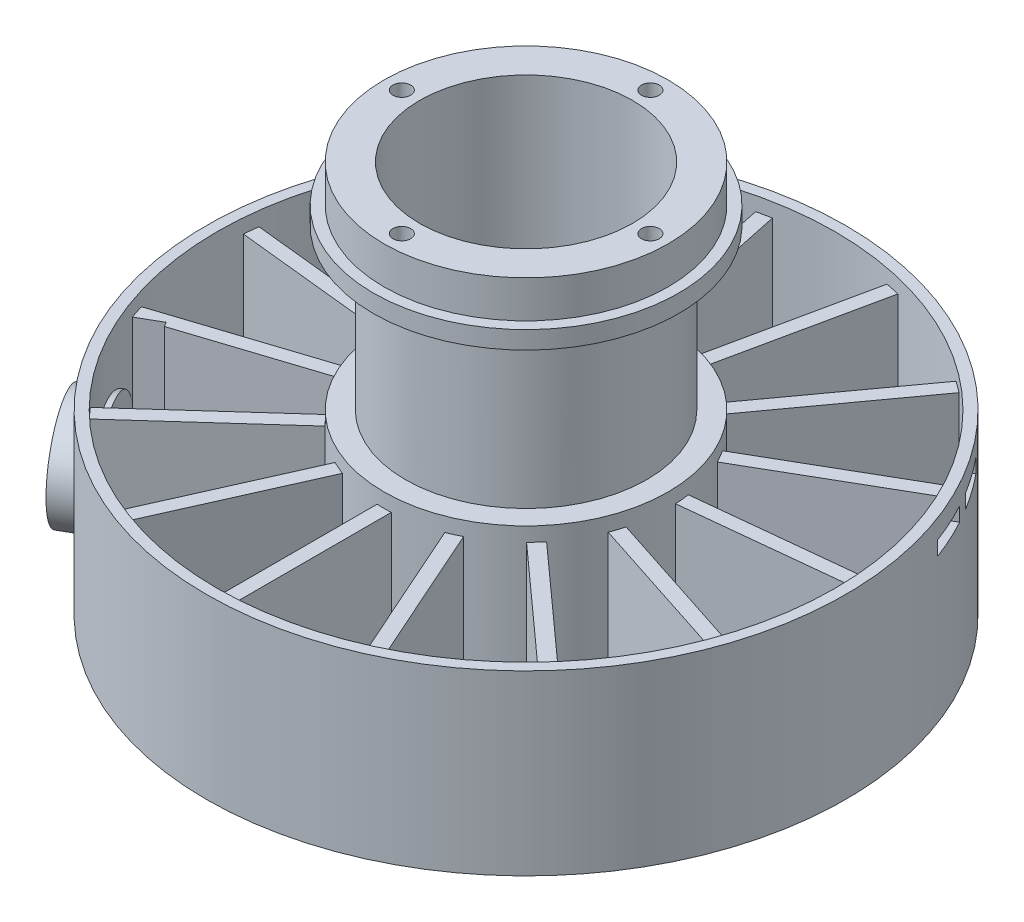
ISO-10303-21;
HEADER;
FILE_DESCRIPTION(('STEP AP214'),'2;1');
FILE_NAME('part.step','',(''),(''),'','','');
FILE_SCHEMA(('AUTOMOTIVE_DESIGN { 1 0 10303 214 1 1 1 1 }'));
ENDSEC;
DATA;
#1=APPLICATION_CONTEXT('core data for automotive mechanical design processes');
#2=APPLICATION_PROTOCOL_DEFINITION('international standard','automotive_design',2000,#1);
#3=PRODUCT_CONTEXT('',#1,'mechanical');
#4=PRODUCT('Part','Part','',(#3));
#5=PRODUCT_RELATED_PRODUCT_CATEGORY('part','',(#4));
#6=PRODUCT_DEFINITION_FORMATION('','',#4);
#7=PRODUCT_DEFINITION_CONTEXT('part definition',#1,'design');
#8=PRODUCT_DEFINITION('design','',#6,#7);
#9=PRODUCT_DEFINITION_SHAPE('','',#8);
#10=(LENGTH_UNIT() NAMED_UNIT(*) SI_UNIT(.MILLI.,.METRE.));
#11=(NAMED_UNIT(*) PLANE_ANGLE_UNIT() SI_UNIT($,.RADIAN.));
#12=(NAMED_UNIT(*) SI_UNIT($,.STERADIAN.) SOLID_ANGLE_UNIT());
#13=UNCERTAINTY_MEASURE_WITH_UNIT(LENGTH_MEASURE(1.E-05),#10,'distance_accuracy_value','');
#14=(GEOMETRIC_REPRESENTATION_CONTEXT(3) GLOBAL_UNCERTAINTY_ASSIGNED_CONTEXT((#13)) GLOBAL_UNIT_ASSIGNED_CONTEXT((#10,
#11,#12)) REPRESENTATION_CONTEXT('',''));
#15=CARTESIAN_POINT('',(0.,0.,0.));
#16=DIRECTION('',(0.,0.,1.));
#17=DIRECTION('',(1.,0.,0.));
#18=AXIS2_PLACEMENT_3D('',#15,#16,#17);
#19=CARTESIAN_POINT('',(0.,50.,0.));
#20=DIRECTION('',(0.,-1.,0.));
#21=DIRECTION('',(0.,0.,-1.));
#22=AXIS2_PLACEMENT_3D('',#19,#20,#21);
#23=CYLINDRICAL_SURFACE('',#22,90.);
#24=DIRECTION('',(0.,-1.,0.));
#25=VECTOR('',#24,1.);
#26=CARTESIAN_POINT('',(76.7929255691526,50.,-46.9344924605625));
#27=LINE('',#26,#25);
#28=CARTESIAN_POINT('',(76.7929255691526,44.625,-46.9344924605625));
#29=VERTEX_POINT('',#28);
#30=CARTESIAN_POINT('',(76.7929255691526,40.625,-46.9344924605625));
#31=VERTEX_POINT('',#30);
#32=EDGE_CURVE('E1510',#29,#31,#27,.T.);
#33=ORIENTED_EDGE('',*,*,#32,.F.);
#34=CARTESIAN_POINT('',(0.,44.625,0.));
#35=DIRECTION('',(0.,-1.,0.));
#36=DIRECTION('',(0.,0.,-1.));
#37=AXIS2_PLACEMENT_3D('',#34,#35,#36);
#38=CIRCLE('',#37,90.);
#39=CARTESIAN_POINT('',(69.5134134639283,44.625,-57.1654209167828));
#40=VERTEX_POINT('',#39);
#41=EDGE_CURVE('E1533',#40,#29,#38,.T.);
#42=ORIENTED_EDGE('',*,*,#41,.F.);
#43=DIRECTION('',(0.,-1.,0.));
#44=VECTOR('',#43,1.);
#45=CARTESIAN_POINT('',(69.5134134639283,50.,-57.1654209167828));
#46=LINE('',#45,#44);
#47=CARTESIAN_POINT('',(69.5134134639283,40.625,-57.1654209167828));
#48=VERTEX_POINT('',#47);
#49=EDGE_CURVE('E1526',#48,#40,#46,.F.);
#50=ORIENTED_EDGE('',*,*,#49,.F.);
#51=CARTESIAN_POINT('',(0.,40.625,0.));
#52=DIRECTION('',(0.,1.,0.));
#53=DIRECTION('',(0.,0.,1.));
#54=AXIS2_PLACEMENT_3D('',#51,#52,#53);
#55=CIRCLE('',#54,90.);
#56=EDGE_CURVE('E1524',#31,#48,#55,.T.);
#57=ORIENTED_EDGE('',*,*,#56,.F.);
#58=EDGE_LOOP('',(#33,#42,#50,#57));
#59=FACE_BOUND('',#58,.T.);
#60=CARTESIAN_POINT('',(0.,50.,0.));
#61=DIRECTION('',(0.,1.,0.));
#62=DIRECTION('',(0.,0.,1.));
#63=AXIS2_PLACEMENT_3D('',#60,#61,#62);
#64=CIRCLE('',#63,90.);
#65=CARTESIAN_POINT('',(0.,50.,90.));
#66=VERTEX_POINT('',#65);
#67=EDGE_CURVE('E1210',#66,#66,#64,.T.);
#68=ORIENTED_EDGE('',*,*,#67,.F.);
#69=EDGE_LOOP('',(#68));
#70=FACE_BOUND('',#69,.T.);
#71=CARTESIAN_POINT('',(0.,0.,0.));
#72=DIRECTION('',(0.,1.,0.));
#73=DIRECTION('',(0.,0.,1.));
#74=AXIS2_PLACEMENT_3D('',#71,#72,#73);
#75=CIRCLE('',#74,90.);
#76=CARTESIAN_POINT('',(0.,0.,90.));
#77=VERTEX_POINT('',#76);
#78=EDGE_CURVE('E1209',#77,#77,#75,.T.);
#79=ORIENTED_EDGE('',*,*,#78,.T.);
#80=EDGE_LOOP('',(#79));
#81=FACE_BOUND('',#80,.T.);
#82=CARTESIAN_POINT('',(0.,44.625,0.));
#83=DIRECTION('',(0.,-1.,0.));
#84=DIRECTION('',(0.,0.,-1.));
#85=AXIS2_PLACEMENT_3D('',#82,#83,#84);
#86=CIRCLE('',#85,90.);
#87=CARTESIAN_POINT('',(79.0429255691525,44.625,-43.0373781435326));
#88=VERTEX_POINT('',#87);
#89=CARTESIAN_POINT('',(84.2634134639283,44.625,-31.6176715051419));
#90=VERTEX_POINT('',#89);
#91=EDGE_CURVE('E1519',#88,#90,#86,.T.);
#92=ORIENTED_EDGE('',*,*,#91,.F.);
#93=DIRECTION('',(0.,-1.,0.));
#94=VECTOR('',#93,1.);
#95=CARTESIAN_POINT('',(79.0429255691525,50.,-43.0373781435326));
#96=LINE('',#95,#94);
#97=CARTESIAN_POINT('',(79.0429255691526,40.625,-43.0373781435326));
#98=VERTEX_POINT('',#97);
#99=EDGE_CURVE('E1521',#98,#88,#96,.F.);
#100=ORIENTED_EDGE('',*,*,#99,.F.);
#101=CARTESIAN_POINT('',(0.,40.625,0.));
#102=DIRECTION('',(0.,1.,0.));
#103=DIRECTION('',(0.,0.,1.));
#104=AXIS2_PLACEMENT_3D('',#101,#102,#103);
#105=CIRCLE('',#104,90.);
#106=CARTESIAN_POINT('',(84.2634134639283,40.625,-31.6176715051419));
#107=VERTEX_POINT('',#106);
#108=EDGE_CURVE('E1528',#107,#98,#105,.T.);
#109=ORIENTED_EDGE('',*,*,#108,.F.);
#110=DIRECTION('',(0.,-1.,0.));
#111=VECTOR('',#110,1.);
#112=CARTESIAN_POINT('',(84.2634134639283,50.,-31.6176715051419));
#113=LINE('',#112,#111);
#114=EDGE_CURVE('E1522',#90,#107,#113,.T.);
#115=ORIENTED_EDGE('',*,*,#114,.F.);
#116=EDGE_LOOP('',(#92,#100,#109,#115));
#117=FACE_BOUND('',#116,.T.);
#118=CARTESIAN_POINT('',(-85.0255810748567,20.0000000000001,29.5067884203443));
#119=CARTESIAN_POINT('',(-85.0255816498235,19.5839299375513,29.5067812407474));
#120=CARTESIAN_POINT('',(-85.0197884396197,19.1679467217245,29.523494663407));
#121=CARTESIAN_POINT('',(-84.9966058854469,18.3388508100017,29.5901726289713));
#122=CARTESIAN_POINT('',(-84.9792142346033,17.9257387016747,29.640143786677));
#123=CARTESIAN_POINT('',(-84.9327867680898,17.1051440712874,29.7729180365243));
#124=CARTESIAN_POINT('',(-84.9037411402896,16.6976665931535,29.855748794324));
#125=CARTESIAN_POINT('',(-84.8339681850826,15.8915974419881,30.0534327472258));
#126=CARTESIAN_POINT('',(-84.7932414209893,15.4930053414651,30.1682843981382));
#127=CARTESIAN_POINT('',(-84.7001012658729,14.7078541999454,30.4288012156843));
#128=CARTESIAN_POINT('',(-84.6476989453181,14.321284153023,30.5744371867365));
#129=CARTESIAN_POINT('',(-84.5311348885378,13.5624377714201,30.8952478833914));
#130=CARTESIAN_POINT('',(-84.4669730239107,13.1901615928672,31.0704229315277));
#131=CARTESIAN_POINT('',(-84.3268555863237,12.4624727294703,31.4487215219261));
#132=CARTESIAN_POINT('',(-84.2509014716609,12.1070579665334,31.6518416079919));
#133=CARTESIAN_POINT('',(-84.0871688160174,11.4154144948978,32.0842870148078));
#134=CARTESIAN_POINT('',(-83.9993901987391,11.0791859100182,32.313612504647));
#135=CARTESIAN_POINT('',(-83.8109803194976,10.4245439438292,32.7992092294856));
#136=CARTESIAN_POINT('',(-83.7102178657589,10.1063682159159,33.0557499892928));
#137=CARTESIAN_POINT('',(-83.4966696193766,9.49404878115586,33.5915063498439));
#138=CARTESIAN_POINT('',(-83.383883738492,9.19990525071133,33.8707221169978));
#139=CARTESIAN_POINT('',(-83.1464051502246,8.63762125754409,34.449574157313));
#140=CARTESIAN_POINT('',(-83.0217115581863,8.36948272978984,34.7492119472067));
#141=CARTESIAN_POINT('',(-82.7606379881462,7.86106908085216,35.3664965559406));
#142=CARTESIAN_POINT('',(-82.6242579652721,7.6207940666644,35.6841434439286));
#143=CARTESIAN_POINT('',(-82.3387862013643,7.16764495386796,36.3380341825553));
#144=CARTESIAN_POINT('',(-82.18958630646,6.95505190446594,36.6744256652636));
#145=CARTESIAN_POINT('',(-81.8800675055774,6.56151167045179,37.3603546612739));
#146=CARTESIAN_POINT('',(-81.7197485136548,6.38056473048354,37.7098922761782));
#147=CARTESIAN_POINT('',(-81.3886143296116,6.05167709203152,38.4193528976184));
#148=CARTESIAN_POINT('',(-81.2177995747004,5.90373501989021,38.7792754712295));
#149=CARTESIAN_POINT('',(-80.8664513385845,5.64198840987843,39.5067105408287));
#150=CARTESIAN_POINT('',(-80.6859179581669,5.52818351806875,39.874222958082));
#151=CARTESIAN_POINT('',(-80.3176502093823,5.3364259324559,40.6108753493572));
#152=CARTESIAN_POINT('',(-80.1299892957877,5.25817935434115,40.979975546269));
#153=CARTESIAN_POINT('',(-79.7471669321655,5.13677315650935,41.7200541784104));
#154=CARTESIAN_POINT('',(-79.5520055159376,5.09361337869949,42.0910326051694));
#155=CARTESIAN_POINT('',(-79.1554810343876,5.04275275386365,42.8320721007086));
#156=CARTESIAN_POINT('',(-78.9541184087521,5.03504939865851,43.202133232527));
#157=CARTESIAN_POINT('',(-78.5466268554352,5.05518919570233,43.9386450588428));
#158=CARTESIAN_POINT('',(-78.3404979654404,5.08303206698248,44.3050957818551));
#159=CARTESIAN_POINT('',(-77.9276465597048,5.17351092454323,45.0272445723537));
#160=CARTESIAN_POINT('',(-77.7209630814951,5.23571130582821,45.3830196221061));
#161=CARTESIAN_POINT('',(-77.3061624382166,5.39415023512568,46.0860481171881));
#162=CARTESIAN_POINT('',(-77.0980452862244,5.49038847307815,46.4333016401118));
#163=CARTESIAN_POINT('',(-76.6821306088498,5.7161999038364,47.116992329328));
#164=CARTESIAN_POINT('',(-76.4743330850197,5.84577325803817,47.4534294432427));
#165=CARTESIAN_POINT('',(-76.0608851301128,6.13730910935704,48.1133388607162));
#166=CARTESIAN_POINT('',(-75.8552347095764,6.29927176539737,48.4368111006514));
#167=CARTESIAN_POINT('',(-75.4477084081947,6.65463110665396,49.0691856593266));
#168=CARTESIAN_POINT('',(-75.2458374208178,6.84806577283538,49.3780697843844));
#169=CARTESIAN_POINT('',(-74.8480305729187,7.26484666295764,49.9790174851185));
#170=CARTESIAN_POINT('',(-74.6520947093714,7.48819287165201,50.2710810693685));
#171=CARTESIAN_POINT('',(-74.2680467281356,7.96324001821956,50.8367399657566));
#172=CARTESIAN_POINT('',(-74.079935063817,8.21494259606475,51.1103342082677));
#173=CARTESIAN_POINT('',(-73.7134210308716,8.74494837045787,51.6375314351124));
#174=CARTESIAN_POINT('',(-73.5350187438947,9.0232517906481,51.8911342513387));
#175=CARTESIAN_POINT('',(-73.1878677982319,9.60772288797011,52.3796410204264));
#176=CARTESIAN_POINT('',(-73.0192454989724,9.91416112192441,52.6143111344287));
#177=CARTESIAN_POINT('',(-72.6956013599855,10.5501479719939,53.0605837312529));
#178=CARTESIAN_POINT('',(-72.5405796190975,10.879696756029,53.2721860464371));
#179=CARTESIAN_POINT('',(-72.2458462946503,11.5596317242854,53.6712142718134));
#180=CARTESIAN_POINT('',(-72.106135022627,11.9100183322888,53.8586396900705));
#181=CARTESIAN_POINT('',(-71.8436127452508,12.6291956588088,54.2083308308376));
#182=CARTESIAN_POINT('',(-71.7208017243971,12.9979863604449,54.3705965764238));
#183=CARTESIAN_POINT('',(-71.4931552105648,13.7525878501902,54.6695911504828));
#184=CARTESIAN_POINT('',(-71.3883772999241,14.1384483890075,54.8062382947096));
#185=CARTESIAN_POINT('',(-71.1985300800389,14.9233814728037,55.052643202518));
#186=CARTESIAN_POINT('',(-71.1134608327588,15.3224540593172,55.1624008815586));
#187=CARTESIAN_POINT('',(-70.9640827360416,16.1309410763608,55.3544377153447));
#188=CARTESIAN_POINT('',(-70.8997727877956,16.5403549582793,55.436718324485));
#189=CARTESIAN_POINT('',(-70.7927146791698,17.3665925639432,55.5733667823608));
#190=CARTESIAN_POINT('',(-70.7499663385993,17.7834162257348,55.6277348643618));
#191=CARTESIAN_POINT('',(-70.6868466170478,18.617849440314,55.7079195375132));
#192=CARTESIAN_POINT('',(-70.6662864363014,19.0354215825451,55.7339770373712));
#193=CARTESIAN_POINT('',(-70.6471523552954,19.8718758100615,55.7582290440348));
#194=CARTESIAN_POINT('',(-70.6485783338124,20.2907578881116,55.7564237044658));
#195=CARTESIAN_POINT('',(-70.673398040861,21.1268090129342,55.7249603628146));
#196=CARTESIAN_POINT('',(-70.6967911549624,21.5439781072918,55.6953031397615));
#197=CARTESIAN_POINT('',(-70.7652493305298,22.3736224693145,55.6082956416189));
#198=CARTESIAN_POINT('',(-70.8103143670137,22.7860977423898,55.550945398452));
#199=CARTESIAN_POINT('',(-70.9212729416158,23.6013529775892,55.4092148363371));
#200=CARTESIAN_POINT('',(-70.9870605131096,24.0041712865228,55.3249720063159));
#201=CARTESIAN_POINT('',(-71.1387302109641,24.7994258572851,55.1298133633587));
#202=CARTESIAN_POINT('',(-71.224612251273,25.1918621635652,55.0188976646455));
#203=CARTESIAN_POINT('',(-71.4154482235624,25.9636479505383,54.7709613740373));
#204=CARTESIAN_POINT('',(-71.5204029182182,26.3429969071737,54.6339397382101));
#205=CARTESIAN_POINT('',(-71.7481558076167,27.0859882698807,54.3344964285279));
#206=CARTESIAN_POINT('',(-71.8709541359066,27.4496305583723,54.1720745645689));
#207=CARTESIAN_POINT('',(-72.1339378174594,28.1612806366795,53.8214025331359));
#208=CARTESIAN_POINT('',(-72.274241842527,28.5091572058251,53.6329750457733));
#209=CARTESIAN_POINT('',(-72.5699526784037,29.1840700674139,53.2321704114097));
#210=CARTESIAN_POINT('',(-72.7253595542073,29.5111062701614,53.0197931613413));
#211=CARTESIAN_POINT('',(-73.0495816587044,30.1421056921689,52.5721881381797));
#212=CARTESIAN_POINT('',(-73.218397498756,30.4460678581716,52.3369593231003));
#213=CARTESIAN_POINT('',(-73.5676326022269,31.0288065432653,51.8449074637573));
#214=CARTESIAN_POINT('',(-73.7480519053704,31.3075829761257,51.5880843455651));
#215=CARTESIAN_POINT('',(-74.119935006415,31.8398886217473,51.0523484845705));
#216=CARTESIAN_POINT('',(-74.3114679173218,32.0932252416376,50.7732923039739));
#217=CARTESIAN_POINT('',(-74.7024439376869,32.5705784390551,50.1962777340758));
#218=CARTESIAN_POINT('',(-74.9018870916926,32.7945948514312,49.8983192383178));
#219=CARTESIAN_POINT('',(-75.3066895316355,33.2116749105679,49.2852656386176));
#220=CARTESIAN_POINT('',(-75.512048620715,33.4047395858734,48.9701711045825));
#221=CARTESIAN_POINT('',(-75.9267011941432,33.7585012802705,48.3247673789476));
#222=CARTESIAN_POINT('',(-76.1359946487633,33.9191985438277,47.9944583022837));
#223=CARTESIAN_POINT('',(-76.5553334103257,34.2061895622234,47.3226877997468));
#224=CARTESIAN_POINT('',(-76.7653672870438,34.3326777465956,46.9813023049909));
#225=CARTESIAN_POINT('',(-77.1855116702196,34.5515334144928,46.2878076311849));
#226=CARTESIAN_POINT('',(-77.395622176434,34.6439010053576,45.935698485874));
#227=CARTESIAN_POINT('',(-77.8141108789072,34.7938225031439,45.2231670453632));
#228=CARTESIAN_POINT('',(-78.0224891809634,34.8513785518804,44.8627452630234));
#229=CARTESIAN_POINT('',(-78.4358351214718,34.9312657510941,44.13609043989));
#230=CARTESIAN_POINT('',(-78.6408027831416,34.9535971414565,43.7698574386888));
#231=CARTESIAN_POINT('',(-79.0436894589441,34.9628458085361,43.0379816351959));
#232=CARTESIAN_POINT('',(-79.241659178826,34.9501236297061,42.6723712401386));
#233=CARTESIAN_POINT('',(-79.6313566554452,34.8901646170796,41.9406587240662));
#234=CARTESIAN_POINT('',(-79.8230844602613,34.8429280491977,41.5745566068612));
#235=CARTESIAN_POINT('',(-80.1990858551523,34.7143309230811,40.8445249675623));
#236=CARTESIAN_POINT('',(-80.3833594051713,34.6329701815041,40.480595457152));
#237=CARTESIAN_POINT('',(-80.743402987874,34.4367642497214,39.7575902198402));
#238=CARTESIAN_POINT('',(-80.9191729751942,34.3219188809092,39.3985145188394));
#239=CARTESIAN_POINT('',(-81.2617112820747,34.0593202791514,38.6870845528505));
#240=CARTESIAN_POINT('',(-81.4284584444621,33.9114935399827,38.3347472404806));
#241=CARTESIAN_POINT('',(-81.7517980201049,33.584173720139,37.6402743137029));
#242=CARTESIAN_POINT('',(-81.9083904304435,33.4046806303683,37.2981387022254));
#243=CARTESIAN_POINT('',(-82.2108564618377,33.015307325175,36.62663928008));
#244=CARTESIAN_POINT('',(-82.3567295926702,32.8054257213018,36.2972760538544));
#245=CARTESIAN_POINT('',(-82.6373184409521,32.356747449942,35.6538470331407));
#246=CARTESIAN_POINT('',(-82.7720340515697,32.1179505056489,35.3397813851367));
#247=CARTESIAN_POINT('',(-83.0317209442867,31.6096998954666,34.7252944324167));
#248=CARTESIAN_POINT('',(-83.1565381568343,31.3398795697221,34.425111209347));
#249=CARTESIAN_POINT('',(-83.3941845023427,30.7740783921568,33.8453566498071));
#250=CARTESIAN_POINT('',(-83.5070134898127,30.4780972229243,33.5657855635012));
#251=CARTESIAN_POINT('',(-83.7205834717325,29.8619203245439,33.0294906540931));
#252=CARTESIAN_POINT('',(-83.8213216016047,29.5417188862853,32.7727722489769));
#253=CARTESIAN_POINT('',(-84.0106217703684,28.8793437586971,32.2844240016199));
#254=CARTESIAN_POINT('',(-84.0991839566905,28.5371703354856,32.052793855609));
#255=CARTESIAN_POINT('',(-84.2646034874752,27.8311499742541,31.615369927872));
#256=CARTESIAN_POINT('',(-84.3413905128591,27.4671896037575,31.409732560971));
#257=CARTESIAN_POINT('',(-84.4826710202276,26.7219372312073,31.0277261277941));
#258=CARTESIAN_POINT('',(-84.5471645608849,26.3406453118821,30.8513569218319));
#259=CARTESIAN_POINT('',(-84.6638536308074,25.563758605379,30.5296769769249));
#260=CARTESIAN_POINT('',(-84.7160603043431,25.1681771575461,30.384338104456));
#261=CARTESIAN_POINT('',(-84.8082905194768,24.3653657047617,30.125945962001));
#262=CARTESIAN_POINT('',(-84.8483167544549,23.9581382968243,30.0128855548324));
#263=CARTESIAN_POINT('',(-84.9300921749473,22.967154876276,29.7808752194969));
#264=CARTESIAN_POINT('',(-84.9659142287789,22.3789988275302,29.6782512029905));
#265=CARTESIAN_POINT('',(-85.0136579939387,21.1938354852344,29.5412137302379));
#266=CARTESIAN_POINT('',(-85.0255802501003,20.5968283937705,29.50679871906));
#267=CARTESIAN_POINT('',(-85.0255810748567,20.0000000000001,29.5067884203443));
#268=B_SPLINE_CURVE_WITH_KNOTS('',3,(#118,#119,#120,#121,#122,#123,#124,#125,#126,#127,#128,
#129,#130,#131,#132,#133,#134,#135,#136,#137,#138,#139,#140,#141,#142,#143,#144,#145,#146,#147,
#148,#149,#150,#151,#152,#153,#154,#155,#156,#157,#158,#159,#160,#161,#162,#163,#164,#165,#166,
#167,#168,#169,#170,#171,#172,#173,#174,#175,#176,#177,#178,#179,#180,#181,#182,#183,#184,#185,
#186,#187,#188,#189,#190,#191,#192,#193,#194,#195,#196,#197,#198,#199,#200,#201,#202,#203,#204,
#205,#206,#207,#208,#209,#210,#211,#212,#213,#214,#215,#216,#217,#218,#219,#220,#221,#222,#223,
#224,#225,#226,#227,#228,#229,#230,#231,#232,#233,#234,#235,#236,#237,#238,#239,#240,#241,#242,
#243,#244,#245,#246,#247,#248,#249,#250,#251,#252,#253,#254,#255,#256,#257,#258,#259,#260,#261,
#262,#263,#264,#265,#266,#267),.UNSPECIFIED.,.T.,.F.,(4,2,2,2,2,2,2,2,2,2,2,2,2,2,2,2,2,2,2,2,2,
2,2,2,2,2,2,2,2,2,2,2,2,2,2,2,2,2,2,2,2,2,2,2,2,2,2,2,2,2,2,2,2,2,2,2,2,2,2,2,2,2,2,2,2,2,2,2,2,
2,2,2,2,2,4),(0.,1.2476851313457,2.49561849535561,3.74460477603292,4.9935308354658,
6.24127769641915,7.48903818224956,8.73664448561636,9.98425883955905,11.2456465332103,
12.5070434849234,13.7685342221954,15.0300298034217,16.3034723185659,17.5769246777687,
18.8503240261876,20.1237101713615,21.3863715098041,22.6490271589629,23.9115934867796,
25.1741498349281,26.4210544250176,27.6679476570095,28.9148469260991,30.1617523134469,
31.4101738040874,32.6585946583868,33.907087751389,35.1555913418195,36.4176979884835,
37.6798138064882,38.9419553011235,40.2040956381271,41.4701942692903,42.7362968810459,
44.0023324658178,45.2683574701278,46.5235227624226,47.7786811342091,49.0338043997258,
50.2889262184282,51.5377312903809,52.7865310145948,54.0353806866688,55.2842397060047,
56.5420786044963,57.7999229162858,59.0578246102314,60.3157306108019,61.5825369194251,
62.8493503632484,64.1161217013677,65.3828834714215,66.6422865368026,67.9016856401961,
69.1610072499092,70.4203202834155,71.6667291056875,72.9131283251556,74.1595342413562,
75.4059468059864,76.6551655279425,77.9043846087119,79.1536607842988,80.402948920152,
81.6689125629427,82.9348915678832,84.2011699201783,85.4674329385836,86.740985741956,
88.0145324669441,89.2869195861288,90.5590251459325,92.3487979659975,94.138529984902),.UNSPECIFIED.);
#269=CARTESIAN_POINT('',(-85.0255810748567,20.0000000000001,29.5067884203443));
#270=VERTEX_POINT('',#269);
#271=EDGE_CURVE('E556',#270,#270,#268,.T.);
#272=ORIENTED_EDGE('',*,*,#271,.F.);
#273=EDGE_LOOP('',(#272));
#274=FACE_BOUND('',#273,.T.);
#275=ADVANCED_FACE('F548',(#59,#70,#81,#117,#274),#23,.T.);
#276=CARTESIAN_POINT('',(0.,304.558441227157,0.));
#277=DIRECTION('',(0.,-1.,0.));
#278=DIRECTION('',(0.,0.,-1.));
#279=AXIS2_PLACEMENT_3D('',#276,#277,#278);
#280=CYLINDRICAL_SURFACE('',#279,87.);
#281=CARTESIAN_POINT('',(0.,0.,0.));
#282=DIRECTION('',(0.,-1.,0.));
#283=DIRECTION('',(0.,0.,-1.));
#284=AXIS2_PLACEMENT_3D('',#281,#282,#283);
#285=CIRCLE('',#284,87.);
#286=CARTESIAN_POINT('',(0.,0.,-87.));
#287=VERTEX_POINT('',#286);
#288=EDGE_CURVE('E1057',#287,#287,#285,.T.);
#289=ORIENTED_EDGE('',*,*,#288,.T.);
#290=EDGE_LOOP('',(#289));
#291=FACE_BOUND('',#290,.T.);
#292=DIRECTION('',(0.,-1.,0.));
#293=VECTOR('',#292,1.);
#294=CARTESIAN_POINT('',(74.1940090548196,304.558441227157,-45.434007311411));
#295=LINE('',#294,#293);
#296=CARTESIAN_POINT('',(74.1940090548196,40.625,-45.434007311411));
#297=VERTEX_POINT('',#296);
#298=CARTESIAN_POINT('',(74.1940090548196,44.625,-45.434007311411));
#299=VERTEX_POINT('',#298);
#300=EDGE_CURVE('E1251',#297,#299,#295,.F.);
#301=ORIENTED_EDGE('',*,*,#300,.F.);
#302=CARTESIAN_POINT('',(0.,40.625,0.));
#303=DIRECTION('',(0.,1.,0.));
#304=DIRECTION('',(0.,0.,1.));
#305=AXIS2_PLACEMENT_3D('',#302,#303,#304);
#306=CIRCLE('',#305,87.);
#307=CARTESIAN_POINT('',(66.8784721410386,40.625,-55.6441368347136));
#308=VERTEX_POINT('',#307);
#309=EDGE_CURVE('E1245',#308,#297,#306,.F.);
#310=ORIENTED_EDGE('',*,*,#309,.F.);
#311=DIRECTION('',(0.,-1.,0.));
#312=VECTOR('',#311,1.);
#313=CARTESIAN_POINT('',(66.8784721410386,304.558441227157,-55.6441368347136));
#314=LINE('',#313,#312);
#315=CARTESIAN_POINT('',(66.8784721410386,44.625,-55.6441368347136));
#316=VERTEX_POINT('',#315);
#317=EDGE_CURVE('E1247',#316,#308,#314,.T.);
#318=ORIENTED_EDGE('',*,*,#317,.F.);
#319=CARTESIAN_POINT('',(0.,44.625,0.));
#320=DIRECTION('',(0.,-1.,0.));
#321=DIRECTION('',(0.,0.,-1.));
#322=AXIS2_PLACEMENT_3D('',#319,#320,#321);
#323=CIRCLE('',#322,87.);
#324=EDGE_CURVE('E1250',#299,#316,#323,.F.);
#325=ORIENTED_EDGE('',*,*,#324,.F.);
#326=EDGE_LOOP('',(#301,#310,#318,#325));
#327=FACE_BOUND('',#326,.T.);
#328=CARTESIAN_POINT('',(0.,50.,0.));
#329=DIRECTION('',(0.,1.,0.));
#330=DIRECTION('',(0.,0.,1.));
#331=AXIS2_PLACEMENT_3D('',#328,#329,#330);
#332=CIRCLE('',#331,87.);
#333=CARTESIAN_POINT('',(0.,50.,87.));
#334=VERTEX_POINT('',#333);
#335=EDGE_CURVE('E1060',#334,#334,#332,.F.);
#336=ORIENTED_EDGE('',*,*,#335,.F.);
#337=EDGE_LOOP('',(#336));
#338=FACE_BOUND('',#337,.T.);
#339=CARTESIAN_POINT('',(0.,4.,0.));
#340=DIRECTION('',(0.,-1.,0.));
#341=DIRECTION('',(0.,0.,-1.));
#342=AXIS2_PLACEMENT_3D('',#339,#340,#341);
#343=CIRCLE('',#342,87.);
#344=CARTESIAN_POINT('',(65.9747749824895,4.,56.7126887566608));
#345=VERTEX_POINT('',#344);
#346=CARTESIAN_POINT('',(63.2982525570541,4.,59.6852680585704));
#347=VERTEX_POINT('',#346);
#348=EDGE_CURVE('E1892',#345,#347,#343,.T.);
#349=ORIENTED_EDGE('',*,*,#348,.F.);
#350=DIRECTION('',(0.,-1.,0.));
#351=VECTOR('',#350,1.);
#352=CARTESIAN_POINT('',(65.9747749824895,304.558441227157,56.7126887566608));
#353=LINE('',#352,#351);
#354=CARTESIAN_POINT('',(65.9747749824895,46.,56.7126887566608));
#355=VERTEX_POINT('',#354);
#356=EDGE_CURVE('E1067',#355,#345,#353,.T.);
#357=ORIENTED_EDGE('',*,*,#356,.F.);
#358=CARTESIAN_POINT('',(0.,46.,0.));
#359=DIRECTION('',(0.,1.,0.));
#360=DIRECTION('',(0.,0.,1.));
#361=AXIS2_PLACEMENT_3D('',#358,#359,#360);
#362=CIRCLE('',#361,87.);
#363=CARTESIAN_POINT('',(63.2982525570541,46.,59.6852680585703));
#364=VERTEX_POINT('',#363);
#365=EDGE_CURVE('E1859',#364,#355,#362,.T.);
#366=ORIENTED_EDGE('',*,*,#365,.F.);
#367=DIRECTION('',(0.,-1.,0.));
#368=VECTOR('',#367,1.);
#369=CARTESIAN_POINT('',(63.2982525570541,304.558441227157,59.6852680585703));
#370=LINE('',#369,#368);
#371=EDGE_CURVE('E1065',#347,#364,#370,.F.);
#372=ORIENTED_EDGE('',*,*,#371,.F.);
#373=EDGE_LOOP('',(#349,#357,#366,#372));
#374=FACE_BOUND('',#373,.T.);
#375=DIRECTION('',(0.,-1.,0.));
#376=VECTOR('',#375,1.);
#377=CARTESIAN_POINT('',(-16.1272416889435,304.558441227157,-85.4921755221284));
#378=LINE('',#377,#376);
#379=CARTESIAN_POINT('',(-16.1272416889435,4.,-85.4921755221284));
#380=VERTEX_POINT('',#379);
#381=CARTESIAN_POINT('',(-16.1272416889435,46.,-85.4921755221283));
#382=VERTEX_POINT('',#381);
#383=EDGE_CURVE('E1063',#380,#382,#378,.F.);
#384=ORIENTED_EDGE('',*,*,#383,.F.);
#385=CARTESIAN_POINT('',(-20.0398320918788,4.,-84.6605287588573));
#386=VERTEX_POINT('',#385);
#387=EDGE_CURVE('E1572',#386,#380,#343,.T.);
#388=ORIENTED_EDGE('',*,*,#387,.F.);
#389=DIRECTION('',(0.,-1.,0.));
#390=VECTOR('',#389,1.);
#391=CARTESIAN_POINT('',(-20.0398320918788,304.558441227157,-84.6605287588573));
#392=LINE('',#391,#390);
#393=CARTESIAN_POINT('',(-20.0398320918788,46.,-84.6605287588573));
#394=VERTEX_POINT('',#393);
#395=EDGE_CURVE('E1233',#394,#386,#392,.T.);
#396=ORIENTED_EDGE('',*,*,#395,.F.);
#397=EDGE_CURVE('E1772',#382,#394,#362,.T.);
#398=ORIENTED_EDGE('',*,*,#397,.F.);
#399=EDGE_LOOP('',(#384,#388,#396,#398));
#400=FACE_BOUND('',#399,.T.);
#401=CARTESIAN_POINT('',(83.3380846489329,4.,24.975260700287));
#402=VERTEX_POINT('',#401);
#403=CARTESIAN_POINT('',(82.1020166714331,4.,28.7794867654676));
#404=VERTEX_POINT('',#403);
#405=EDGE_CURVE('E1890',#402,#404,#343,.T.);
#406=ORIENTED_EDGE('',*,*,#405,.F.);
#407=DIRECTION('',(0.,-1.,0.));
#408=VECTOR('',#407,1.);
#409=CARTESIAN_POINT('',(83.3380846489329,304.558441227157,24.975260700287));
#410=LINE('',#409,#408);
#411=CARTESIAN_POINT('',(83.3380846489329,46.,24.975260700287));
#412=VERTEX_POINT('',#411);
#413=EDGE_CURVE('E1072',#412,#402,#410,.T.);
#414=ORIENTED_EDGE('',*,*,#413,.F.);
#415=CARTESIAN_POINT('',(82.1020166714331,46.,28.7794867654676));
#416=VERTEX_POINT('',#415);
#417=EDGE_CURVE('E1860',#416,#412,#362,.T.);
#418=ORIENTED_EDGE('',*,*,#417,.F.);
#419=DIRECTION('',(0.,-1.,0.));
#420=VECTOR('',#419,1.);
#421=CARTESIAN_POINT('',(82.1020166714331,304.558441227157,28.7794867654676));
#422=LINE('',#421,#420);
#423=EDGE_CURVE('E1070',#404,#416,#422,.F.);
#424=ORIENTED_EDGE('',*,*,#423,.F.);
#425=EDGE_LOOP('',(#406,#414,#418,#424));
#426=FACE_BOUND('',#425,.T.);
#427=CARTESIAN_POINT('',(37.2038273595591,4.,78.6439777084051));
#428=VERTEX_POINT('',#427);
#429=CARTESIAN_POINT('',(33.5496455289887,4.,80.2709242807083));
#430=VERTEX_POINT('',#429);
#431=EDGE_CURVE('E1752',#428,#430,#343,.T.);
#432=ORIENTED_EDGE('',*,*,#431,.F.);
#433=DIRECTION('',(0.,-1.,0.));
#434=VECTOR('',#433,1.);
#435=CARTESIAN_POINT('',(37.2038273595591,304.558441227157,78.6439777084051));
#436=LINE('',#435,#434);
#437=CARTESIAN_POINT('',(37.2038273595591,46.,78.6439777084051));
#438=VERTEX_POINT('',#437);
#439=EDGE_CURVE('E1077',#438,#428,#436,.T.);
#440=ORIENTED_EDGE('',*,*,#439,.F.);
#441=CARTESIAN_POINT('',(33.5496455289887,46.,80.2709242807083));
#442=VERTEX_POINT('',#441);
#443=EDGE_CURVE('E1693',#442,#438,#362,.T.);
#444=ORIENTED_EDGE('',*,*,#443,.F.);
#445=DIRECTION('',(0.,-1.,0.));
#446=VECTOR('',#445,1.);
#447=CARTESIAN_POINT('',(33.5496455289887,304.558441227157,80.2709242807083));
#448=LINE('',#447,#446);
#449=EDGE_CURVE('E1075',#430,#442,#448,.F.);
#450=ORIENTED_EDGE('',*,*,#449,.F.);
#451=EDGE_LOOP('',(#432,#440,#444,#450));
#452=FACE_BOUND('',#451,.T.);
#453=CARTESIAN_POINT('',(86.2914823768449,4.,-11.0806168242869));
#454=VERTEX_POINT('',#453);
#455=CARTESIAN_POINT('',(86.7095962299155,4.,-7.10252924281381));
#456=VERTEX_POINT('',#455);
#457=EDGE_CURVE('E1888',#454,#456,#343,.T.);
#458=ORIENTED_EDGE('',*,*,#457,.F.);
#459=DIRECTION('',(0.,-1.,0.));
#460=VECTOR('',#459,1.);
#461=CARTESIAN_POINT('',(86.2914823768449,304.558441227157,-11.0806168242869));
#462=LINE('',#461,#460);
#463=CARTESIAN_POINT('',(86.2914823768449,46.,-11.0806168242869));
#464=VERTEX_POINT('',#463);
#465=EDGE_CURVE('E1082',#464,#454,#462,.T.);
#466=ORIENTED_EDGE('',*,*,#465,.F.);
#467=CARTESIAN_POINT('',(86.7095962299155,46.,-7.10252924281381));
#468=VERTEX_POINT('',#467);
#469=EDGE_CURVE('E1864',#468,#464,#362,.T.);
#470=ORIENTED_EDGE('',*,*,#469,.F.);
#471=DIRECTION('',(0.,-1.,0.));
#472=VECTOR('',#471,1.);
#473=CARTESIAN_POINT('',(86.7095962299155,304.558441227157,-7.10252924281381));
#474=LINE('',#473,#472);
#475=EDGE_CURVE('E1080',#456,#468,#474,.F.);
#476=ORIENTED_EDGE('',*,*,#475,.F.);
#477=EDGE_LOOP('',(#458,#466,#470,#476));
#478=FACE_BOUND('',#477,.T.);
#479=CARTESIAN_POINT('',(74.3242988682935,4.,-45.2205550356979));
#480=VERTEX_POINT('',#479);
#481=CARTESIAN_POINT('',(76.3242988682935,4.,-41.7564534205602));
#482=VERTEX_POINT('',#481);
#483=EDGE_CURVE('E1887',#480,#482,#343,.T.);
#484=ORIENTED_EDGE('',*,*,#483,.F.);
#485=DIRECTION('',(0.,-1.,0.));
#486=VECTOR('',#485,1.);
#487=CARTESIAN_POINT('',(74.3242988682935,304.558441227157,-45.2205550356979));
#488=LINE('',#487,#486);
#489=CARTESIAN_POINT('',(74.3242988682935,46.,-45.2205550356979));
#490=VERTEX_POINT('',#489);
#491=EDGE_CURVE('E1087',#490,#480,#488,.T.);
#492=ORIENTED_EDGE('',*,*,#491,.F.);
#493=CARTESIAN_POINT('',(76.3242988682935,46.,-41.7564534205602));
#494=VERTEX_POINT('',#493);
#495=EDGE_CURVE('E1868',#494,#490,#362,.T.);
#496=ORIENTED_EDGE('',*,*,#495,.F.);
#497=DIRECTION('',(0.,-1.,0.));
#498=VECTOR('',#497,1.);
#499=CARTESIAN_POINT('',(76.3242988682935,304.558441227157,-41.7564534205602));
#500=LINE('',#499,#498);
#501=EDGE_CURVE('E1085',#482,#494,#500,.F.);
#502=ORIENTED_EDGE('',*,*,#501,.F.);
#503=EDGE_LOOP('',(#484,#492,#496,#502));
#504=FACE_BOUND('',#503,.T.);
#505=CARTESIAN_POINT('',(-63.2982525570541,4.,59.6852680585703));
#506=VERTEX_POINT('',#505);
#507=CARTESIAN_POINT('',(-65.9747749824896,4.,56.7126887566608));
#508=VERTEX_POINT('',#507);
#509=EDGE_CURVE('E1751',#506,#508,#343,.T.);
#510=ORIENTED_EDGE('',*,*,#509,.F.);
#511=DIRECTION('',(0.,-1.,0.));
#512=VECTOR('',#511,1.);
#513=CARTESIAN_POINT('',(-63.2982525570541,304.558441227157,59.6852680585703));
#514=LINE('',#513,#512);
#515=CARTESIAN_POINT('',(-63.2982525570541,46.,59.6852680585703));
#516=VERTEX_POINT('',#515);
#517=EDGE_CURVE('E1092',#516,#506,#514,.T.);
#518=ORIENTED_EDGE('',*,*,#517,.F.);
#519=CARTESIAN_POINT('',(-65.9747749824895,46.,56.7126887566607));
#520=VERTEX_POINT('',#519);
#521=EDGE_CURVE('E1788',#520,#516,#362,.T.);
#522=ORIENTED_EDGE('',*,*,#521,.F.);
#523=DIRECTION('',(0.,-1.,0.));
#524=VECTOR('',#523,1.);
#525=CARTESIAN_POINT('',(-65.9747749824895,304.558441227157,56.7126887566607));
#526=LINE('',#525,#524);
#527=EDGE_CURVE('E1090',#508,#520,#526,.F.);
#528=ORIENTED_EDGE('',*,*,#527,.F.);
#529=EDGE_LOOP('',(#510,#518,#522,#528));
#530=FACE_BOUND('',#529,.T.);
#531=CARTESIAN_POINT('',(-33.5496455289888,4.,80.2709242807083));
#532=VERTEX_POINT('',#531);
#533=CARTESIAN_POINT('',(-37.2038273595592,4.,78.6439777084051));
#534=VERTEX_POINT('',#533);
#535=EDGE_CURVE('E1749',#532,#534,#343,.T.);
#536=ORIENTED_EDGE('',*,*,#535,.F.);
#537=DIRECTION('',(0.,-1.,0.));
#538=VECTOR('',#537,1.);
#539=CARTESIAN_POINT('',(-33.5496455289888,304.558441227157,80.2709242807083));
#540=LINE('',#539,#538);
#541=CARTESIAN_POINT('',(-33.5496455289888,46.,80.2709242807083));
#542=VERTEX_POINT('',#541);
#543=EDGE_CURVE('E1097',#542,#532,#540,.T.);
#544=ORIENTED_EDGE('',*,*,#543,.F.);
#545=CARTESIAN_POINT('',(-37.2038273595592,46.,78.6439777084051));
#546=VERTEX_POINT('',#545);
#547=EDGE_CURVE('E1692',#546,#542,#362,.T.);
#548=ORIENTED_EDGE('',*,*,#547,.F.);
#549=DIRECTION('',(0.,-1.,0.));
#550=VECTOR('',#549,1.);
#551=CARTESIAN_POINT('',(-37.2038273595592,304.558441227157,78.6439777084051));
#552=LINE('',#551,#550);
#553=EDGE_CURVE('E1095',#534,#546,#552,.F.);
#554=ORIENTED_EDGE('',*,*,#553,.F.);
#555=EDGE_LOOP('',(#536,#544,#548,#554));
#556=FACE_BOUND('',#555,.T.);
#557=CARTESIAN_POINT('',(2.,4.,86.9770084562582));
#558=VERTEX_POINT('',#557);
#559=CARTESIAN_POINT('',(-2.,4.,86.9770084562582));
#560=VERTEX_POINT('',#559);
#561=EDGE_CURVE('E1750',#558,#560,#343,.T.);
#562=ORIENTED_EDGE('',*,*,#561,.F.);
#563=DIRECTION('',(0.,-1.,0.));
#564=VECTOR('',#563,1.);
#565=CARTESIAN_POINT('',(2.,304.558441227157,86.9770084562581));
#566=LINE('',#565,#564);
#567=CARTESIAN_POINT('',(2.,46.,86.9770084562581));
#568=VERTEX_POINT('',#567);
#569=EDGE_CURVE('E1108',#568,#558,#566,.T.);
#570=ORIENTED_EDGE('',*,*,#569,.F.);
#571=CARTESIAN_POINT('',(-2.,46.,86.9770084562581));
#572=VERTEX_POINT('',#571);
#573=EDGE_CURVE('E1690',#572,#568,#362,.T.);
#574=ORIENTED_EDGE('',*,*,#573,.F.);
#575=DIRECTION('',(0.,-1.,0.));
#576=VECTOR('',#575,1.);
#577=CARTESIAN_POINT('',(-2.,304.558441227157,86.9770084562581));
#578=LINE('',#577,#576);
#579=EDGE_CURVE('E1105',#560,#572,#578,.F.);
#580=ORIENTED_EDGE('',*,*,#579,.F.);
#581=EDGE_LOOP('',(#562,#570,#574,#580));
#582=FACE_BOUND('',#581,.T.);
#583=CARTESIAN_POINT('',(-52.7418368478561,4.,-69.1903074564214));
#584=VERTEX_POINT('',#583);
#585=CARTESIAN_POINT('',(-49.5057688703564,4.,-71.5414484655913));
#586=VERTEX_POINT('',#585);
#587=EDGE_CURVE('E1760',#584,#586,#343,.T.);
#588=ORIENTED_EDGE('',*,*,#587,.F.);
#589=DIRECTION('',(0.,-1.,0.));
#590=VECTOR('',#589,1.);
#591=CARTESIAN_POINT('',(-52.7418368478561,304.558441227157,-69.1903074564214));
#592=LINE('',#591,#590);
#593=CARTESIAN_POINT('',(-52.7418368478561,46.,-69.1903074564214));
#594=VERTEX_POINT('',#593);
#595=EDGE_CURVE('E1113',#594,#584,#592,.T.);
#596=ORIENTED_EDGE('',*,*,#595,.F.);
#597=CARTESIAN_POINT('',(-49.5057688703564,46.,-71.5414484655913));
#598=VERTEX_POINT('',#597);
#599=EDGE_CURVE('E1774',#598,#594,#362,.T.);
#600=ORIENTED_EDGE('',*,*,#599,.F.);
#601=DIRECTION('',(0.,-1.,0.));
#602=VECTOR('',#601,1.);
#603=CARTESIAN_POINT('',(-49.5057688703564,304.558441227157,-71.5414484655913));
#604=LINE('',#603,#602);
#605=EDGE_CURVE('E1111',#586,#598,#604,.F.);
#606=ORIENTED_EDGE('',*,*,#605,.F.);
#607=EDGE_LOOP('',(#588,#596,#600,#606));
#608=FACE_BOUND('',#607,.T.);
#609=CARTESIAN_POINT('',(-76.3242988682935,4.,-41.7564534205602));
#610=VERTEX_POINT('',#609);
#611=CARTESIAN_POINT('',(-74.3242988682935,4.,-45.220555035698));
#612=VERTEX_POINT('',#611);
#613=EDGE_CURVE('E1758',#610,#612,#343,.T.);
#614=ORIENTED_EDGE('',*,*,#613,.F.);
#615=DIRECTION('',(0.,-1.,0.));
#616=VECTOR('',#615,1.);
#617=CARTESIAN_POINT('',(-76.3242988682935,304.558441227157,-41.7564534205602));
#618=LINE('',#617,#616);
#619=CARTESIAN_POINT('',(-76.3242988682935,46.,-41.7564534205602));
#620=VERTEX_POINT('',#619);
#621=EDGE_CURVE('E1118',#620,#610,#618,.T.);
#622=ORIENTED_EDGE('',*,*,#621,.F.);
#623=CARTESIAN_POINT('',(-74.3242988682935,46.,-45.220555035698));
#624=VERTEX_POINT('',#623);
#625=EDGE_CURVE('E1776',#624,#620,#362,.T.);
#626=ORIENTED_EDGE('',*,*,#625,.F.);
#627=DIRECTION('',(0.,-1.,0.));
#628=VECTOR('',#627,1.);
#629=CARTESIAN_POINT('',(-74.3242988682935,304.558441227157,-45.220555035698));
#630=LINE('',#629,#628);
#631=EDGE_CURVE('E1116',#612,#624,#630,.F.);
#632=ORIENTED_EDGE('',*,*,#631,.F.);
#633=EDGE_LOOP('',(#614,#622,#626,#632));
#634=FACE_BOUND('',#633,.T.);
#635=CARTESIAN_POINT('',(-86.7095962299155,4.,-7.10252924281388));
#636=VERTEX_POINT('',#635);
#637=CARTESIAN_POINT('',(-86.2914823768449,4.,-11.080616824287));
#638=VERTEX_POINT('',#637);
#639=EDGE_CURVE('E1755',#636,#638,#343,.T.);
#640=ORIENTED_EDGE('',*,*,#639,.F.);
#641=DIRECTION('',(0.,-1.,0.));
#642=VECTOR('',#641,1.);
#643=CARTESIAN_POINT('',(-86.7095962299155,304.558441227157,-7.10252924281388));
#644=LINE('',#643,#642);
#645=CARTESIAN_POINT('',(-86.7095962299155,46.,-7.10252924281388));
#646=VERTEX_POINT('',#645);
#647=EDGE_CURVE('E1123',#646,#636,#644,.T.);
#648=ORIENTED_EDGE('',*,*,#647,.F.);
#649=CARTESIAN_POINT('',(-86.2914823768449,46.,-11.080616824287));
#650=VERTEX_POINT('',#649);
#651=EDGE_CURVE('E1780',#650,#646,#362,.T.);
#652=ORIENTED_EDGE('',*,*,#651,.F.);
#653=DIRECTION('',(0.,-1.,0.));
#654=VECTOR('',#653,1.);
#655=CARTESIAN_POINT('',(-86.2914823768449,304.558441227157,-11.080616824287));
#656=LINE('',#655,#654);
#657=EDGE_CURVE('E1121',#638,#650,#656,.F.);
#658=ORIENTED_EDGE('',*,*,#657,.F.);
#659=EDGE_LOOP('',(#640,#648,#652,#658));
#660=FACE_BOUND('',#659,.T.);
#661=CARTESIAN_POINT('',(49.5057688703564,4.,-71.5414484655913));
#662=VERTEX_POINT('',#661);
#663=CARTESIAN_POINT('',(52.7418368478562,4.,-69.1903074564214));
#664=VERTEX_POINT('',#663);
#665=EDGE_CURVE('E1576',#662,#664,#343,.T.);
#666=ORIENTED_EDGE('',*,*,#665,.F.);
#667=DIRECTION('',(0.,-1.,0.));
#668=VECTOR('',#667,1.);
#669=CARTESIAN_POINT('',(49.5057688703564,304.558441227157,-71.5414484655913));
#670=LINE('',#669,#668);
#671=CARTESIAN_POINT('',(49.5057688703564,46.,-71.5414484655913));
#672=VERTEX_POINT('',#671);
#673=EDGE_CURVE('E1128',#672,#662,#670,.T.);
#674=ORIENTED_EDGE('',*,*,#673,.F.);
#675=CARTESIAN_POINT('',(52.7418368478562,46.,-69.1903074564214));
#676=VERTEX_POINT('',#675);
#677=EDGE_CURVE('E1775',#676,#672,#362,.T.);
#678=ORIENTED_EDGE('',*,*,#677,.F.);
#679=DIRECTION('',(0.,-1.,0.));
#680=VECTOR('',#679,1.);
#681=CARTESIAN_POINT('',(52.7418368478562,304.558441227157,-69.1903074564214));
#682=LINE('',#681,#680);
#683=EDGE_CURVE('E1126',#664,#676,#682,.F.);
#684=ORIENTED_EDGE('',*,*,#683,.F.);
#685=EDGE_LOOP('',(#666,#674,#678,#684));
#686=FACE_BOUND('',#685,.T.);
#687=CARTESIAN_POINT('',(16.1272416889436,4.,-85.4921755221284));
#688=VERTEX_POINT('',#687);
#689=CARTESIAN_POINT('',(20.0398320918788,4.,-84.6605287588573));
#690=VERTEX_POINT('',#689);
#691=EDGE_CURVE('E1573',#688,#690,#343,.T.);
#692=ORIENTED_EDGE('',*,*,#691,.F.);
#693=DIRECTION('',(0.,-1.,0.));
#694=VECTOR('',#693,1.);
#695=CARTESIAN_POINT('',(16.1272416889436,304.558441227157,-85.4921755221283));
#696=LINE('',#695,#694);
#697=CARTESIAN_POINT('',(16.1272416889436,46.,-85.4921755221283));
#698=VERTEX_POINT('',#697);
#699=EDGE_CURVE('E1133',#698,#688,#696,.T.);
#700=ORIENTED_EDGE('',*,*,#699,.F.);
#701=CARTESIAN_POINT('',(20.0398320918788,46.,-84.6605287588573));
#702=VERTEX_POINT('',#701);
#703=EDGE_CURVE('E1773',#702,#698,#362,.T.);
#704=ORIENTED_EDGE('',*,*,#703,.F.);
#705=DIRECTION('',(0.,-1.,0.));
#706=VECTOR('',#705,1.);
#707=CARTESIAN_POINT('',(20.0398320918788,304.558441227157,-84.6605287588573));
#708=LINE('',#707,#706);
#709=EDGE_CURVE('E1131',#690,#702,#708,.F.);
#710=ORIENTED_EDGE('',*,*,#709,.F.);
#711=EDGE_LOOP('',(#692,#700,#704,#710));
#712=FACE_BOUND('',#711,.T.);
#713=CARTESIAN_POINT('',(0.,44.625,0.));
#714=DIRECTION('',(0.,-1.,0.));
#715=DIRECTION('',(0.,0.,-1.));
#716=AXIS2_PLACEMENT_3D('',#713,#714,#715);
#717=CIRCLE('',#716,87.);
#718=CARTESIAN_POINT('',(81.6284721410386,44.625,-30.0963874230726));
#719=VERTEX_POINT('',#718);
#720=CARTESIAN_POINT('',(76.4440090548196,44.625,-41.5368929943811));
#721=VERTEX_POINT('',#720);
#722=EDGE_CURVE('E1243',#719,#721,#717,.F.);
#723=ORIENTED_EDGE('',*,*,#722,.F.);
#724=DIRECTION('',(0.,-1.,0.));
#725=VECTOR('',#724,1.);
#726=CARTESIAN_POINT('',(81.6284721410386,304.558441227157,-30.0963874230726));
#727=LINE('',#726,#725);
#728=CARTESIAN_POINT('',(81.6284721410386,40.625,-30.0963874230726));
#729=VERTEX_POINT('',#728);
#730=EDGE_CURVE('E1236',#729,#719,#727,.F.);
#731=ORIENTED_EDGE('',*,*,#730,.F.);
#732=CARTESIAN_POINT('',(0.,40.625,0.));
#733=DIRECTION('',(0.,1.,0.));
#734=DIRECTION('',(0.,0.,1.));
#735=AXIS2_PLACEMENT_3D('',#732,#733,#734);
#736=CIRCLE('',#735,87.);
#737=CARTESIAN_POINT('',(76.4440090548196,40.625,-41.5368929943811));
#738=VERTEX_POINT('',#737);
#739=EDGE_CURVE('E1238',#738,#729,#736,.F.);
#740=ORIENTED_EDGE('',*,*,#739,.F.);
#741=DIRECTION('',(0.,-1.,0.));
#742=VECTOR('',#741,1.);
#743=CARTESIAN_POINT('',(76.4440090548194,304.558441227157,-41.5368929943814));
#744=LINE('',#743,#742);
#745=EDGE_CURVE('E1241',#721,#738,#744,.T.);
#746=ORIENTED_EDGE('',*,*,#745,.F.);
#747=EDGE_LOOP('',(#723,#731,#740,#746));
#748=FACE_BOUND('',#747,.T.);
#749=CARTESIAN_POINT('',(-82.1020166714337,24.9191031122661,28.7794867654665));
#750=CARTESIAN_POINT('',(-82.0553224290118,25.3174982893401,28.9126548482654));
#751=CARTESIAN_POINT('',(-82.0026715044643,25.7098078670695,29.0618603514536));
#752=CARTESIAN_POINT('',(-81.8853928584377,26.4795417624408,29.3907046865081));
#753=CARTESIAN_POINT('',(-81.8207667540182,26.8569680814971,29.5703394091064));
#754=CARTESIAN_POINT('',(-81.6795297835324,27.5939753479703,29.9582506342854));
#755=CARTESIAN_POINT('',(-81.6029305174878,27.9535731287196,30.1664993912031));
#756=CARTESIAN_POINT('',(-81.437648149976,28.6528620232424,30.6098916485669));
#757=CARTESIAN_POINT('',(-81.3489648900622,28.9925528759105,30.8450355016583));
#758=CARTESIAN_POINT('',(-81.1594874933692,29.6497391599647,31.3401950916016));
#759=CARTESIAN_POINT('',(-81.0586924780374,29.9672329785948,31.6002126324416));
#760=CARTESIAN_POINT('',(-80.8450257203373,30.577851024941,32.1429127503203));
#761=CARTESIAN_POINT('',(-80.7321539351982,30.8709751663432,32.4255954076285));
#762=CARTESIAN_POINT('',(-80.4944383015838,31.430847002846,33.0112898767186));
#763=CARTESIAN_POINT('',(-80.369594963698,31.6975958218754,33.3143008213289));
#764=CARTESIAN_POINT('',(-80.1081229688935,32.2028938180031,33.9382236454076));
#765=CARTESIAN_POINT('',(-79.9714943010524,32.4414429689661,34.2591355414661));
#766=CARTESIAN_POINT('',(-79.685849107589,32.8900881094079,34.9184092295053));
#767=CARTESIAN_POINT('',(-79.5367593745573,33.0999936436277,35.2568689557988));
#768=CARTESIAN_POINT('',(-79.2273966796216,33.4880165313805,35.9466615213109));
#769=CARTESIAN_POINT('',(-79.0671236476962,33.6661336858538,36.2979944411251));
#770=CARTESIAN_POINT('',(-78.7359894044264,33.9892480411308,37.0107875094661));
#771=CARTESIAN_POINT('',(-78.565127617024,34.1342434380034,37.3722482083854));
#772=CARTESIAN_POINT('',(-78.2136015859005,34.3899740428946,38.1024499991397));
#773=CARTESIAN_POINT('',(-78.0329374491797,34.5007096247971,38.4711910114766));
#774=CARTESIAN_POINT('',(-77.6645061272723,34.6861567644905,39.2096050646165));
#775=CARTESIAN_POINT('',(-77.4768215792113,34.7611968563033,39.5792368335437));
#776=CARTESIAN_POINT('',(-77.0938909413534,34.876170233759,40.3200424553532));
#777=CARTESIAN_POINT('',(-76.8986448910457,34.9161037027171,40.6912163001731));
#778=CARTESIAN_POINT('',(-76.5019083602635,34.960511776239,41.4322898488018));
#779=CARTESIAN_POINT('',(-76.3004186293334,34.964990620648,41.8021896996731));
#780=CARTESIAN_POINT('',(-75.8926337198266,34.938429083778,42.5380427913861));
#781=CARTESIAN_POINT('',(-75.6863385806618,34.9073889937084,42.9039960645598));
#782=CARTESIAN_POINT('',(-75.2732713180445,34.8106391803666,43.6245900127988));
#783=CARTESIAN_POINT('',(-75.0665405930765,34.7453874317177,43.9793160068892));
#784=CARTESIAN_POINT('',(-74.6516418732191,34.5809661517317,44.6799522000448));
#785=CARTESIAN_POINT('',(-74.4434738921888,34.481796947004,45.0258624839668));
#786=CARTESIAN_POINT('',(-74.0274659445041,34.2502647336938,45.7066015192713));
#787=CARTESIAN_POINT('',(-73.8196259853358,34.1179009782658,46.0414300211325));
#788=CARTESIAN_POINT('',(-73.4061214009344,33.820947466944,46.6978782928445));
#789=CARTESIAN_POINT('',(-73.2004567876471,33.6563575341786,47.0194979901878));
#790=CARTESIAN_POINT('',(-72.7928538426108,33.2958401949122,47.6480954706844));
#791=CARTESIAN_POINT('',(-72.5909223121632,33.0998608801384,47.9550478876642));
#792=CARTESIAN_POINT('',(-72.1930611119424,32.6781617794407,48.5519370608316));
#793=CARTESIAN_POINT('',(-71.9971314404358,32.4524420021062,48.8418738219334));
#794=CARTESIAN_POINT('',(-71.6131804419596,31.972832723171,49.4031175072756));
#795=CARTESIAN_POINT('',(-71.4251595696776,31.7189416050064,49.6744233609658));
#796=CARTESIAN_POINT('',(-71.0589285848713,31.1847544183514,50.1969169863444));
#797=CARTESIAN_POINT('',(-70.8807185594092,30.9044581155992,50.448104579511));
#798=CARTESIAN_POINT('',(-70.5339394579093,30.3159582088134,50.9318466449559));
#799=CARTESIAN_POINT('',(-70.3655071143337,30.0074671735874,51.1641495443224));
#800=CARTESIAN_POINT('',(-70.0424008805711,29.3675546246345,51.6055900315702));
#801=CARTESIAN_POINT('',(-69.8877270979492,29.0361329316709,51.8147274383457));
#802=CARTESIAN_POINT('',(-69.5938654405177,28.3526410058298,52.2087571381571));
#803=CARTESIAN_POINT('',(-69.4546778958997,28.0005703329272,52.393648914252));
#804=CARTESIAN_POINT('',(-69.1933944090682,27.2782230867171,52.738230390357));
#805=CARTESIAN_POINT('',(-69.0712984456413,26.9079465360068,52.8979201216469));
#806=CARTESIAN_POINT('',(-68.8452980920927,26.1506104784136,53.191723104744));
#807=CARTESIAN_POINT('',(-68.7414502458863,25.7635032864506,53.3257569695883));
#808=CARTESIAN_POINT('',(-68.5536717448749,24.9762976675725,53.5669437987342));
#809=CARTESIAN_POINT('',(-68.4697411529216,24.5761991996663,53.6740966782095));
#810=CARTESIAN_POINT('',(-68.3228512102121,23.7658933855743,53.8609519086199));
#811=CARTESIAN_POINT('',(-68.2598906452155,23.3556866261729,53.9406558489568));
#812=CARTESIAN_POINT('',(-68.1557372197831,22.5281047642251,54.0721974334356));
#813=CARTESIAN_POINT('',(-68.1145441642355,22.1107297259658,54.124035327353));
#814=CARTESIAN_POINT('',(-68.0547371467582,21.2757547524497,54.1992162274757));
#815=CARTESIAN_POINT('',(-68.0359166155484,20.8581930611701,54.2228199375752));
#816=CARTESIAN_POINT('',(-68.0204020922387,20.0220144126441,54.2422810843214));
#817=CARTESIAN_POINT('',(-68.0237079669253,19.6033974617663,54.2381386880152));
#818=CARTESIAN_POINT('',(-68.0524032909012,18.768130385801,54.202130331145));
#819=CARTESIAN_POINT('',(-68.0777921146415,18.3514802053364,54.1702651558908));
#820=CARTESIAN_POINT('',(-68.1503281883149,17.5231229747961,54.0789807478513));
#821=CARTESIAN_POINT('',(-68.1974754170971,17.1114159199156,54.0195615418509));
#822=CARTESIAN_POINT('',(-68.3126352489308,16.2979744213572,53.8738566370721));
#823=CARTESIAN_POINT('',(-68.3805395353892,15.8961996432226,53.7877103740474));
#824=CARTESIAN_POINT('',(-68.5364561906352,15.1032571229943,53.5888991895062));
#825=CARTESIAN_POINT('',(-68.6244684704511,14.7120893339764,53.4762343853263));
#826=CARTESIAN_POINT('',(-68.8195430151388,13.9430480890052,53.2249544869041));
#827=CARTESIAN_POINT('',(-68.926606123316,13.5651752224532,53.0863382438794));
#828=CARTESIAN_POINT('',(-69.1585178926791,12.8253267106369,52.7838583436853));
#829=CARTESIAN_POINT('',(-69.2833666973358,12.4633511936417,52.6199944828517));
#830=CARTESIAN_POINT('',(-69.5504669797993,11.7549695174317,52.2664518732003));
#831=CARTESIAN_POINT('',(-69.6928480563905,11.4087088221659,52.076579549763));
#832=CARTESIAN_POINT('',(-69.9926057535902,10.7372105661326,51.6729939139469));
#833=CARTESIAN_POINT('',(-70.1499824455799,10.4119731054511,51.4592804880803));
#834=CARTESIAN_POINT('',(-70.478002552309,9.78473757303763,51.0091040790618));
#835=CARTESIAN_POINT('',(-70.6486465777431,9.48274057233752,50.7726400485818));
#836=CARTESIAN_POINT('',(-71.0013642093,8.90408282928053,50.278210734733));
#837=CARTESIAN_POINT('',(-71.1834378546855,8.62742217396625,50.0202453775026));
#838=CARTESIAN_POINT('',(-71.5584927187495,8.0994213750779,49.482223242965));
#839=CARTESIAN_POINT('',(-71.751544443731,7.84828289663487,49.2020176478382));
#840=CARTESIAN_POINT('',(-72.1453289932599,7.37546688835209,48.6227737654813));
#841=CARTESIAN_POINT('',(-72.3460618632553,7.15378953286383,48.3237353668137));
#842=CARTESIAN_POINT('',(-72.7531891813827,6.74151579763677,47.7085891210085));
#843=CARTESIAN_POINT('',(-72.9595834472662,6.55091841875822,47.3924818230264));
#844=CARTESIAN_POINT('',(-73.3760295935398,6.20220721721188,46.7451214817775));
#845=CARTESIAN_POINT('',(-73.5860814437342,6.04409312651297,46.4138685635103));
#846=CARTESIAN_POINT('',(-74.0064980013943,5.76244941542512,45.7405154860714));
#847=CARTESIAN_POINT('',(-74.2168518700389,5.63870241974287,45.3984994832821));
#848=CARTESIAN_POINT('',(-74.6373342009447,5.42536755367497,44.7038383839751));
#849=CARTESIAN_POINT('',(-74.8474626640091,5.33577956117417,44.3511933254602));
#850=CARTESIAN_POINT('',(-75.2656786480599,5.19143725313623,43.6376969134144));
#851=CARTESIAN_POINT('',(-75.4737663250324,5.13668025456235,43.2768461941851));
#852=CARTESIAN_POINT('',(-75.8862284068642,5.0623876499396,42.5494434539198));
#853=CARTESIAN_POINT('',(-76.0906028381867,5.04285179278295,42.1828914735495));
#854=CARTESIAN_POINT('',(-76.4918983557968,5.03913982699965,41.4507163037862));
#855=CARTESIAN_POINT('',(-76.688876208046,5.05458286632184,41.0851260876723));
#856=CARTESIAN_POINT('',(-77.0763262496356,5.11989245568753,40.3535779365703));
#857=CARTESIAN_POINT('',(-77.2667984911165,5.16975872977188,39.9876200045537));
#858=CARTESIAN_POINT('',(-77.6400510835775,5.30350187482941,39.2579978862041));
#859=CARTESIAN_POINT('',(-77.8228312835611,5.38737941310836,38.8943337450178));
#860=CARTESIAN_POINT('',(-78.1796760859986,5.58848362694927,38.1719863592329));
#861=CARTESIAN_POINT('',(-78.353740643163,5.70571047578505,37.8133031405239));
#862=CARTESIAN_POINT('',(-78.6927597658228,5.97298149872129,37.1026278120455));
#863=CARTESIAN_POINT('',(-78.8576885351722,6.12311320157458,36.7506563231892));
#864=CARTESIAN_POINT('',(-79.1772391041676,6.45489910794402,36.0570468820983));
#865=CARTESIAN_POINT('',(-79.3318608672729,6.63655342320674,35.715408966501));
#866=CARTESIAN_POINT('',(-79.6302844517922,7.03010886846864,35.0450062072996));
#867=CARTESIAN_POINT('',(-79.7740848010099,7.24201410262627,34.7162431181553));
#868=CARTESIAN_POINT('',(-80.0504495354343,7.69457399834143,34.0741502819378));
#869=CARTESIAN_POINT('',(-80.1830139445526,7.93522859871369,33.7608205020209));
#870=CARTESIAN_POINT('',(-80.4385000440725,8.44738316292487,33.1475442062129));
#871=CARTESIAN_POINT('',(-80.5612517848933,8.71928377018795,32.8478613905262));
#872=CARTESIAN_POINT('',(-80.7947396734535,9.28913599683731,32.2692947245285));
#873=CARTESIAN_POINT('',(-80.9054756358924,9.58708801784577,31.9904111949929));
#874=CARTESIAN_POINT('',(-81.114800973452,10.2068789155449,31.4558650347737));
#875=CARTESIAN_POINT('',(-81.2133952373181,10.52870809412,31.200193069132));
#876=CARTESIAN_POINT('',(-81.3984584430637,11.1941472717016,30.7141432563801));
#877=CARTESIAN_POINT('',(-81.4849299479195,11.5377526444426,30.4837600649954));
#878=CARTESIAN_POINT('',(-81.6220363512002,12.1400580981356,30.1142778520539));
#879=CARTESIAN_POINT('',(-81.6757157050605,12.3938862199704,29.9683054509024));
#880=CARTESIAN_POINT('',(-81.7770946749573,12.9103417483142,29.6905478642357));
#881=CARTESIAN_POINT('',(-81.8247947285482,13.1729685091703,29.5587616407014));
#882=CARTESIAN_POINT('',(-81.9141879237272,13.7058187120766,29.3101228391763));
#883=CARTESIAN_POINT('',(-81.9558878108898,13.9760332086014,29.1932535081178));
#884=CARTESIAN_POINT('',(-82.0333803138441,14.5234633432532,28.9747784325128));
#885=CARTESIAN_POINT('',(-82.0691715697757,14.8006805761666,28.8731762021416));
#886=CARTESIAN_POINT('',(-82.1020166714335,15.0808968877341,28.7794867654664));
#887=B_SPLINE_CURVE_WITH_KNOTS('',3,(#749,#750,#751,#752,#753,#754,#755,#756,#757,#758,#759,
#760,#761,#762,#763,#764,#765,#766,#767,#768,#769,#770,#771,#772,#773,#774,#775,#776,#777,#778,
#779,#780,#781,#782,#783,#784,#785,#786,#787,#788,#789,#790,#791,#792,#793,#794,#795,#796,#797,
#798,#799,#800,#801,#802,#803,#804,#805,#806,#807,#808,#809,#810,#811,#812,#813,#814,#815,#816,
#817,#818,#819,#820,#821,#822,#823,#824,#825,#826,#827,#828,#829,#830,#831,#832,#833,#834,#835,
#836,#837,#838,#839,#840,#841,#842,#843,#844,#845,#846,#847,#848,#849,#850,#851,#852,#853,#854,
#855,#856,#857,#858,#859,#860,#861,#862,#863,#864,#865,#866,#867,#868,#869,#870,#871,#872,#873,
#874,#875,#876,#877,#878,#879,#880,#881,#882,#883,#884,#885,#886),.UNSPECIFIED.,.F.,.F.,(4,2,2,
2,2,2,2,2,2,2,2,2,2,2,2,2,2,2,2,2,2,2,2,2,2,2,2,2,2,2,2,2,2,2,2,2,2,2,2,2,2,2,2,2,2,2,2,2,2,2,2,
2,2,2,2,2,2,2,2,2,2,2,2,2,2,2,2,2,4),(0.,1.26752774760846,2.53488446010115,3.80102083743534,
5.06717381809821,6.33341869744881,7.59966806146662,8.86586344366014,10.1320599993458,
11.4063032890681,12.6805545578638,13.9548752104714,15.2291819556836,16.4915217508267,
17.7538549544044,19.0160371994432,20.2782090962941,21.5239007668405,22.7695804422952,
24.0152881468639,25.2610026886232,26.5087989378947,27.7565948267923,29.004462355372,
30.2523409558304,31.5147779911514,32.7772248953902,34.0396987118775,35.3021709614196,
36.5684886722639,37.8348103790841,39.1010587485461,40.3672957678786,41.6217482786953,
42.8761932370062,44.1306026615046,45.3850108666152,46.6329818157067,47.8809472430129,
49.1289679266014,50.3769986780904,51.6348815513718,52.8927704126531,54.1507172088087,
55.4086683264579,56.6758916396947,57.9431224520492,59.2103125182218,60.4774921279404,
61.7364640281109,62.995431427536,64.254301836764,65.5131632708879,66.7583841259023,
68.0035949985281,69.2488303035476,70.4940720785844,71.7426673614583,72.9912670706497,
74.2400363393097,75.488802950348,76.7558854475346,78.0229874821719,79.2895776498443,
80.5558996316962,81.4484765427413,82.3409880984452,83.2324882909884,84.124193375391),.UNSPECIFIED.);
#888=CARTESIAN_POINT('',(-82.1020166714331,24.9191031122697,28.7794867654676));
#889=VERTEX_POINT('',#888);
#890=CARTESIAN_POINT('',(-82.1020166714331,15.0808968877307,28.7794867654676));
#891=VERTEX_POINT('',#890);
#892=EDGE_CURVE('E1266',#889,#891,#887,.T.);
#893=ORIENTED_EDGE('',*,*,#892,.F.);
#894=DIRECTION('',(0.,-1.,0.));
#895=VECTOR('',#894,1.);
#896=CARTESIAN_POINT('',(-82.1020166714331,304.558441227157,28.7794867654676));
#897=LINE('',#896,#895);
#898=CARTESIAN_POINT('',(-82.1020166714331,46.,28.7794867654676));
#899=VERTEX_POINT('',#898);
#900=EDGE_CURVE('E1103',#899,#889,#897,.T.);
#901=ORIENTED_EDGE('',*,*,#900,.F.);
#902=CARTESIAN_POINT('',(-83.3380846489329,46.,24.9752607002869));
#903=VERTEX_POINT('',#902);
#904=EDGE_CURVE('E1784',#903,#899,#362,.T.);
#905=ORIENTED_EDGE('',*,*,#904,.F.);
#906=DIRECTION('',(0.,-1.,0.));
#907=VECTOR('',#906,1.);
#908=CARTESIAN_POINT('',(-83.3380846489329,304.558441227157,24.9752607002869));
#909=LINE('',#908,#907);
#910=CARTESIAN_POINT('',(-83.3380846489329,4.,24.975260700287));
#911=VERTEX_POINT('',#910);
#912=EDGE_CURVE('E1100',#911,#903,#909,.F.);
#913=ORIENTED_EDGE('',*,*,#912,.F.);
#914=CARTESIAN_POINT('',(-82.1020166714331,4.,28.7794867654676));
#915=VERTEX_POINT('',#914);
#916=EDGE_CURVE('E1753',#915,#911,#343,.T.);
#917=ORIENTED_EDGE('',*,*,#916,.F.);
#918=EDGE_CURVE('E1102',#891,#915,#897,.T.);
#919=ORIENTED_EDGE('',*,*,#918,.F.);
#920=EDGE_LOOP('',(#893,#901,#905,#913,#917,#919));
#921=FACE_BOUND('',#920,.T.);
#922=ADVANCED_FACE('F1375',(#291,#327,#338,#374,#400,#426,#452,#478,#504,#530,#556,#582,#608,
#634,#660,#686,#712,#748,#921),#280,.F.);
#923=CARTESIAN_POINT('',(-1.95629520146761,50.,-0.415823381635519));
#924=DIRECTION('',(-0.978147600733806,0.,-0.20791169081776));
#925=DIRECTION('',(-0.20791169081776,0.,0.978147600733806));
#926=AXIS2_PLACEMENT_3D('',#923,#924,#925);
#927=PLANE('',#926);
#928=ORIENTED_EDGE('',*,*,#699,.T.);
#929=DIRECTION('',(-0.20791169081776,0.,0.978147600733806));
#930=VECTOR('',#929,1.);
#931=CARTESIAN_POINT('',(-1.95629520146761,4.,-0.415823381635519));
#932=LINE('',#931,#930);
#933=CARTESIAN_POINT('',(6.34977034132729,4.,-39.4927894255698));
#934=VERTEX_POINT('',#933);
#935=EDGE_CURVE('E1584',#688,#934,#932,.T.);
#936=ORIENTED_EDGE('',*,*,#935,.T.);
#937=DIRECTION('',(0.,1.,0.));
#938=VECTOR('',#937,1.);
#939=CARTESIAN_POINT('',(6.34977034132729,0.,-39.4927894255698));
#940=LINE('',#939,#938);
#941=CARTESIAN_POINT('',(6.34977034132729,46.,-39.4927894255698));
#942=VERTEX_POINT('',#941);
#943=EDGE_CURVE('E1206',#942,#934,#940,.F.);
#944=ORIENTED_EDGE('',*,*,#943,.F.);
#945=DIRECTION('',(0.20791169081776,0.,-0.978147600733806));
#946=VECTOR('',#945,1.);
#947=CARTESIAN_POINT('',(-1.95629520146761,46.,-0.415823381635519));
#948=LINE('',#947,#946);
#949=EDGE_CURVE('E1054',#942,#698,#948,.T.);
#950=ORIENTED_EDGE('',*,*,#949,.T.);
#951=EDGE_LOOP('',(#928,#936,#944,#950));
#952=FACE_BOUND('',#951,.T.);
#953=ADVANCED_FACE('F1379',(#952),#927,.T.);
#954=CARTESIAN_POINT('',(1.95629520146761,50.,0.41582338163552));
#955=DIRECTION('',(0.978147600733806,0.,0.20791169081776));
#956=DIRECTION('',(0.20791169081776,0.,-0.978147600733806));
#957=AXIS2_PLACEMENT_3D('',#954,#955,#956);
#958=PLANE('',#957);
#959=DIRECTION('',(0.,1.,0.));
#960=VECTOR('',#959,1.);
#961=CARTESIAN_POINT('',(10.2623607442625,0.,-38.6611426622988));
#962=LINE('',#961,#960);
#963=CARTESIAN_POINT('',(10.2623607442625,4.,-38.6611426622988));
#964=VERTEX_POINT('',#963);
#965=CARTESIAN_POINT('',(10.2623607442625,46.,-38.6611426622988));
#966=VERTEX_POINT('',#965);
#967=EDGE_CURVE('E1204',#964,#966,#962,.T.);
#968=ORIENTED_EDGE('',*,*,#967,.F.);
#969=DIRECTION('',(0.20791169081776,0.,-0.978147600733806));
#970=VECTOR('',#969,1.);
#971=CARTESIAN_POINT('',(1.95629520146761,4.,0.41582338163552));
#972=LINE('',#971,#970);
#973=EDGE_CURVE('E1590',#964,#690,#972,.T.);
#974=ORIENTED_EDGE('',*,*,#973,.T.);
#975=ORIENTED_EDGE('',*,*,#709,.T.);
#976=DIRECTION('',(-0.20791169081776,0.,0.978147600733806));
#977=VECTOR('',#976,1.);
#978=CARTESIAN_POINT('',(1.95629520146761,46.,0.41582338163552));
#979=LINE('',#978,#977);
#980=EDGE_CURVE('E1051',#702,#966,#979,.T.);
#981=ORIENTED_EDGE('',*,*,#980,.T.);
#982=EDGE_LOOP('',(#968,#974,#975,#981));
#983=FACE_BOUND('',#982,.T.);
#984=ADVANCED_FACE('F1491',(#983),#958,.T.);
#985=CARTESIAN_POINT('',(-1.61803398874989,50.,-1.17557050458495));
#986=DIRECTION('',(-0.809016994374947,0.,-0.587785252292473));
#987=DIRECTION('',(-0.587785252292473,0.,0.809016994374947));
#988=AXIS2_PLACEMENT_3D('',#985,#986,#987);
#989=PLANE('',#988);
#990=ORIENTED_EDGE('',*,*,#673,.T.);
#991=DIRECTION('',(-0.587785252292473,0.,0.809016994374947));
#992=VECTOR('',#991,1.);
#993=CARTESIAN_POINT('',(-1.61803398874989,4.,-1.17557050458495));
#994=LINE('',#993,#992);
#995=CARTESIAN_POINT('',(21.863968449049,4.,-33.4957741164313));
#996=VERTEX_POINT('',#995);
#997=EDGE_CURVE('E1587',#662,#996,#994,.T.);
#998=ORIENTED_EDGE('',*,*,#997,.T.);
#999=DIRECTION('',(0.,1.,0.));
#1000=VECTOR('',#999,1.);
#1001=CARTESIAN_POINT('',(21.863968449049,0.,-33.4957741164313));
#1002=LINE('',#1001,#1000);
#1003=CARTESIAN_POINT('',(21.863968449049,46.,-33.4957741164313));
#1004=VERTEX_POINT('',#1003);
#1005=EDGE_CURVE('E1201',#1004,#996,#1002,.F.);
#1006=ORIENTED_EDGE('',*,*,#1005,.F.);
#1007=DIRECTION('',(0.587785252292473,0.,-0.809016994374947));
#1008=VECTOR('',#1007,1.);
#1009=CARTESIAN_POINT('',(-1.61803398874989,46.,-1.17557050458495));
#1010=LINE('',#1009,#1008);
#1011=EDGE_CURVE('E1048',#1004,#672,#1010,.T.);
#1012=ORIENTED_EDGE('',*,*,#1011,.T.);
#1013=EDGE_LOOP('',(#990,#998,#1006,#1012));
#1014=FACE_BOUND('',#1013,.T.);
#1015=ADVANCED_FACE('F1487',(#1014),#989,.T.);
#1016=CARTESIAN_POINT('',(1.61803398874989,50.,1.17557050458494));
#1017=DIRECTION('',(0.809016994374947,0.,0.587785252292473));
#1018=DIRECTION('',(0.587785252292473,0.,-0.809016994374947));
#1019=AXIS2_PLACEMENT_3D('',#1016,#1017,#1018);
#1020=PLANE('',#1019);
#1021=DIRECTION('',(0.,1.,0.));
#1022=VECTOR('',#1021,1.);
#1023=CARTESIAN_POINT('',(25.1000364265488,0.,-31.1446331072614));
#1024=LINE('',#1023,#1022);
#1025=CARTESIAN_POINT('',(25.1000364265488,4.,-31.1446331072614));
#1026=VERTEX_POINT('',#1025);
#1027=CARTESIAN_POINT('',(25.1000364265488,46.,-31.1446331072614));
#1028=VERTEX_POINT('',#1027);
#1029=EDGE_CURVE('E1199',#1026,#1028,#1024,.T.);
#1030=ORIENTED_EDGE('',*,*,#1029,.F.);
#1031=DIRECTION('',(0.587785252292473,0.,-0.809016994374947));
#1032=VECTOR('',#1031,1.);
#1033=CARTESIAN_POINT('',(1.61803398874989,4.,1.17557050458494));
#1034=LINE('',#1033,#1032);
#1035=EDGE_CURVE('E1597',#1026,#664,#1034,.T.);
#1036=ORIENTED_EDGE('',*,*,#1035,.T.);
#1037=ORIENTED_EDGE('',*,*,#683,.T.);
#1038=DIRECTION('',(-0.587785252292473,0.,0.809016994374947));
#1039=VECTOR('',#1038,1.);
#1040=CARTESIAN_POINT('',(1.61803398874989,46.,1.17557050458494));
#1041=LINE('',#1040,#1039);
#1042=EDGE_CURVE('E1045',#676,#1028,#1041,.T.);
#1043=ORIENTED_EDGE('',*,*,#1042,.T.);
#1044=EDGE_LOOP('',(#1030,#1036,#1037,#1043));
#1045=FACE_BOUND('',#1044,.T.);
#1046=ADVANCED_FACE('F1480',(#1045),#1020,.T.);
#1047=CARTESIAN_POINT('',(-0.209056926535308,50.,1.98904379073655));
#1048=DIRECTION('',(-0.104528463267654,0.,0.994521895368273));
#1049=DIRECTION('',(0.994521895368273,0.,0.104528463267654));
#1050=AXIS2_PLACEMENT_3D('',#1047,#1048,#1049);
#1051=PLANE('',#1050);
#1052=ORIENTED_EDGE('',*,*,#647,.T.);
#1053=DIRECTION('',(0.994521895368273,0.,0.104528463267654));
#1054=VECTOR('',#1053,1.);
#1055=CARTESIAN_POINT('',(-0.209056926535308,4.,1.98904379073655));
#1056=LINE('',#1055,#1054);
#1057=CARTESIAN_POINT('',(-39.9401755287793,4.,-2.18686504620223));
#1058=VERTEX_POINT('',#1057);
#1059=EDGE_CURVE('E1659',#636,#1058,#1056,.T.);
#1060=ORIENTED_EDGE('',*,*,#1059,.T.);
#1061=DIRECTION('',(0.,1.,0.));
#1062=VECTOR('',#1061,1.);
#1063=CARTESIAN_POINT('',(-39.9401755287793,0.,-2.18686504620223));
#1064=LINE('',#1063,#1062);
#1065=CARTESIAN_POINT('',(-39.9401755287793,46.,-2.18686504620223));
#1066=VERTEX_POINT('',#1065);
#1067=EDGE_CURVE('E1194',#1066,#1058,#1064,.F.);
#1068=ORIENTED_EDGE('',*,*,#1067,.F.);
#1069=DIRECTION('',(-0.994521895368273,0.,-0.104528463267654));
#1070=VECTOR('',#1069,1.);
#1071=CARTESIAN_POINT('',(-0.209056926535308,46.,1.98904379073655));
#1072=LINE('',#1071,#1070);
#1073=EDGE_CURVE('E1042',#1066,#646,#1072,.T.);
#1074=ORIENTED_EDGE('',*,*,#1073,.T.);
#1075=EDGE_LOOP('',(#1052,#1060,#1068,#1074));
#1076=FACE_BOUND('',#1075,.T.);
#1077=ADVANCED_FACE('F1477',(#1076),#1051,.T.);
#1078=CARTESIAN_POINT('',(0.209056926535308,50.,-1.98904379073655));
#1079=DIRECTION('',(0.104528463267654,0.,-0.994521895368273));
#1080=DIRECTION('',(-0.994521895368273,0.,-0.104528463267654));
#1081=AXIS2_PLACEMENT_3D('',#1078,#1079,#1080);
#1082=PLANE('',#1081);
#1083=DIRECTION('',(0.,1.,0.));
#1084=VECTOR('',#1083,1.);
#1085=CARTESIAN_POINT('',(-39.5220616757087,0.,-6.16495262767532));
#1086=LINE('',#1085,#1084);
#1087=CARTESIAN_POINT('',(-39.5220616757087,4.,-6.16495262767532));
#1088=VERTEX_POINT('',#1087);
#1089=CARTESIAN_POINT('',(-39.5220616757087,46.,-6.16495262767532));
#1090=VERTEX_POINT('',#1089);
#1091=EDGE_CURVE('E1197',#1088,#1090,#1086,.T.);
#1092=ORIENTED_EDGE('',*,*,#1091,.F.);
#1093=DIRECTION('',(-0.994521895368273,0.,-0.104528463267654));
#1094=VECTOR('',#1093,1.);
#1095=CARTESIAN_POINT('',(0.209056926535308,4.,-1.98904379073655));
#1096=LINE('',#1095,#1094);
#1097=EDGE_CURVE('E1666',#1088,#638,#1096,.T.);
#1098=ORIENTED_EDGE('',*,*,#1097,.T.);
#1099=ORIENTED_EDGE('',*,*,#657,.T.);
#1100=DIRECTION('',(0.994521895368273,0.,0.104528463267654));
#1101=VECTOR('',#1100,1.);
#1102=CARTESIAN_POINT('',(0.209056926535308,46.,-1.98904379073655));
#1103=LINE('',#1102,#1101);
#1104=EDGE_CURVE('E1039',#650,#1090,#1103,.T.);
#1105=ORIENTED_EDGE('',*,*,#1104,.T.);
#1106=EDGE_LOOP('',(#1092,#1098,#1099,#1105));
#1107=FACE_BOUND('',#1106,.T.);
#1108=ADVANCED_FACE('F1475',(#1107),#1082,.T.);
#1109=CARTESIAN_POINT('',(-1.,50.,1.73205080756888));
#1110=DIRECTION('',(-0.5,0.,0.866025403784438));
#1111=DIRECTION('',(0.866025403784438,0.,0.5));
#1112=AXIS2_PLACEMENT_3D('',#1109,#1110,#1111);
#1113=PLANE('',#1112);
#1114=ORIENTED_EDGE('',*,*,#621,.T.);
#1115=DIRECTION('',(0.866025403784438,0.,0.5));
#1116=VECTOR('',#1115,1.);
#1117=CARTESIAN_POINT('',(-1.,4.,1.73205080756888));
#1118=LINE('',#1117,#1116);
#1119=CARTESIAN_POINT('',(-35.5976877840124,4.,-18.2429335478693));
#1120=VERTEX_POINT('',#1119);
#1121=EDGE_CURVE('E1663',#610,#1120,#1118,.T.);
#1122=ORIENTED_EDGE('',*,*,#1121,.T.);
#1123=DIRECTION('',(0.,1.,0.));
#1124=VECTOR('',#1123,1.);
#1125=CARTESIAN_POINT('',(-35.5976877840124,0.,-18.2429335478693));
#1126=LINE('',#1125,#1124);
#1127=CARTESIAN_POINT('',(-35.5976877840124,46.,-18.2429335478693));
#1128=VERTEX_POINT('',#1127);
#1129=EDGE_CURVE('E1189',#1128,#1120,#1126,.F.);
#1130=ORIENTED_EDGE('',*,*,#1129,.F.);
#1131=DIRECTION('',(-0.866025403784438,0.,-0.5));
#1132=VECTOR('',#1131,1.);
#1133=CARTESIAN_POINT('',(-1.,46.,1.73205080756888));
#1134=LINE('',#1133,#1132);
#1135=EDGE_CURVE('E1036',#1128,#620,#1134,.T.);
#1136=ORIENTED_EDGE('',*,*,#1135,.T.);
#1137=EDGE_LOOP('',(#1114,#1122,#1130,#1136));
#1138=FACE_BOUND('',#1137,.T.);
#1139=ADVANCED_FACE('F1471',(#1138),#1113,.T.);
#1140=CARTESIAN_POINT('',(1.,50.,-1.73205080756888));
#1141=DIRECTION('',(0.5,0.,-0.866025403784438));
#1142=DIRECTION('',(-0.866025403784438,0.,-0.5));
#1143=AXIS2_PLACEMENT_3D('',#1140,#1141,#1142);
#1144=PLANE('',#1143);
#1145=DIRECTION('',(0.,1.,0.));
#1146=VECTOR('',#1145,1.);
#1147=CARTESIAN_POINT('',(-33.5976877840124,0.,-21.7070351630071));
#1148=LINE('',#1147,#1146);
#1149=CARTESIAN_POINT('',(-33.5976877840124,4.,-21.7070351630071));
#1150=VERTEX_POINT('',#1149);
#1151=CARTESIAN_POINT('',(-33.5976877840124,46.,-21.7070351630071));
#1152=VERTEX_POINT('',#1151);
#1153=EDGE_CURVE('E1192',#1150,#1152,#1148,.T.);
#1154=ORIENTED_EDGE('',*,*,#1153,.F.);
#1155=DIRECTION('',(-0.866025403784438,0.,-0.5));
#1156=VECTOR('',#1155,1.);
#1157=CARTESIAN_POINT('',(1.,4.,-1.73205080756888));
#1158=LINE('',#1157,#1156);
#1159=EDGE_CURVE('E1673',#1150,#612,#1158,.T.);
#1160=ORIENTED_EDGE('',*,*,#1159,.T.);
#1161=ORIENTED_EDGE('',*,*,#631,.T.);
#1162=DIRECTION('',(0.866025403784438,0.,0.5));
#1163=VECTOR('',#1162,1.);
#1164=CARTESIAN_POINT('',(1.,46.,-1.73205080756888));
#1165=LINE('',#1164,#1163);
#1166=EDGE_CURVE('E1033',#624,#1152,#1165,.T.);
#1167=ORIENTED_EDGE('',*,*,#1166,.T.);
#1168=EDGE_LOOP('',(#1154,#1160,#1161,#1167));
#1169=FACE_BOUND('',#1168,.T.);
#1170=ADVANCED_FACE('F1467',(#1169),#1144,.T.);
#1171=CARTESIAN_POINT('',(-1.61803398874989,50.,1.17557050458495));
#1172=DIRECTION('',(-0.809016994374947,0.,0.587785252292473));
#1173=DIRECTION('',(0.587785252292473,0.,0.809016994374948));
#1174=AXIS2_PLACEMENT_3D('',#1171,#1172,#1173);
#1175=PLANE('',#1174);
#1176=ORIENTED_EDGE('',*,*,#595,.T.);
#1177=DIRECTION('',(0.587785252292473,0.,0.809016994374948));
#1178=VECTOR('',#1177,1.);
#1179=CARTESIAN_POINT('',(-1.61803398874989,4.,1.17557050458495));
#1180=LINE('',#1179,#1178);
#1181=CARTESIAN_POINT('',(-25.1000364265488,4.,-31.1446331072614));
#1182=VERTEX_POINT('',#1181);
#1183=EDGE_CURVE('E1670',#584,#1182,#1180,.T.);
#1184=ORIENTED_EDGE('',*,*,#1183,.T.);
#1185=DIRECTION('',(0.,1.,0.));
#1186=VECTOR('',#1185,1.);
#1187=CARTESIAN_POINT('',(-25.1000364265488,0.,-31.1446331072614));
#1188=LINE('',#1187,#1186);
#1189=CARTESIAN_POINT('',(-25.1000364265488,46.,-31.1446331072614));
#1190=VERTEX_POINT('',#1189);
#1191=EDGE_CURVE('E1186',#1190,#1182,#1188,.F.);
#1192=ORIENTED_EDGE('',*,*,#1191,.F.);
#1193=DIRECTION('',(-0.587785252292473,0.,-0.809016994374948));
#1194=VECTOR('',#1193,1.);
#1195=CARTESIAN_POINT('',(-1.61803398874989,46.,1.17557050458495));
#1196=LINE('',#1195,#1194);
#1197=EDGE_CURVE('E1030',#1190,#594,#1196,.T.);
#1198=ORIENTED_EDGE('',*,*,#1197,.T.);
#1199=EDGE_LOOP('',(#1176,#1184,#1192,#1198));
#1200=FACE_BOUND('',#1199,.T.);
#1201=ADVANCED_FACE('F1463',(#1200),#1175,.T.);
#1202=CARTESIAN_POINT('',(1.61803398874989,50.,-1.17557050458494));
#1203=DIRECTION('',(0.809016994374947,0.,-0.587785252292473));
#1204=DIRECTION('',(-0.587785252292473,0.,-0.809016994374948));
#1205=AXIS2_PLACEMENT_3D('',#1202,#1203,#1204);
#1206=PLANE('',#1205);
#1207=DIRECTION('',(0.,1.,0.));
#1208=VECTOR('',#1207,1.);
#1209=CARTESIAN_POINT('',(-21.863968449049,0.,-33.4957741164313));
#1210=LINE('',#1209,#1208);
#1211=CARTESIAN_POINT('',(-21.863968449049,4.,-33.4957741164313));
#1212=VERTEX_POINT('',#1211);
#1213=CARTESIAN_POINT('',(-21.863968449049,46.,-33.4957741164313));
#1214=VERTEX_POINT('',#1213);
#1215=EDGE_CURVE('E1184',#1212,#1214,#1210,.T.);
#1216=ORIENTED_EDGE('',*,*,#1215,.F.);
#1217=DIRECTION('',(-0.587785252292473,0.,-0.809016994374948));
#1218=VECTOR('',#1217,1.);
#1219=CARTESIAN_POINT('',(1.61803398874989,4.,-1.17557050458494));
#1220=LINE('',#1219,#1218);
#1221=EDGE_CURVE('E1679',#1212,#586,#1220,.T.);
#1222=ORIENTED_EDGE('',*,*,#1221,.T.);
#1223=ORIENTED_EDGE('',*,*,#605,.T.);
#1224=DIRECTION('',(0.587785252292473,0.,0.809016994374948));
#1225=VECTOR('',#1224,1.);
#1226=CARTESIAN_POINT('',(1.61803398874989,46.,-1.17557050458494));
#1227=LINE('',#1226,#1225);
#1228=EDGE_CURVE('E1027',#598,#1214,#1227,.T.);
#1229=ORIENTED_EDGE('',*,*,#1228,.T.);
#1230=EDGE_LOOP('',(#1216,#1222,#1223,#1229));
#1231=FACE_BOUND('',#1230,.T.);
#1232=ADVANCED_FACE('F1456',(#1231),#1206,.T.);
#1233=CARTESIAN_POINT('',(2.,50.,0.));
#1234=DIRECTION('',(1.,0.,0.));
#1235=DIRECTION('',(0.,0.,-1.));
#1236=AXIS2_PLACEMENT_3D('',#1233,#1234,#1235);
#1237=PLANE('',#1236);
#1238=ORIENTED_EDGE('',*,*,#569,.T.);
#1239=DIRECTION('',(0.,0.,-1.));
#1240=VECTOR('',#1239,1.);
#1241=CARTESIAN_POINT('',(2.,4.,0.));
#1242=LINE('',#1241,#1240);
#1243=CARTESIAN_POINT('',(2.,4.,39.9499687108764));
#1244=VERTEX_POINT('',#1243);
#1245=EDGE_CURVE('E1632',#558,#1244,#1242,.T.);
#1246=ORIENTED_EDGE('',*,*,#1245,.T.);
#1247=DIRECTION('',(0.,1.,0.));
#1248=VECTOR('',#1247,1.);
#1249=CARTESIAN_POINT('',(2.,0.,39.9499687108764));
#1250=LINE('',#1249,#1248);
#1251=CARTESIAN_POINT('',(2.,46.,39.9499687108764));
#1252=VERTEX_POINT('',#1251);
#1253=EDGE_CURVE('E1179',#1252,#1244,#1250,.F.);
#1254=ORIENTED_EDGE('',*,*,#1253,.F.);
#1255=DIRECTION('',(0.,0.,1.));
#1256=VECTOR('',#1255,1.);
#1257=CARTESIAN_POINT('',(2.,46.,0.));
#1258=LINE('',#1257,#1256);
#1259=EDGE_CURVE('E1018',#1252,#568,#1258,.T.);
#1260=ORIENTED_EDGE('',*,*,#1259,.T.);
#1261=EDGE_LOOP('',(#1238,#1246,#1254,#1260));
#1262=FACE_BOUND('',#1261,.T.);
#1263=ADVANCED_FACE('F1453',(#1262),#1237,.T.);
#1264=CARTESIAN_POINT('',(-2.,50.,0.));
#1265=DIRECTION('',(-1.,0.,0.));
#1266=DIRECTION('',(0.,0.,1.));
#1267=AXIS2_PLACEMENT_3D('',#1264,#1265,#1266);
#1268=PLANE('',#1267);
#1269=DIRECTION('',(0.,1.,0.));
#1270=VECTOR('',#1269,1.);
#1271=CARTESIAN_POINT('',(-2.,0.,39.9499687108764));
#1272=LINE('',#1271,#1270);
#1273=CARTESIAN_POINT('',(-2.,4.,39.9499687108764));
#1274=VERTEX_POINT('',#1273);
#1275=CARTESIAN_POINT('',(-2.,46.,39.9499687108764));
#1276=VERTEX_POINT('',#1275);
#1277=EDGE_CURVE('E1182',#1274,#1276,#1272,.T.);
#1278=ORIENTED_EDGE('',*,*,#1277,.F.);
#1279=DIRECTION('',(0.,0.,1.));
#1280=VECTOR('',#1279,1.);
#1281=CARTESIAN_POINT('',(-2.,4.,0.));
#1282=LINE('',#1281,#1280);
#1283=EDGE_CURVE('E1639',#1274,#560,#1282,.T.);
#1284=ORIENTED_EDGE('',*,*,#1283,.T.);
#1285=ORIENTED_EDGE('',*,*,#579,.T.);
#1286=DIRECTION('',(0.,0.,-1.));
#1287=VECTOR('',#1286,1.);
#1288=CARTESIAN_POINT('',(-2.,46.,0.));
#1289=LINE('',#1288,#1287);
#1290=EDGE_CURVE('E1014',#572,#1276,#1289,.T.);
#1291=ORIENTED_EDGE('',*,*,#1290,.T.);
#1292=EDGE_LOOP('',(#1278,#1284,#1285,#1291));
#1293=FACE_BOUND('',#1292,.T.);
#1294=ADVANCED_FACE('F1452',(#1293),#1268,.T.);
#1295=CARTESIAN_POINT('',(0.618033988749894,50.,1.90211303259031));
#1296=DIRECTION('',(0.309016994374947,0.,0.951056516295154));
#1297=DIRECTION('',(0.951056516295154,0.,-0.309016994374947));
#1298=AXIS2_PLACEMENT_3D('',#1295,#1296,#1297);
#1299=PLANE('',#1298);
#1300=DIRECTION('',(0.,1.,0.));
#1301=VECTOR('',#1300,1.);
#1302=CARTESIAN_POINT('',(-75.295890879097,0.,26.5680424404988));
#1303=LINE('',#1302,#1301);
#1304=CARTESIAN_POINT('',(-75.295890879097,4.,26.5680424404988));
#1305=VERTEX_POINT('',#1304);
#1306=CARTESIAN_POINT('',(-75.295890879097,46.,26.5680424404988));
#1307=VERTEX_POINT('',#1306);
#1308=EDGE_CURVE('E990',#1305,#1307,#1303,.T.);
#1309=ORIENTED_EDGE('',*,*,#1308,.F.);
#1310=DIRECTION('',(0.951056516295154,0.,-0.309016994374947));
#1311=VECTOR('',#1310,1.);
#1312=CARTESIAN_POINT('',(0.618033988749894,4.,1.90211303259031));
#1313=LINE('',#1312,#1311);
#1314=CARTESIAN_POINT('',(-37.3766440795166,4.,14.2473322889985));
#1315=VERTEX_POINT('',#1314);
#1316=EDGE_CURVE('E1653',#1305,#1315,#1313,.T.);
#1317=ORIENTED_EDGE('',*,*,#1316,.T.);
#1318=DIRECTION('',(0.,1.,0.));
#1319=VECTOR('',#1318,1.);
#1320=CARTESIAN_POINT('',(-37.3766440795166,0.,14.2473322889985));
#1321=LINE('',#1320,#1319);
#1322=CARTESIAN_POINT('',(-37.3766440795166,46.,14.2473322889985));
#1323=VERTEX_POINT('',#1322);
#1324=EDGE_CURVE('E1013',#1323,#1315,#1321,.F.);
#1325=ORIENTED_EDGE('',*,*,#1324,.F.);
#1326=DIRECTION('',(-0.951056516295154,0.,0.309016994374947));
#1327=VECTOR('',#1326,1.);
#1328=CARTESIAN_POINT('',(0.618033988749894,46.,1.90211303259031));
#1329=LINE('',#1328,#1327);
#1330=EDGE_CURVE('E1006',#1323,#1307,#1329,.T.);
#1331=ORIENTED_EDGE('',*,*,#1330,.T.);
#1332=EDGE_LOOP('',(#1309,#1317,#1325,#1331));
#1333=FACE_BOUND('',#1332,.T.);
#1334=ADVANCED_FACE('F1011',(#1333),#1299,.T.);
#1335=CARTESIAN_POINT('',(-0.618033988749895,50.,-1.90211303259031));
#1336=DIRECTION('',(-0.309016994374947,0.,-0.951056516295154));
#1337=DIRECTION('',(-0.951056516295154,0.,0.309016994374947));
#1338=AXIS2_PLACEMENT_3D('',#1335,#1336,#1337);
#1339=PLANE('',#1338);
#1340=DIRECTION('',(0.,1.,0.));
#1341=VECTOR('',#1340,1.);
#1342=CARTESIAN_POINT('',(-38.6127120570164,0.,10.4431062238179));
#1343=LINE('',#1342,#1341);
#1344=CARTESIAN_POINT('',(-38.6127120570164,4.,10.4431062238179));
#1345=VERTEX_POINT('',#1344);
#1346=CARTESIAN_POINT('',(-38.6127120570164,46.,10.4431062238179));
#1347=VERTEX_POINT('',#1346);
#1348=EDGE_CURVE('E1176',#1345,#1347,#1343,.T.);
#1349=ORIENTED_EDGE('',*,*,#1348,.F.);
#1350=DIRECTION('',(-0.951056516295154,0.,0.309016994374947));
#1351=VECTOR('',#1350,1.);
#1352=CARTESIAN_POINT('',(-0.618033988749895,4.,-1.90211303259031));
#1353=LINE('',#1352,#1351);
#1354=EDGE_CURVE('E1656',#1345,#911,#1353,.T.);
#1355=ORIENTED_EDGE('',*,*,#1354,.T.);
#1356=ORIENTED_EDGE('',*,*,#912,.T.);
#1357=DIRECTION('',(0.951056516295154,0.,-0.309016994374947));
#1358=VECTOR('',#1357,1.);
#1359=CARTESIAN_POINT('',(-0.618033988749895,46.,-1.90211303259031));
#1360=LINE('',#1359,#1358);
#1361=EDGE_CURVE('E1015',#903,#1347,#1360,.T.);
#1362=ORIENTED_EDGE('',*,*,#1361,.T.);
#1363=EDGE_LOOP('',(#1349,#1355,#1356,#1362));
#1364=FACE_BOUND('',#1363,.T.);
#1365=ADVANCED_FACE('F1445',(#1364),#1339,.T.);
#1366=CARTESIAN_POINT('',(1.8270909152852,50.,0.813473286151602));
#1367=DIRECTION('',(0.913545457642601,0.,0.406736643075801));
#1368=DIRECTION('',(0.406736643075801,0.,-0.913545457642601));
#1369=AXIS2_PLACEMENT_3D('',#1366,#1367,#1368);
#1370=PLANE('',#1369);
#1371=ORIENTED_EDGE('',*,*,#543,.T.);
#1372=DIRECTION('',(0.406736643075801,0.,-0.913545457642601));
#1373=VECTOR('',#1372,1.);
#1374=CARTESIAN_POINT('',(1.8270909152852,4.,0.813473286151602));
#1375=LINE('',#1374,#1373);
#1376=CARTESIAN_POINT('',(-14.4220252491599,4.,37.3095857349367));
#1377=VERTEX_POINT('',#1376);
#1378=EDGE_CURVE('E1636',#532,#1377,#1375,.T.);
#1379=ORIENTED_EDGE('',*,*,#1378,.T.);
#1380=DIRECTION('',(0.,1.,0.));
#1381=VECTOR('',#1380,1.);
#1382=CARTESIAN_POINT('',(-14.4220252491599,0.,37.3095857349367));
#1383=LINE('',#1382,#1381);
#1384=CARTESIAN_POINT('',(-14.4220252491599,46.,37.3095857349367));
#1385=VERTEX_POINT('',#1384);
#1386=EDGE_CURVE('E1171',#1385,#1377,#1383,.F.);
#1387=ORIENTED_EDGE('',*,*,#1386,.F.);
#1388=DIRECTION('',(-0.406736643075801,0.,0.913545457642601));
#1389=VECTOR('',#1388,1.);
#1390=CARTESIAN_POINT('',(1.8270909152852,46.,0.813473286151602));
#1391=LINE('',#1390,#1389);
#1392=EDGE_CURVE('E1021',#1385,#542,#1391,.T.);
#1393=ORIENTED_EDGE('',*,*,#1392,.T.);
#1394=EDGE_LOOP('',(#1371,#1379,#1387,#1393));
#1395=FACE_BOUND('',#1394,.T.);
#1396=ADVANCED_FACE('F1441',(#1395),#1370,.T.);
#1397=CARTESIAN_POINT('',(-1.8270909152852,50.,-0.813473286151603));
#1398=DIRECTION('',(-0.913545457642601,0.,-0.406736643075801));
#1399=DIRECTION('',(-0.406736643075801,0.,0.913545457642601));
#1400=AXIS2_PLACEMENT_3D('',#1397,#1398,#1399);
#1401=PLANE('',#1400);
#1402=DIRECTION('',(0.,1.,0.));
#1403=VECTOR('',#1402,1.);
#1404=CARTESIAN_POINT('',(-18.0762070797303,0.,35.6826391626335));
#1405=LINE('',#1404,#1403);
#1406=CARTESIAN_POINT('',(-18.0762070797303,4.,35.6826391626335));
#1407=VERTEX_POINT('',#1406);
#1408=CARTESIAN_POINT('',(-18.0762070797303,46.,35.6826391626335));
#1409=VERTEX_POINT('',#1408);
#1410=EDGE_CURVE('E1174',#1407,#1409,#1405,.T.);
#1411=ORIENTED_EDGE('',*,*,#1410,.F.);
#1412=DIRECTION('',(-0.406736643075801,0.,0.913545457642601));
#1413=VECTOR('',#1412,1.);
#1414=CARTESIAN_POINT('',(-1.8270909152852,4.,-0.813473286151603));
#1415=LINE('',#1414,#1413);
#1416=EDGE_CURVE('E1646',#1407,#534,#1415,.T.);
#1417=ORIENTED_EDGE('',*,*,#1416,.T.);
#1418=ORIENTED_EDGE('',*,*,#553,.T.);
#1419=DIRECTION('',(0.406736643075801,0.,-0.913545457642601));
#1420=VECTOR('',#1419,1.);
#1421=CARTESIAN_POINT('',(-1.8270909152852,46.,-0.813473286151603));
#1422=LINE('',#1421,#1420);
#1423=EDGE_CURVE('E1736',#546,#1409,#1422,.T.);
#1424=ORIENTED_EDGE('',*,*,#1423,.T.);
#1425=EDGE_LOOP('',(#1411,#1417,#1418,#1424));
#1426=FACE_BOUND('',#1425,.T.);
#1427=ADVANCED_FACE('F1437',(#1426),#1401,.T.);
#1428=CARTESIAN_POINT('',(1.33826121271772,50.,1.48628965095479));
#1429=DIRECTION('',(0.669130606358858,0.,0.743144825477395));
#1430=DIRECTION('',(0.743144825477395,0.,-0.669130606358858));
#1431=AXIS2_PLACEMENT_3D('',#1428,#1429,#1430);
#1432=PLANE('',#1431);
#1433=ORIENTED_EDGE('',*,*,#517,.T.);
#1434=DIRECTION('',(0.743144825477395,0.,-0.669130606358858));
#1435=VECTOR('',#1434,1.);
#1436=CARTESIAN_POINT('',(1.33826121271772,4.,1.48628965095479));
#1437=LINE('',#1436,#1435);
#1438=CARTESIAN_POINT('',(-28.3503513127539,4.,28.2180364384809));
#1439=VERTEX_POINT('',#1438);
#1440=EDGE_CURVE('E1643',#506,#1439,#1437,.T.);
#1441=ORIENTED_EDGE('',*,*,#1440,.T.);
#1442=DIRECTION('',(0.,1.,0.));
#1443=VECTOR('',#1442,1.);
#1444=CARTESIAN_POINT('',(-28.3503513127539,0.,28.2180364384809));
#1445=LINE('',#1444,#1443);
#1446=CARTESIAN_POINT('',(-28.3503513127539,46.,28.2180364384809));
#1447=VERTEX_POINT('',#1446);
#1448=EDGE_CURVE('E1168',#1447,#1439,#1445,.F.);
#1449=ORIENTED_EDGE('',*,*,#1448,.F.);
#1450=DIRECTION('',(-0.743144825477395,0.,0.669130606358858));
#1451=VECTOR('',#1450,1.);
#1452=CARTESIAN_POINT('',(1.33826121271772,46.,1.48628965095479));
#1453=LINE('',#1452,#1451);
#1454=EDGE_CURVE('E1733',#1447,#516,#1453,.T.);
#1455=ORIENTED_EDGE('',*,*,#1454,.T.);
#1456=EDGE_LOOP('',(#1433,#1441,#1449,#1455));
#1457=FACE_BOUND('',#1456,.T.);
#1458=ADVANCED_FACE('F1433',(#1457),#1432,.T.);
#1459=CARTESIAN_POINT('',(-1.33826121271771,50.,-1.48628965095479));
#1460=DIRECTION('',(-0.669130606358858,0.,-0.743144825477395));
#1461=DIRECTION('',(-0.743144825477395,0.,0.669130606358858));
#1462=AXIS2_PLACEMENT_3D('',#1459,#1460,#1461);
#1463=PLANE('',#1462);
#1464=DIRECTION('',(0.,1.,0.));
#1465=VECTOR('',#1464,1.);
#1466=CARTESIAN_POINT('',(-31.0268737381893,0.,25.2454571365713));
#1467=LINE('',#1466,#1465);
#1468=CARTESIAN_POINT('',(-31.0268737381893,4.,25.2454571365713));
#1469=VERTEX_POINT('',#1468);
#1470=CARTESIAN_POINT('',(-31.0268737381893,46.,25.2454571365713));
#1471=VERTEX_POINT('',#1470);
#1472=EDGE_CURVE('E1166',#1469,#1471,#1467,.T.);
#1473=ORIENTED_EDGE('',*,*,#1472,.F.);
#1474=DIRECTION('',(-0.743144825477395,0.,0.669130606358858));
#1475=VECTOR('',#1474,1.);
#1476=CARTESIAN_POINT('',(-1.33826121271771,4.,-1.48628965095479));
#1477=LINE('',#1476,#1475);
#1478=EDGE_CURVE('E1650',#1469,#508,#1477,.T.);
#1479=ORIENTED_EDGE('',*,*,#1478,.T.);
#1480=ORIENTED_EDGE('',*,*,#527,.T.);
#1481=DIRECTION('',(0.743144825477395,0.,-0.669130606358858));
#1482=VECTOR('',#1481,1.);
#1483=CARTESIAN_POINT('',(-1.33826121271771,46.,-1.48628965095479));
#1484=LINE('',#1483,#1482);
#1485=EDGE_CURVE('E1730',#520,#1471,#1484,.T.);
#1486=ORIENTED_EDGE('',*,*,#1485,.T.);
#1487=EDGE_LOOP('',(#1473,#1479,#1480,#1486));
#1488=FACE_BOUND('',#1487,.T.);
#1489=ADVANCED_FACE('F1429',(#1488),#1463,.T.);
#1490=CARTESIAN_POINT('',(-1.,50.,-1.73205080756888));
#1491=DIRECTION('',(-0.5,0.,-0.866025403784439));
#1492=DIRECTION('',(-0.866025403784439,0.,0.5));
#1493=AXIS2_PLACEMENT_3D('',#1490,#1491,#1492);
#1494=PLANE('',#1493);
#1495=ORIENTED_EDGE('',*,*,#491,.T.);
#1496=DIRECTION('',(-0.866025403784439,0.,0.5));
#1497=VECTOR('',#1496,1.);
#1498=CARTESIAN_POINT('',(-1.,4.,-1.73205080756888));
#1499=LINE('',#1498,#1497);
#1500=CARTESIAN_POINT('',(33.5976877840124,4.,-21.707035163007));
#1501=VERTEX_POINT('',#1500);
#1502=EDGE_CURVE('E1594',#480,#1501,#1499,.T.);
#1503=ORIENTED_EDGE('',*,*,#1502,.T.);
#1504=DIRECTION('',(0.,1.,0.));
#1505=VECTOR('',#1504,1.);
#1506=CARTESIAN_POINT('',(33.5976877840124,0.,-21.707035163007));
#1507=LINE('',#1506,#1505);
#1508=CARTESIAN_POINT('',(33.5976877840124,46.,-21.707035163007));
#1509=VERTEX_POINT('',#1508);
#1510=EDGE_CURVE('E1161',#1509,#1501,#1507,.F.);
#1511=ORIENTED_EDGE('',*,*,#1510,.F.);
#1512=DIRECTION('',(0.866025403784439,0.,-0.5));
#1513=VECTOR('',#1512,1.);
#1514=CARTESIAN_POINT('',(-1.,46.,-1.73205080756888));
#1515=LINE('',#1514,#1513);
#1516=EDGE_CURVE('E1727',#1509,#490,#1515,.T.);
#1517=ORIENTED_EDGE('',*,*,#1516,.T.);
#1518=EDGE_LOOP('',(#1495,#1503,#1511,#1517));
#1519=FACE_BOUND('',#1518,.T.);
#1520=ADVANCED_FACE('F1425',(#1519),#1494,.T.);
#1521=CARTESIAN_POINT('',(0.999999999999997,50.,1.73205080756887));
#1522=DIRECTION('',(0.5,0.,0.866025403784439));
#1523=DIRECTION('',(0.866025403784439,0.,-0.5));
#1524=AXIS2_PLACEMENT_3D('',#1521,#1522,#1523);
#1525=PLANE('',#1524);
#1526=DIRECTION('',(0.,1.,0.));
#1527=VECTOR('',#1526,1.);
#1528=CARTESIAN_POINT('',(35.5976877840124,0.,-18.2429335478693));
#1529=LINE('',#1528,#1527);
#1530=CARTESIAN_POINT('',(35.5976877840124,4.,-18.2429335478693));
#1531=VERTEX_POINT('',#1530);
#1532=CARTESIAN_POINT('',(35.5976877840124,46.,-18.2429335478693));
#1533=VERTEX_POINT('',#1532);
#1534=EDGE_CURVE('E1164',#1531,#1533,#1529,.T.);
#1535=ORIENTED_EDGE('',*,*,#1534,.F.);
#1536=DIRECTION('',(0.866025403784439,0.,-0.5));
#1537=VECTOR('',#1536,1.);
#1538=CARTESIAN_POINT('',(0.999999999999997,4.,1.73205080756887));
#1539=LINE('',#1538,#1537);
#1540=EDGE_CURVE('E1604',#1531,#482,#1539,.T.);
#1541=ORIENTED_EDGE('',*,*,#1540,.T.);
#1542=ORIENTED_EDGE('',*,*,#501,.T.);
#1543=DIRECTION('',(-0.866025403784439,0.,0.5));
#1544=VECTOR('',#1543,1.);
#1545=CARTESIAN_POINT('',(0.999999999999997,46.,1.73205080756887));
#1546=LINE('',#1545,#1544);
#1547=EDGE_CURVE('E1724',#494,#1533,#1546,.T.);
#1548=ORIENTED_EDGE('',*,*,#1547,.T.);
#1549=EDGE_LOOP('',(#1535,#1541,#1542,#1548));
#1550=FACE_BOUND('',#1549,.T.);
#1551=ADVANCED_FACE('F1421',(#1550),#1525,.T.);
#1552=CARTESIAN_POINT('',(-0.209056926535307,50.,-1.98904379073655));
#1553=DIRECTION('',(-0.104528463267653,0.,-0.994521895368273));
#1554=DIRECTION('',(-0.994521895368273,0.,0.104528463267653));
#1555=AXIS2_PLACEMENT_3D('',#1552,#1553,#1554);
#1556=PLANE('',#1555);
#1557=ORIENTED_EDGE('',*,*,#465,.T.);
#1558=DIRECTION('',(-0.994521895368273,0.,0.104528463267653));
#1559=VECTOR('',#1558,1.);
#1560=CARTESIAN_POINT('',(-0.209056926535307,4.,-1.98904379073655));
#1561=LINE('',#1560,#1559);
#1562=CARTESIAN_POINT('',(39.5220616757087,4.,-6.16495262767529));
#1563=VERTEX_POINT('',#1562);
#1564=EDGE_CURVE('E1601',#454,#1563,#1561,.T.);
#1565=ORIENTED_EDGE('',*,*,#1564,.T.);
#1566=DIRECTION('',(0.,1.,0.));
#1567=VECTOR('',#1566,1.);
#1568=CARTESIAN_POINT('',(39.5220616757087,0.,-6.16495262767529));
#1569=LINE('',#1568,#1567);
#1570=CARTESIAN_POINT('',(39.5220616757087,46.,-6.16495262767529));
#1571=VERTEX_POINT('',#1570);
#1572=EDGE_CURVE('E1158',#1571,#1563,#1569,.F.);
#1573=ORIENTED_EDGE('',*,*,#1572,.F.);
#1574=DIRECTION('',(0.994521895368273,0.,-0.104528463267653));
#1575=VECTOR('',#1574,1.);
#1576=CARTESIAN_POINT('',(-0.209056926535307,46.,-1.98904379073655));
#1577=LINE('',#1576,#1575);
#1578=EDGE_CURVE('E1721',#1571,#464,#1577,.T.);
#1579=ORIENTED_EDGE('',*,*,#1578,.T.);
#1580=EDGE_LOOP('',(#1557,#1565,#1573,#1579));
#1581=FACE_BOUND('',#1580,.T.);
#1582=ADVANCED_FACE('F1417',(#1581),#1556,.T.);
#1583=CARTESIAN_POINT('',(0.209056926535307,50.,1.98904379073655));
#1584=DIRECTION('',(0.104528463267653,0.,0.994521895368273));
#1585=DIRECTION('',(0.994521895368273,0.,-0.104528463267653));
#1586=AXIS2_PLACEMENT_3D('',#1583,#1584,#1585);
#1587=PLANE('',#1586);
#1588=DIRECTION('',(0.,1.,0.));
#1589=VECTOR('',#1588,1.);
#1590=CARTESIAN_POINT('',(39.9401755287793,0.,-2.18686504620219));
#1591=LINE('',#1590,#1589);
#1592=CARTESIAN_POINT('',(39.9401755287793,4.,-2.18686504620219));
#1593=VERTEX_POINT('',#1592);
#1594=CARTESIAN_POINT('',(39.9401755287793,46.,-2.1868650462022));
#1595=VERTEX_POINT('',#1594);
#1596=EDGE_CURVE('E1156',#1593,#1595,#1591,.T.);
#1597=ORIENTED_EDGE('',*,*,#1596,.F.);
#1598=DIRECTION('',(0.994521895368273,0.,-0.104528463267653));
#1599=VECTOR('',#1598,1.);
#1600=CARTESIAN_POINT('',(0.209056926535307,4.,1.98904379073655));
#1601=LINE('',#1600,#1599);
#1602=EDGE_CURVE('E1611',#1593,#456,#1601,.T.);
#1603=ORIENTED_EDGE('',*,*,#1602,.T.);
#1604=ORIENTED_EDGE('',*,*,#475,.T.);
#1605=DIRECTION('',(-0.994521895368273,0.,0.104528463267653));
#1606=VECTOR('',#1605,1.);
#1607=CARTESIAN_POINT('',(0.209056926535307,46.,1.98904379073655));
#1608=LINE('',#1607,#1606);
#1609=EDGE_CURVE('E1718',#468,#1595,#1608,.T.);
#1610=ORIENTED_EDGE('',*,*,#1609,.T.);
#1611=EDGE_LOOP('',(#1597,#1603,#1604,#1610));
#1612=FACE_BOUND('',#1611,.T.);
#1613=ADVANCED_FACE('F1413',(#1612),#1587,.T.);
#1614=CARTESIAN_POINT('',(1.8270909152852,50.,-0.813473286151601));
#1615=DIRECTION('',(0.913545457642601,0.,-0.4067366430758));
#1616=DIRECTION('',(-0.4067366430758,0.,-0.913545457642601));
#1617=AXIS2_PLACEMENT_3D('',#1614,#1615,#1616);
#1618=PLANE('',#1617);
#1619=ORIENTED_EDGE('',*,*,#439,.T.);
#1620=DIRECTION('',(-0.4067366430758,0.,-0.913545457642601));
#1621=VECTOR('',#1620,1.);
#1622=CARTESIAN_POINT('',(1.8270909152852,4.,-0.813473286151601));
#1623=LINE('',#1622,#1621);
#1624=CARTESIAN_POINT('',(18.0762070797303,4.,35.6826391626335));
#1625=VERTEX_POINT('',#1624);
#1626=EDGE_CURVE('E1625',#428,#1625,#1623,.T.);
#1627=ORIENTED_EDGE('',*,*,#1626,.T.);
#1628=DIRECTION('',(0.,1.,0.));
#1629=VECTOR('',#1628,1.);
#1630=CARTESIAN_POINT('',(18.0762070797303,0.,35.6826391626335));
#1631=LINE('',#1630,#1629);
#1632=CARTESIAN_POINT('',(18.0762070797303,46.,35.6826391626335));
#1633=VERTEX_POINT('',#1632);
#1634=EDGE_CURVE('E1153',#1633,#1625,#1631,.F.);
#1635=ORIENTED_EDGE('',*,*,#1634,.F.);
#1636=DIRECTION('',(0.4067366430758,0.,0.913545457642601));
#1637=VECTOR('',#1636,1.);
#1638=CARTESIAN_POINT('',(1.8270909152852,46.,-0.813473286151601));
#1639=LINE('',#1638,#1637);
#1640=EDGE_CURVE('E1715',#1633,#438,#1639,.T.);
#1641=ORIENTED_EDGE('',*,*,#1640,.T.);
#1642=EDGE_LOOP('',(#1619,#1627,#1635,#1641));
#1643=FACE_BOUND('',#1642,.T.);
#1644=ADVANCED_FACE('F1409',(#1643),#1618,.T.);
#1645=CARTESIAN_POINT('',(-1.8270909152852,50.,0.813473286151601));
#1646=DIRECTION('',(-0.913545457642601,0.,0.4067366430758));
#1647=DIRECTION('',(0.4067366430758,0.,0.913545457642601));
#1648=AXIS2_PLACEMENT_3D('',#1645,#1646,#1647);
#1649=PLANE('',#1648);
#1650=DIRECTION('',(0.,1.,0.));
#1651=VECTOR('',#1650,1.);
#1652=CARTESIAN_POINT('',(14.4220252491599,0.,37.3095857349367));
#1653=LINE('',#1652,#1651);
#1654=CARTESIAN_POINT('',(14.4220252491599,4.,37.3095857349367));
#1655=VERTEX_POINT('',#1654);
#1656=CARTESIAN_POINT('',(14.4220252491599,46.,37.3095857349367));
#1657=VERTEX_POINT('',#1656);
#1658=EDGE_CURVE('E1151',#1655,#1657,#1653,.T.);
#1659=ORIENTED_EDGE('',*,*,#1658,.F.);
#1660=DIRECTION('',(0.4067366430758,0.,0.913545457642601));
#1661=VECTOR('',#1660,1.);
#1662=CARTESIAN_POINT('',(-1.8270909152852,4.,0.813473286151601));
#1663=LINE('',#1662,#1661);
#1664=EDGE_CURVE('E1629',#1655,#430,#1663,.T.);
#1665=ORIENTED_EDGE('',*,*,#1664,.T.);
#1666=ORIENTED_EDGE('',*,*,#449,.T.);
#1667=DIRECTION('',(-0.4067366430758,0.,-0.913545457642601));
#1668=VECTOR('',#1667,1.);
#1669=CARTESIAN_POINT('',(-1.8270909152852,46.,0.813473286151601));
#1670=LINE('',#1669,#1668);
#1671=EDGE_CURVE('E1712',#442,#1657,#1670,.T.);
#1672=ORIENTED_EDGE('',*,*,#1671,.T.);
#1673=EDGE_LOOP('',(#1659,#1665,#1666,#1672));
#1674=FACE_BOUND('',#1673,.T.);
#1675=ADVANCED_FACE('F1405',(#1674),#1649,.T.);
#1676=CARTESIAN_POINT('',(0.618033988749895,50.,-1.90211303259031));
#1677=DIRECTION('',(0.309016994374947,0.,-0.951056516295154));
#1678=DIRECTION('',(-0.951056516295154,0.,-0.309016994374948));
#1679=AXIS2_PLACEMENT_3D('',#1676,#1677,#1678);
#1680=PLANE('',#1679);
#1681=ORIENTED_EDGE('',*,*,#413,.T.);
#1682=DIRECTION('',(-0.951056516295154,0.,-0.309016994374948));
#1683=VECTOR('',#1682,1.);
#1684=CARTESIAN_POINT('',(0.618033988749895,4.,-1.90211303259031));
#1685=LINE('',#1684,#1683);
#1686=CARTESIAN_POINT('',(38.6127120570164,4.,10.4431062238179));
#1687=VERTEX_POINT('',#1686);
#1688=EDGE_CURVE('E1608',#402,#1687,#1685,.T.);
#1689=ORIENTED_EDGE('',*,*,#1688,.T.);
#1690=DIRECTION('',(0.,1.,0.));
#1691=VECTOR('',#1690,1.);
#1692=CARTESIAN_POINT('',(38.6127120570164,0.,10.4431062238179));
#1693=LINE('',#1692,#1691);
#1694=CARTESIAN_POINT('',(38.6127120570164,46.,10.4431062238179));
#1695=VERTEX_POINT('',#1694);
#1696=EDGE_CURVE('E1145',#1695,#1687,#1693,.F.);
#1697=ORIENTED_EDGE('',*,*,#1696,.F.);
#1698=DIRECTION('',(0.951056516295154,0.,0.309016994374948));
#1699=VECTOR('',#1698,1.);
#1700=CARTESIAN_POINT('',(0.618033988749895,46.,-1.90211303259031));
#1701=LINE('',#1700,#1699);
#1702=EDGE_CURVE('E1709',#1695,#412,#1701,.T.);
#1703=ORIENTED_EDGE('',*,*,#1702,.T.);
#1704=EDGE_LOOP('',(#1681,#1689,#1697,#1703));
#1705=FACE_BOUND('',#1704,.T.);
#1706=ADVANCED_FACE('F1401',(#1705),#1680,.T.);
#1707=CARTESIAN_POINT('',(-0.618033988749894,50.,1.90211303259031));
#1708=DIRECTION('',(-0.309016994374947,0.,0.951056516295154));
#1709=DIRECTION('',(0.951056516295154,0.,0.309016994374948));
#1710=AXIS2_PLACEMENT_3D('',#1707,#1708,#1709);
#1711=PLANE('',#1710);
#1712=DIRECTION('',(0.,1.,0.));
#1713=VECTOR('',#1712,1.);
#1714=CARTESIAN_POINT('',(37.3766440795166,0.,14.2473322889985));
#1715=LINE('',#1714,#1713);
#1716=CARTESIAN_POINT('',(37.3766440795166,4.,14.2473322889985));
#1717=VERTEX_POINT('',#1716);
#1718=CARTESIAN_POINT('',(37.3766440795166,46.,14.2473322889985));
#1719=VERTEX_POINT('',#1718);
#1720=EDGE_CURVE('E1149',#1717,#1719,#1715,.T.);
#1721=ORIENTED_EDGE('',*,*,#1720,.F.);
#1722=DIRECTION('',(0.951056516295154,0.,0.309016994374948));
#1723=VECTOR('',#1722,1.);
#1724=CARTESIAN_POINT('',(-0.618033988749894,4.,1.90211303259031));
#1725=LINE('',#1724,#1723);
#1726=EDGE_CURVE('E1618',#1717,#404,#1725,.T.);
#1727=ORIENTED_EDGE('',*,*,#1726,.T.);
#1728=ORIENTED_EDGE('',*,*,#423,.T.);
#1729=DIRECTION('',(-0.951056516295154,0.,-0.309016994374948));
#1730=VECTOR('',#1729,1.);
#1731=CARTESIAN_POINT('',(-0.618033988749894,46.,1.90211303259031));
#1732=LINE('',#1731,#1730);
#1733=EDGE_CURVE('E1706',#416,#1719,#1732,.T.);
#1734=ORIENTED_EDGE('',*,*,#1733,.T.);
#1735=EDGE_LOOP('',(#1721,#1727,#1728,#1734));
#1736=FACE_BOUND('',#1735,.T.);
#1737=ADVANCED_FACE('F1397',(#1736),#1711,.T.);
#1738=CARTESIAN_POINT('',(1.33826121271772,50.,-1.48628965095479));
#1739=DIRECTION('',(0.669130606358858,0.,-0.743144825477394));
#1740=DIRECTION('',(-0.743144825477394,0.,-0.669130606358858));
#1741=AXIS2_PLACEMENT_3D('',#1738,#1739,#1740);
#1742=PLANE('',#1741);
#1743=ORIENTED_EDGE('',*,*,#356,.T.);
#1744=DIRECTION('',(-0.743144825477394,0.,-0.669130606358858));
#1745=VECTOR('',#1744,1.);
#1746=CARTESIAN_POINT('',(1.33826121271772,4.,-1.48628965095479));
#1747=LINE('',#1746,#1745);
#1748=CARTESIAN_POINT('',(31.0268737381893,4.,25.2454571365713));
#1749=VERTEX_POINT('',#1748);
#1750=EDGE_CURVE('E1615',#345,#1749,#1747,.T.);
#1751=ORIENTED_EDGE('',*,*,#1750,.T.);
#1752=DIRECTION('',(0.,1.,0.));
#1753=VECTOR('',#1752,1.);
#1754=CARTESIAN_POINT('',(31.0268737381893,0.,25.2454571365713));
#1755=LINE('',#1754,#1753);
#1756=CARTESIAN_POINT('',(31.0268737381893,46.,25.2454571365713));
#1757=VERTEX_POINT('',#1756);
#1758=EDGE_CURVE('E1142',#1757,#1749,#1755,.F.);
#1759=ORIENTED_EDGE('',*,*,#1758,.F.);
#1760=DIRECTION('',(0.743144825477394,0.,0.669130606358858));
#1761=VECTOR('',#1760,1.);
#1762=CARTESIAN_POINT('',(1.33826121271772,46.,-1.48628965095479));
#1763=LINE('',#1762,#1761);
#1764=EDGE_CURVE('E1703',#1757,#355,#1763,.T.);
#1765=ORIENTED_EDGE('',*,*,#1764,.T.);
#1766=EDGE_LOOP('',(#1743,#1751,#1759,#1765));
#1767=FACE_BOUND('',#1766,.T.);
#1768=ADVANCED_FACE('F1393',(#1767),#1742,.T.);
#1769=CARTESIAN_POINT('',(-1.33826121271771,50.,1.48628965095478));
#1770=DIRECTION('',(-0.669130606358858,0.,0.743144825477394));
#1771=DIRECTION('',(0.743144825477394,0.,0.669130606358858));
#1772=AXIS2_PLACEMENT_3D('',#1769,#1770,#1771);
#1773=PLANE('',#1772);
#1774=DIRECTION('',(0.,1.,0.));
#1775=VECTOR('',#1774,1.);
#1776=CARTESIAN_POINT('',(28.3503513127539,0.,28.2180364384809));
#1777=LINE('',#1776,#1775);
#1778=CARTESIAN_POINT('',(28.3503513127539,4.,28.2180364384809));
#1779=VERTEX_POINT('',#1778);
#1780=CARTESIAN_POINT('',(28.3503513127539,46.,28.2180364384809));
#1781=VERTEX_POINT('',#1780);
#1782=EDGE_CURVE('E1141',#1779,#1781,#1777,.T.);
#1783=ORIENTED_EDGE('',*,*,#1782,.F.);
#1784=DIRECTION('',(0.743144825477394,0.,0.669130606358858));
#1785=VECTOR('',#1784,1.);
#1786=CARTESIAN_POINT('',(-1.33826121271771,4.,1.48628965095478));
#1787=LINE('',#1786,#1785);
#1788=EDGE_CURVE('E1622',#1779,#347,#1787,.T.);
#1789=ORIENTED_EDGE('',*,*,#1788,.T.);
#1790=ORIENTED_EDGE('',*,*,#371,.T.);
#1791=DIRECTION('',(-0.743144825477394,0.,-0.669130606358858));
#1792=VECTOR('',#1791,1.);
#1793=CARTESIAN_POINT('',(-1.33826121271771,46.,1.48628965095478));
#1794=LINE('',#1793,#1792);
#1795=EDGE_CURVE('E1700',#364,#1781,#1794,.T.);
#1796=ORIENTED_EDGE('',*,*,#1795,.T.);
#1797=EDGE_LOOP('',(#1783,#1789,#1790,#1796));
#1798=FACE_BOUND('',#1797,.T.);
#1799=ADVANCED_FACE('F1385',(#1798),#1773,.T.);
#1800=CARTESIAN_POINT('',(1.95629520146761,50.,-0.415823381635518));
#1801=DIRECTION('',(0.978147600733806,0.,-0.207911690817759));
#1802=DIRECTION('',(-0.207911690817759,0.,-0.978147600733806));
#1803=AXIS2_PLACEMENT_3D('',#1800,#1801,#1802);
#1804=PLANE('',#1803);
#1805=DIRECTION('',(0.,1.,0.));
#1806=VECTOR('',#1805,1.);
#1807=CARTESIAN_POINT('',(-6.34977034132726,0.,-39.4927894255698));
#1808=LINE('',#1807,#1806);
#1809=CARTESIAN_POINT('',(-6.34977034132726,4.,-39.4927894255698));
#1810=VERTEX_POINT('',#1809);
#1811=CARTESIAN_POINT('',(-6.34977034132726,46.,-39.4927894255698));
#1812=VERTEX_POINT('',#1811);
#1813=EDGE_CURVE('E1136',#1810,#1812,#1808,.T.);
#1814=ORIENTED_EDGE('',*,*,#1813,.F.);
#1815=DIRECTION('',(-0.207911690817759,0.,-0.978147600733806));
#1816=VECTOR('',#1815,1.);
#1817=CARTESIAN_POINT('',(1.95629520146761,4.,-0.415823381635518));
#1818=LINE('',#1817,#1816);
#1819=EDGE_CURVE('E1579',#1810,#380,#1818,.T.);
#1820=ORIENTED_EDGE('',*,*,#1819,.T.);
#1821=ORIENTED_EDGE('',*,*,#383,.T.);
#1822=DIRECTION('',(0.207911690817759,0.,0.978147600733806));
#1823=VECTOR('',#1822,1.);
#1824=CARTESIAN_POINT('',(1.95629520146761,46.,-0.415823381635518));
#1825=LINE('',#1824,#1823);
#1826=EDGE_CURVE('E1697',#382,#1812,#1825,.T.);
#1827=ORIENTED_EDGE('',*,*,#1826,.T.);
#1828=EDGE_LOOP('',(#1814,#1820,#1821,#1827));
#1829=FACE_BOUND('',#1828,.T.);
#1830=ADVANCED_FACE('F1381',(#1829),#1804,.T.);
#1831=CARTESIAN_POINT('',(-1.95629520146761,50.,0.415823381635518));
#1832=DIRECTION('',(-0.978147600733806,0.,0.207911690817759));
#1833=DIRECTION('',(0.207911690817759,0.,0.978147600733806));
#1834=AXIS2_PLACEMENT_3D('',#1831,#1832,#1833);
#1835=PLANE('',#1834);
#1836=ORIENTED_EDGE('',*,*,#395,.T.);
#1837=DIRECTION('',(0.207911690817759,0.,0.978147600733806));
#1838=VECTOR('',#1837,1.);
#1839=CARTESIAN_POINT('',(-1.95629520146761,4.,0.415823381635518));
#1840=LINE('',#1839,#1838);
#1841=CARTESIAN_POINT('',(-10.2623607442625,4.,-38.6611426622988));
#1842=VERTEX_POINT('',#1841);
#1843=EDGE_CURVE('E1676',#386,#1842,#1840,.T.);
#1844=ORIENTED_EDGE('',*,*,#1843,.T.);
#1845=DIRECTION('',(0.,1.,0.));
#1846=VECTOR('',#1845,1.);
#1847=CARTESIAN_POINT('',(-10.2623607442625,0.,-38.6611426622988));
#1848=LINE('',#1847,#1846);
#1849=CARTESIAN_POINT('',(-10.2623607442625,46.,-38.6611426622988));
#1850=VERTEX_POINT('',#1849);
#1851=EDGE_CURVE('E1138',#1850,#1842,#1848,.F.);
#1852=ORIENTED_EDGE('',*,*,#1851,.F.);
#1853=DIRECTION('',(-0.207911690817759,0.,-0.978147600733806));
#1854=VECTOR('',#1853,1.);
#1855=CARTESIAN_POINT('',(-1.95629520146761,46.,0.415823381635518));
#1856=LINE('',#1855,#1854);
#1857=EDGE_CURVE('E1694',#1850,#394,#1856,.T.);
#1858=ORIENTED_EDGE('',*,*,#1857,.T.);
#1859=EDGE_LOOP('',(#1836,#1844,#1852,#1858));
#1860=FACE_BOUND('',#1859,.T.);
#1861=ADVANCED_FACE('F1384',(#1860),#1835,.T.);
#1862=CARTESIAN_POINT('',(0.,0.,0.));
#1863=DIRECTION('',(0.,1.,0.));
#1864=DIRECTION('',(0.,0.,1.));
#1865=AXIS2_PLACEMENT_3D('',#1862,#1863,#1864);
#1866=CYLINDRICAL_SURFACE('',#1865,34.);
#1867=CARTESIAN_POINT('',(0.,35.,0.));
#1868=DIRECTION('',(0.,1.,0.));
#1869=DIRECTION('',(0.,0.,1.));
#1870=AXIS2_PLACEMENT_3D('',#1867,#1868,#1869);
#1871=CIRCLE('',#1870,34.);
#1872=CARTESIAN_POINT('',(0.,35.,34.));
#1873=VERTEX_POINT('',#1872);
#1874=EDGE_CURVE('E1230',#1873,#1873,#1871,.F.);
#1875=ORIENTED_EDGE('',*,*,#1874,.F.);
#1876=EDGE_LOOP('',(#1875));
#1877=FACE_BOUND('',#1876,.T.);
#1878=CARTESIAN_POINT('',(0.,4.,0.));
#1879=DIRECTION('',(0.,-1.,0.));
#1880=DIRECTION('',(0.,0.,-1.));
#1881=AXIS2_PLACEMENT_3D('',#1878,#1879,#1880);
#1882=CIRCLE('',#1881,34.);
#1883=CARTESIAN_POINT('',(0.,4.,-34.));
#1884=VERTEX_POINT('',#1883);
#1885=EDGE_CURVE('E1682',#1884,#1884,#1882,.F.);
#1886=ORIENTED_EDGE('',*,*,#1885,.F.);
#1887=EDGE_LOOP('',(#1886));
#1888=FACE_BOUND('',#1887,.T.);
#1889=ADVANCED_FACE('F1389',(#1877,#1888),#1866,.F.);
#1890=CARTESIAN_POINT('',(0.,0.,0.));
#1891=DIRECTION('',(0.,1.,0.));
#1892=DIRECTION('',(0.,0.,1.));
#1893=AXIS2_PLACEMENT_3D('',#1890,#1891,#1892);
#1894=CYLINDRICAL_SURFACE('',#1893,40.);
#1895=CARTESIAN_POINT('',(0.,50.,0.));
#1896=DIRECTION('',(0.,1.,0.));
#1897=DIRECTION('',(0.,0.,1.));
#1898=AXIS2_PLACEMENT_3D('',#1895,#1896,#1897);
#1899=CIRCLE('',#1898,40.);
#1900=CARTESIAN_POINT('',(0.,50.,40.));
#1901=VERTEX_POINT('',#1900);
#1902=EDGE_CURVE('E1227',#1901,#1901,#1899,.T.);
#1903=ORIENTED_EDGE('',*,*,#1902,.F.);
#1904=EDGE_LOOP('',(#1903));
#1905=FACE_BOUND('',#1904,.T.);
#1906=ORIENTED_EDGE('',*,*,#1851,.T.);
#1907=CARTESIAN_POINT('',(0.,4.,0.));
#1908=DIRECTION('',(0.,-1.,0.));
#1909=DIRECTION('',(0.,0.,-1.));
#1910=AXIS2_PLACEMENT_3D('',#1907,#1908,#1909);
#1911=CIRCLE('',#1910,40.);
#1912=EDGE_CURVE('E1580',#1842,#1212,#1911,.F.);
#1913=ORIENTED_EDGE('',*,*,#1912,.T.);
#1914=ORIENTED_EDGE('',*,*,#1215,.T.);
#1915=CARTESIAN_POINT('',(0.,46.,0.));
#1916=DIRECTION('',(0.,1.,0.));
#1917=DIRECTION('',(0.,0.,1.));
#1918=AXIS2_PLACEMENT_3D('',#1915,#1916,#1917);
#1919=CIRCLE('',#1918,40.);
#1920=EDGE_CURVE('E1819',#1214,#1190,#1919,.T.);
#1921=ORIENTED_EDGE('',*,*,#1920,.T.);
#1922=ORIENTED_EDGE('',*,*,#1191,.T.);
#1923=EDGE_CURVE('E1669',#1182,#1150,#1911,.F.);
#1924=ORIENTED_EDGE('',*,*,#1923,.T.);
#1925=ORIENTED_EDGE('',*,*,#1153,.T.);
#1926=EDGE_CURVE('E1825',#1152,#1128,#1919,.T.);
#1927=ORIENTED_EDGE('',*,*,#1926,.T.);
#1928=ORIENTED_EDGE('',*,*,#1129,.T.);
#1929=EDGE_CURVE('E1662',#1120,#1088,#1911,.F.);
#1930=ORIENTED_EDGE('',*,*,#1929,.T.);
#1931=ORIENTED_EDGE('',*,*,#1091,.T.);
#1932=EDGE_CURVE('E1828',#1090,#1066,#1919,.T.);
#1933=ORIENTED_EDGE('',*,*,#1932,.T.);
#1934=ORIENTED_EDGE('',*,*,#1067,.T.);
#1935=EDGE_CURVE('E1655',#1058,#1345,#1911,.F.);
#1936=ORIENTED_EDGE('',*,*,#1935,.T.);
#1937=ORIENTED_EDGE('',*,*,#1348,.T.);
#1938=EDGE_CURVE('E1832',#1347,#1323,#1919,.T.);
#1939=ORIENTED_EDGE('',*,*,#1938,.T.);
#1940=ORIENTED_EDGE('',*,*,#1324,.T.);
#1941=EDGE_CURVE('E1649',#1315,#1469,#1911,.F.);
#1942=ORIENTED_EDGE('',*,*,#1941,.T.);
#1943=ORIENTED_EDGE('',*,*,#1472,.T.);
#1944=EDGE_CURVE('E1835',#1471,#1447,#1919,.T.);
#1945=ORIENTED_EDGE('',*,*,#1944,.T.);
#1946=ORIENTED_EDGE('',*,*,#1448,.T.);
#1947=EDGE_CURVE('E1642',#1439,#1407,#1911,.F.);
#1948=ORIENTED_EDGE('',*,*,#1947,.T.);
#1949=ORIENTED_EDGE('',*,*,#1410,.T.);
#1950=EDGE_CURVE('E1688',#1409,#1385,#1919,.T.);
#1951=ORIENTED_EDGE('',*,*,#1950,.T.);
#1952=ORIENTED_EDGE('',*,*,#1386,.T.);
#1953=EDGE_CURVE('E1635',#1377,#1274,#1911,.F.);
#1954=ORIENTED_EDGE('',*,*,#1953,.T.);
#1955=ORIENTED_EDGE('',*,*,#1277,.T.);
#1956=EDGE_CURVE('E1685',#1276,#1252,#1919,.T.);
#1957=ORIENTED_EDGE('',*,*,#1956,.T.);
#1958=ORIENTED_EDGE('',*,*,#1253,.T.);
#1959=EDGE_CURVE('E1628',#1244,#1655,#1911,.F.);
#1960=ORIENTED_EDGE('',*,*,#1959,.T.);
#1961=ORIENTED_EDGE('',*,*,#1658,.T.);
#1962=EDGE_CURVE('E1689',#1657,#1633,#1919,.T.);
#1963=ORIENTED_EDGE('',*,*,#1962,.T.);
#1964=ORIENTED_EDGE('',*,*,#1634,.T.);
#1965=EDGE_CURVE('E1621',#1625,#1779,#1911,.F.);
#1966=ORIENTED_EDGE('',*,*,#1965,.T.);
#1967=ORIENTED_EDGE('',*,*,#1782,.T.);
#1968=EDGE_CURVE('E1897',#1781,#1757,#1919,.T.);
#1969=ORIENTED_EDGE('',*,*,#1968,.T.);
#1970=ORIENTED_EDGE('',*,*,#1758,.T.);
#1971=EDGE_CURVE('E1614',#1749,#1717,#1911,.F.);
#1972=ORIENTED_EDGE('',*,*,#1971,.T.);
#1973=ORIENTED_EDGE('',*,*,#1720,.T.);
#1974=EDGE_CURVE('E1899',#1719,#1695,#1919,.T.);
#1975=ORIENTED_EDGE('',*,*,#1974,.T.);
#1976=ORIENTED_EDGE('',*,*,#1696,.T.);
#1977=EDGE_CURVE('E1607',#1687,#1593,#1911,.F.);
#1978=ORIENTED_EDGE('',*,*,#1977,.T.);
#1979=ORIENTED_EDGE('',*,*,#1596,.T.);
#1980=EDGE_CURVE('E1903',#1595,#1571,#1919,.T.);
#1981=ORIENTED_EDGE('',*,*,#1980,.T.);
#1982=ORIENTED_EDGE('',*,*,#1572,.T.);
#1983=EDGE_CURVE('E1600',#1563,#1531,#1911,.F.);
#1984=ORIENTED_EDGE('',*,*,#1983,.T.);
#1985=ORIENTED_EDGE('',*,*,#1534,.T.);
#1986=EDGE_CURVE('E1907',#1533,#1509,#1919,.T.);
#1987=ORIENTED_EDGE('',*,*,#1986,.T.);
#1988=ORIENTED_EDGE('',*,*,#1510,.T.);
#1989=EDGE_CURVE('E1593',#1501,#1026,#1911,.F.);
#1990=ORIENTED_EDGE('',*,*,#1989,.T.);
#1991=ORIENTED_EDGE('',*,*,#1029,.T.);
#1992=EDGE_CURVE('E1911',#1028,#1004,#1919,.T.);
#1993=ORIENTED_EDGE('',*,*,#1992,.T.);
#1994=ORIENTED_EDGE('',*,*,#1005,.T.);
#1995=EDGE_CURVE('E1581',#996,#964,#1911,.F.);
#1996=ORIENTED_EDGE('',*,*,#1995,.T.);
#1997=ORIENTED_EDGE('',*,*,#967,.T.);
#1998=EDGE_CURVE('E1826',#966,#942,#1919,.T.);
#1999=ORIENTED_EDGE('',*,*,#1998,.T.);
#2000=ORIENTED_EDGE('',*,*,#943,.T.);
#2001=EDGE_CURVE('E1575',#934,#1810,#1911,.F.);
#2002=ORIENTED_EDGE('',*,*,#2001,.T.);
#2003=ORIENTED_EDGE('',*,*,#1813,.T.);
#2004=EDGE_CURVE('E1824',#1812,#1850,#1919,.T.);
#2005=ORIENTED_EDGE('',*,*,#2004,.T.);
#2006=EDGE_LOOP('',(#1906,#1913,#1914,#1921,#1922,#1924,#1925,#1927,#1928,#1930,#1931,#1933,
#1934,#1936,#1937,#1939,#1940,#1942,#1943,#1945,#1946,#1948,#1949,#1951,#1952,#1954,#1955,#1957,
#1958,#1960,#1961,#1963,#1964,#1966,#1967,#1969,#1970,#1972,#1973,#1975,#1976,#1978,#1979,#1981,
#1982,#1984,#1985,#1987,#1988,#1990,#1991,#1993,#1994,#1996,#1997,#1999,#2000,#2002,#2003,#2005));
#2007=FACE_BOUND('',#2006,.T.);
#2008=ADVANCED_FACE('F550',(#1905,#2007),#1894,.T.);
#2009=CARTESIAN_POINT('',(0.,50.,0.));
#2010=DIRECTION('',(0.,1.,0.));
#2011=DIRECTION('',(0.,0.,1.));
#2012=AXIS2_PLACEMENT_3D('',#2009,#2010,#2011);
#2013=PLANE('',#2012);
#2014=CARTESIAN_POINT('',(0.,50.,0.));
#2015=DIRECTION('',(0.,1.,0.));
#2016=DIRECTION('',(0.,0.,1.));
#2017=AXIS2_PLACEMENT_3D('',#2014,#2015,#2016);
#2018=CIRCLE('',#2017,34.);
#2019=CARTESIAN_POINT('',(0.,50.,34.));
#2020=VERTEX_POINT('',#2019);
#2021=EDGE_CURVE('E1224',#2020,#2020,#2018,.T.);
#2022=ORIENTED_EDGE('',*,*,#2021,.F.);
#2023=EDGE_LOOP('',(#2022));
#2024=FACE_BOUND('',#2023,.T.);
#2025=ORIENTED_EDGE('',*,*,#1902,.T.);
#2026=EDGE_LOOP('',(#2025));
#2027=FACE_BOUND('',#2026,.T.);
#2028=ADVANCED_FACE('F2229',(#2024,#2027),#2013,.T.);
#2029=CARTESIAN_POINT('',(0.,0.,0.));
#2030=DIRECTION('',(0.,1.,0.));
#2031=DIRECTION('',(0.,0.,1.));
#2032=AXIS2_PLACEMENT_3D('',#2029,#2030,#2031);
#2033=PLANE('',#2032);
#2034=ORIENTED_EDGE('',*,*,#288,.F.);
#2035=EDGE_LOOP('',(#2034));
#2036=FACE_BOUND('',#2035,.T.);
#2037=ORIENTED_EDGE('',*,*,#78,.F.);
#2038=EDGE_LOOP('',(#2037));
#2039=FACE_BOUND('',#2038,.T.);
#2040=ADVANCED_FACE('F2225',(#2036,#2039),#2033,.F.);
#2041=ORIENTED_EDGE('',*,*,#335,.T.);
#2042=EDGE_LOOP('',(#2041));
#2043=FACE_BOUND('',#2042,.T.);
#2044=ORIENTED_EDGE('',*,*,#67,.T.);
#2045=EDGE_LOOP('',(#2044));
#2046=FACE_BOUND('',#2045,.T.);
#2047=ADVANCED_FACE('F2228',(#2043,#2046),#2013,.T.);
#2048=CARTESIAN_POINT('',(0.,100.,0.));
#2049=DIRECTION('',(0.,-1.,0.));
#2050=DIRECTION('',(0.,0.,-1.));
#2051=AXIS2_PLACEMENT_3D('',#2048,#2049,#2050);
#2052=CYLINDRICAL_SURFACE('',#2051,34.);
#2053=CARTESIAN_POINT('',(0.,95.,0.));
#2054=DIRECTION('',(0.,-1.,0.));
#2055=DIRECTION('',(0.,0.,-1.));
#2056=AXIS2_PLACEMENT_3D('',#2053,#2054,#2055);
#2057=CIRCLE('',#2056,34.);
#2058=CARTESIAN_POINT('',(0.,95.,-34.));
#2059=VERTEX_POINT('',#2058);
#2060=EDGE_CURVE('E1540',#2059,#2059,#2057,.T.);
#2061=ORIENTED_EDGE('',*,*,#2060,.T.);
#2062=EDGE_LOOP('',(#2061));
#2063=FACE_BOUND('',#2062,.T.);
#2064=ORIENTED_EDGE('',*,*,#2021,.T.);
#2065=EDGE_LOOP('',(#2064));
#2066=FACE_BOUND('',#2065,.T.);
#2067=ADVANCED_FACE('F2504',(#2063,#2066),#2052,.T.);
#2068=CARTESIAN_POINT('',(0.,100.,0.));
#2069=DIRECTION('',(0.,-1.,0.));
#2070=DIRECTION('',(0.,0.,-1.));
#2071=AXIS2_PLACEMENT_3D('',#2068,#2069,#2070);
#2072=CYLINDRICAL_SURFACE('',#2071,30.);
#2073=CARTESIAN_POINT('',(0.,35.,0.));
#2074=DIRECTION('',(0.,1.,0.));
#2075=DIRECTION('',(0.,0.,1.));
#2076=AXIS2_PLACEMENT_3D('',#2073,#2074,#2075);
#2077=CIRCLE('',#2076,30.);
#2078=CARTESIAN_POINT('',(0.,35.,30.));
#2079=VERTEX_POINT('',#2078);
#2080=EDGE_CURVE('E1221',#2079,#2079,#2077,.T.);
#2081=ORIENTED_EDGE('',*,*,#2080,.F.);
#2082=EDGE_LOOP('',(#2081));
#2083=FACE_BOUND('',#2082,.T.);
#2084=CARTESIAN_POINT('',(0.,110.5,0.));
#2085=DIRECTION('',(0.,1.,0.));
#2086=DIRECTION('',(0.,0.,1.));
#2087=AXIS2_PLACEMENT_3D('',#2084,#2085,#2086);
#2088=CIRCLE('',#2087,30.);
#2089=CARTESIAN_POINT('',(0.,110.5,30.));
#2090=VERTEX_POINT('',#2089);
#2091=EDGE_CURVE('E1213',#2090,#2090,#2088,.T.);
#2092=ORIENTED_EDGE('',*,*,#2091,.T.);
#2093=EDGE_LOOP('',(#2092));
#2094=FACE_BOUND('',#2093,.T.);
#2095=ADVANCED_FACE('F2537',(#2083,#2094),#2072,.F.);
#2096=CARTESIAN_POINT('',(0.,35.,0.));
#2097=DIRECTION('',(0.,1.,0.));
#2098=DIRECTION('',(0.,0.,1.));
#2099=AXIS2_PLACEMENT_3D('',#2096,#2097,#2098);
#2100=PLANE('',#2099);
#2101=ORIENTED_EDGE('',*,*,#2080,.T.);
#2102=EDGE_LOOP('',(#2101));
#2103=FACE_BOUND('',#2102,.T.);
#2104=ORIENTED_EDGE('',*,*,#1874,.T.);
#2105=EDGE_LOOP('',(#2104));
#2106=FACE_BOUND('',#2105,.T.);
#2107=ADVANCED_FACE('F2530',(#2103,#2106),#2100,.F.);
#2108=CARTESIAN_POINT('',(0.,110.5,0.));
#2109=DIRECTION('',(0.,1.,0.));
#2110=DIRECTION('',(0.,0.,1.));
#2111=AXIS2_PLACEMENT_3D('',#2108,#2109,#2110);
#2112=PLANE('',#2111);
#2113=CARTESIAN_POINT('',(0.,110.5,35.));
#2114=DIRECTION('',(0.,1.,0.));
#2115=DIRECTION('',(0.,0.,1.));
#2116=AXIS2_PLACEMENT_3D('',#2113,#2114,#2115);
#2117=CIRCLE('',#2116,2.5);
#2118=CARTESIAN_POINT('',(0.,110.5,37.5));
#2119=VERTEX_POINT('',#2118);
#2120=EDGE_CURVE('E1541',#2119,#2119,#2117,.T.);
#2121=ORIENTED_EDGE('',*,*,#2120,.F.);
#2122=EDGE_LOOP('',(#2121));
#2123=FACE_BOUND('',#2122,.T.);
#2124=CARTESIAN_POINT('',(0.,110.5,-35.));
#2125=DIRECTION('',(0.,1.,0.));
#2126=DIRECTION('',(0.,0.,1.));
#2127=AXIS2_PLACEMENT_3D('',#2124,#2125,#2126);
#2128=CIRCLE('',#2127,2.5);
#2129=CARTESIAN_POINT('',(0.,110.5,-32.5));
#2130=VERTEX_POINT('',#2129);
#2131=EDGE_CURVE('E1544',#2130,#2130,#2128,.T.);
#2132=ORIENTED_EDGE('',*,*,#2131,.F.);
#2133=EDGE_LOOP('',(#2132));
#2134=FACE_BOUND('',#2133,.T.);
#2135=CARTESIAN_POINT('',(35.,110.5,0.));
#2136=DIRECTION('',(0.,1.,0.));
#2137=DIRECTION('',(0.,0.,1.));
#2138=AXIS2_PLACEMENT_3D('',#2135,#2136,#2137);
#2139=CIRCLE('',#2138,2.5);
#2140=CARTESIAN_POINT('',(35.,110.5,2.5));
#2141=VERTEX_POINT('',#2140);
#2142=EDGE_CURVE('E1550',#2141,#2141,#2139,.T.);
#2143=ORIENTED_EDGE('',*,*,#2142,.F.);
#2144=EDGE_LOOP('',(#2143));
#2145=FACE_BOUND('',#2144,.T.);
#2146=CARTESIAN_POINT('',(-35.,110.5,0.));
#2147=DIRECTION('',(0.,1.,0.));
#2148=DIRECTION('',(0.,0.,1.));
#2149=AXIS2_PLACEMENT_3D('',#2146,#2147,#2148);
#2150=CIRCLE('',#2149,2.5);
#2151=CARTESIAN_POINT('',(-35.,110.5,2.5));
#2152=VERTEX_POINT('',#2151);
#2153=EDGE_CURVE('E1556',#2152,#2152,#2150,.T.);
#2154=ORIENTED_EDGE('',*,*,#2153,.F.);
#2155=EDGE_LOOP('',(#2154));
#2156=FACE_BOUND('',#2155,.T.);
#2157=CARTESIAN_POINT('',(0.,110.5,0.));
#2158=DIRECTION('',(0.,1.,0.));
#2159=DIRECTION('',(0.,0.,1.));
#2160=AXIS2_PLACEMENT_3D('',#2157,#2158,#2159);
#2161=CIRCLE('',#2160,40.);
#2162=CARTESIAN_POINT('',(0.,110.5,-40.));
#2163=VERTEX_POINT('',#2162);
#2164=EDGE_CURVE('E1218',#2163,#2163,#2161,.T.);
#2165=ORIENTED_EDGE('',*,*,#2164,.T.);
#2166=EDGE_LOOP('',(#2165));
#2167=FACE_BOUND('',#2166,.T.);
#2168=ORIENTED_EDGE('',*,*,#2091,.F.);
#2169=EDGE_LOOP('',(#2168));
#2170=FACE_BOUND('',#2169,.T.);
#2171=ADVANCED_FACE('F2525',(#2123,#2134,#2145,#2156,#2167,#2170),#2112,.T.);
#2172=CARTESIAN_POINT('',(0.,110.5,0.));
#2173=DIRECTION('',(0.,-1.,0.));
#2174=DIRECTION('',(0.,0.,-1.));
#2175=AXIS2_PLACEMENT_3D('',#2172,#2173,#2174);
#2176=CYLINDRICAL_SURFACE('',#2175,40.);
#2177=CARTESIAN_POINT('',(0.,100.,0.));
#2178=DIRECTION('',(0.,-1.,0.));
#2179=DIRECTION('',(0.,0.,-1.));
#2180=AXIS2_PLACEMENT_3D('',#2177,#2178,#2179);
#2181=CIRCLE('',#2180,40.);
#2182=CARTESIAN_POINT('',(0.,100.,-40.));
#2183=VERTEX_POINT('',#2182);
#2184=EDGE_CURVE('E1567',#2183,#2183,#2181,.T.);
#2185=CARTESIAN_POINT('',(0.,110.5,-40.));
#2186=CARTESIAN_POINT('',(0.,110.390625,-40.));
#2187=CARTESIAN_POINT('',(0.,110.28125,-40.));
#2188=CARTESIAN_POINT('',(0.,110.0625,-40.));
#2189=CARTESIAN_POINT('',(0.,109.953125,-40.));
#2190=CARTESIAN_POINT('',(0.,109.734375,-40.));
#2191=CARTESIAN_POINT('',(0.,109.625,-40.));
#2192=CARTESIAN_POINT('',(0.,109.40625,-40.));
#2193=CARTESIAN_POINT('',(0.,109.296875,-40.));
#2194=CARTESIAN_POINT('',(0.,109.078125,-40.));
#2195=CARTESIAN_POINT('',(0.,108.96875,-40.));
#2196=CARTESIAN_POINT('',(0.,108.75,-40.));
#2197=CARTESIAN_POINT('',(0.,108.640625,-40.));
#2198=CARTESIAN_POINT('',(0.,108.421875,-40.));
#2199=CARTESIAN_POINT('',(0.,108.3125,-40.));
#2200=CARTESIAN_POINT('',(0.,108.09375,-40.));
#2201=CARTESIAN_POINT('',(0.,107.984375,-40.));
#2202=CARTESIAN_POINT('',(0.,107.765625,-40.));
#2203=CARTESIAN_POINT('',(0.,107.65625,-40.));
#2204=CARTESIAN_POINT('',(0.,107.4375,-40.));
#2205=CARTESIAN_POINT('',(0.,107.328125,-40.));
#2206=CARTESIAN_POINT('',(0.,107.109375,-40.));
#2207=CARTESIAN_POINT('',(0.,107.,-40.));
#2208=CARTESIAN_POINT('',(0.,106.78125,-40.));
#2209=CARTESIAN_POINT('',(0.,106.671875,-40.));
#2210=CARTESIAN_POINT('',(0.,106.453125,-40.));
#2211=CARTESIAN_POINT('',(0.,106.34375,-40.));
#2212=CARTESIAN_POINT('',(0.,106.125,-40.));
#2213=CARTESIAN_POINT('',(0.,106.015625,-40.));
#2214=CARTESIAN_POINT('',(0.,105.796875,-40.));
#2215=CARTESIAN_POINT('',(0.,105.6875,-40.));
#2216=CARTESIAN_POINT('',(0.,105.46875,-40.));
#2217=CARTESIAN_POINT('',(0.,105.359375,-40.));
#2218=CARTESIAN_POINT('',(0.,105.140625,-40.));
#2219=CARTESIAN_POINT('',(0.,105.03125,-40.));
#2220=CARTESIAN_POINT('',(0.,104.8125,-40.));
#2221=CARTESIAN_POINT('',(0.,104.703125,-40.));
#2222=CARTESIAN_POINT('',(0.,104.484375,-40.));
#2223=CARTESIAN_POINT('',(0.,104.375,-40.));
#2224=CARTESIAN_POINT('',(0.,104.15625,-40.));
#2225=CARTESIAN_POINT('',(0.,104.046875,-40.));
#2226=CARTESIAN_POINT('',(0.,103.828125,-40.));
#2227=CARTESIAN_POINT('',(0.,103.71875,-40.));
#2228=CARTESIAN_POINT('',(0.,103.5,-40.));
#2229=CARTESIAN_POINT('',(0.,103.390625,-40.));
#2230=CARTESIAN_POINT('',(0.,103.171875,-40.));
#2231=CARTESIAN_POINT('',(0.,103.0625,-40.));
#2232=CARTESIAN_POINT('',(0.,102.84375,-40.));
#2233=CARTESIAN_POINT('',(0.,102.734375,-40.));
#2234=CARTESIAN_POINT('',(0.,102.515625,-40.));
#2235=CARTESIAN_POINT('',(0.,102.40625,-40.));
#2236=CARTESIAN_POINT('',(0.,102.1875,-40.));
#2237=CARTESIAN_POINT('',(0.,102.078125,-40.));
#2238=CARTESIAN_POINT('',(0.,101.859375,-40.));
#2239=CARTESIAN_POINT('',(0.,101.75,-40.));
#2240=CARTESIAN_POINT('',(0.,101.53125,-40.));
#2241=CARTESIAN_POINT('',(0.,101.421875,-40.));
#2242=CARTESIAN_POINT('',(0.,101.203125,-40.));
#2243=CARTESIAN_POINT('',(0.,101.09375,-40.));
#2244=CARTESIAN_POINT('',(0.,100.875,-40.));
#2245=CARTESIAN_POINT('',(0.,100.765625,-40.));
#2246=CARTESIAN_POINT('',(0.,100.546875,-40.));
#2247=CARTESIAN_POINT('',(0.,100.4375,-40.));
#2248=CARTESIAN_POINT('',(0.,100.21875,-40.));
#2249=CARTESIAN_POINT('',(0.,100.109375,-40.));
#2250=CARTESIAN_POINT('',(0.,100.,-40.));
#2251=B_SPLINE_CURVE_WITH_KNOTS('',3,(#2185,#2186,#2187,#2188,#2189,#2190,#2191,#2192,#2193,
#2194,#2195,#2196,#2197,#2198,#2199,#2200,#2201,#2202,#2203,#2204,#2205,#2206,#2207,#2208,#2209,
#2210,#2211,#2212,#2213,#2214,#2215,#2216,#2217,#2218,#2219,#2220,#2221,#2222,#2223,#2224,#2225,
#2226,#2227,#2228,#2229,#2230,#2231,#2232,#2233,#2234,#2235,#2236,#2237,#2238,#2239,#2240,#2241,
#2242,#2243,#2244,#2245,#2246,#2247,#2248,#2249,#2250),.UNSPECIFIED.,.F.,.F.,(4,2,2,2,2,2,2,2,2,
2,2,2,2,2,2,2,2,2,2,2,2,2,2,2,2,2,2,2,2,2,2,2,4),(0.,0.328124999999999,0.656249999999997,
0.984374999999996,1.31249999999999,1.64062499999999,1.96874999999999,2.29687499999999,
2.62499999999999,2.95312499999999,3.28124999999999,3.60937499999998,3.93749999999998,
4.26562499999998,4.59374999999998,4.92187499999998,5.24999999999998,5.57812499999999,
5.90624999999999,6.23437499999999,6.56249999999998,6.89062499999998,7.21874999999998,
7.54687499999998,7.87499999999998,8.20312499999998,8.53124999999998,8.85937499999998,
9.18749999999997,9.51562499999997,9.84374999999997,10.171875,10.5),.UNSPECIFIED.);
#2252=EDGE_CURVE('BSEAM2496',#2163,#2183,#2251,.T.);
#2253=ORIENTED_EDGE('',*,*,#2164,.F.);
#2254=ORIENTED_EDGE('',*,*,#2184,.F.);
#2255=ORIENTED_EDGE('',*,*,#2252,.T.);
#2256=ORIENTED_EDGE('',*,*,#2252,.F.);
#2257=EDGE_LOOP('',(#2253,#2255,#2254,#2256));
#2258=FACE_BOUND('',#2257,.T.);
#2259=ADVANCED_FACE('F2496',(#2258),#2176,.T.);
#2260=CARTESIAN_POINT('',(0.,46.,0.));
#2261=DIRECTION('',(0.,1.,0.));
#2262=DIRECTION('',(0.,0.,1.));
#2263=AXIS2_PLACEMENT_3D('',#2260,#2261,#2262);
#2264=PLANE('',#2263);
#2265=ORIENTED_EDGE('',*,*,#1956,.F.);
#2266=ORIENTED_EDGE('',*,*,#1290,.F.);
#2267=ORIENTED_EDGE('',*,*,#573,.T.);
#2268=ORIENTED_EDGE('',*,*,#1259,.F.);
#2269=EDGE_LOOP('',(#2265,#2266,#2267,#2268));
#2270=FACE_BOUND('',#2269,.T.);
#2271=ADVANCED_FACE('F1843',(#2270),#2264,.T.);
#2272=ORIENTED_EDGE('',*,*,#1950,.F.);
#2273=ORIENTED_EDGE('',*,*,#1423,.F.);
#2274=ORIENTED_EDGE('',*,*,#547,.T.);
#2275=ORIENTED_EDGE('',*,*,#1392,.F.);
#2276=EDGE_LOOP('',(#2272,#2273,#2274,#2275));
#2277=FACE_BOUND('',#2276,.T.);
#2278=ADVANCED_FACE('F1796',(#2277),#2264,.T.);
#2279=ORIENTED_EDGE('',*,*,#1944,.F.);
#2280=ORIENTED_EDGE('',*,*,#1485,.F.);
#2281=ORIENTED_EDGE('',*,*,#521,.T.);
#2282=ORIENTED_EDGE('',*,*,#1454,.F.);
#2283=EDGE_LOOP('',(#2279,#2280,#2281,#2282));
#2284=FACE_BOUND('',#2283,.T.);
#2285=ADVANCED_FACE('F1938',(#2284),#2264,.T.);
#2286=DIRECTION('',(-0.86602540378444,0.,0.499999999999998));
#2287=VECTOR('',#2286,1.);
#2288=CARTESIAN_POINT('',(-82.1020166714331,46.,28.7794867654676));
#2289=LINE('',#2288,#2287);
#2290=CARTESIAN_POINT('',(-76.039838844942,46.,25.2794867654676));
#2291=VERTEX_POINT('',#2290);
#2292=EDGE_CURVE('E1001',#2291,#899,#2289,.T.);
#2293=ORIENTED_EDGE('',*,*,#2292,.F.);
#2294=DIRECTION('',(-0.499999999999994,0.,-0.866025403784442));
#2295=VECTOR('',#2294,1.);
#2296=CARTESIAN_POINT('',(-76.039838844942,46.,25.2794867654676));
#2297=LINE('',#2296,#2295);
#2298=EDGE_CURVE('E994',#1307,#2291,#2297,.T.);
#2299=ORIENTED_EDGE('',*,*,#2298,.F.);
#2300=ORIENTED_EDGE('',*,*,#1330,.F.);
#2301=ORIENTED_EDGE('',*,*,#1938,.F.);
#2302=ORIENTED_EDGE('',*,*,#1361,.F.);
#2303=ORIENTED_EDGE('',*,*,#904,.T.);
#2304=EDGE_LOOP('',(#2293,#2299,#2300,#2301,#2302,#2303));
#2305=FACE_BOUND('',#2304,.T.);
#2306=ADVANCED_FACE('F1004',(#2305),#2264,.T.);
#2307=ORIENTED_EDGE('',*,*,#1932,.F.);
#2308=ORIENTED_EDGE('',*,*,#1104,.F.);
#2309=ORIENTED_EDGE('',*,*,#651,.T.);
#2310=ORIENTED_EDGE('',*,*,#1073,.F.);
#2311=EDGE_LOOP('',(#2307,#2308,#2309,#2310));
#2312=FACE_BOUND('',#2311,.T.);
#2313=ADVANCED_FACE('F1926',(#2312),#2264,.T.);
#2314=ORIENTED_EDGE('',*,*,#1926,.F.);
#2315=ORIENTED_EDGE('',*,*,#1166,.F.);
#2316=ORIENTED_EDGE('',*,*,#625,.T.);
#2317=ORIENTED_EDGE('',*,*,#1135,.F.);
#2318=EDGE_LOOP('',(#2314,#2315,#2316,#2317));
#2319=FACE_BOUND('',#2318,.T.);
#2320=ADVANCED_FACE('F1932',(#2319),#2264,.T.);
#2321=ORIENTED_EDGE('',*,*,#1920,.F.);
#2322=ORIENTED_EDGE('',*,*,#1228,.F.);
#2323=ORIENTED_EDGE('',*,*,#599,.T.);
#2324=ORIENTED_EDGE('',*,*,#1197,.F.);
#2325=EDGE_LOOP('',(#2321,#2322,#2323,#2324));
#2326=FACE_BOUND('',#2325,.T.);
#2327=ADVANCED_FACE('F1372',(#2326),#2264,.T.);
#2328=ORIENTED_EDGE('',*,*,#397,.T.);
#2329=ORIENTED_EDGE('',*,*,#1857,.F.);
#2330=ORIENTED_EDGE('',*,*,#2004,.F.);
#2331=ORIENTED_EDGE('',*,*,#1826,.F.);
#2332=EDGE_LOOP('',(#2328,#2329,#2330,#2331));
#2333=FACE_BOUND('',#2332,.T.);
#2334=ADVANCED_FACE('F1369',(#2333),#2264,.T.);
#2335=ORIENTED_EDGE('',*,*,#1998,.F.);
#2336=ORIENTED_EDGE('',*,*,#980,.F.);
#2337=ORIENTED_EDGE('',*,*,#703,.T.);
#2338=ORIENTED_EDGE('',*,*,#949,.F.);
#2339=EDGE_LOOP('',(#2335,#2336,#2337,#2338));
#2340=FACE_BOUND('',#2339,.T.);
#2341=ADVANCED_FACE('F1371',(#2340),#2264,.T.);
#2342=ORIENTED_EDGE('',*,*,#1992,.F.);
#2343=ORIENTED_EDGE('',*,*,#1042,.F.);
#2344=ORIENTED_EDGE('',*,*,#677,.T.);
#2345=ORIENTED_EDGE('',*,*,#1011,.F.);
#2346=EDGE_LOOP('',(#2342,#2343,#2344,#2345));
#2347=FACE_BOUND('',#2346,.T.);
#2348=ADVANCED_FACE('F1879',(#2347),#2264,.T.);
#2349=ORIENTED_EDGE('',*,*,#1986,.F.);
#2350=ORIENTED_EDGE('',*,*,#1547,.F.);
#2351=ORIENTED_EDGE('',*,*,#495,.T.);
#2352=ORIENTED_EDGE('',*,*,#1516,.F.);
#2353=EDGE_LOOP('',(#2349,#2350,#2351,#2352));
#2354=FACE_BOUND('',#2353,.T.);
#2355=ADVANCED_FACE('F1930',(#2354),#2264,.T.);
#2356=ORIENTED_EDGE('',*,*,#1980,.F.);
#2357=ORIENTED_EDGE('',*,*,#1609,.F.);
#2358=ORIENTED_EDGE('',*,*,#469,.T.);
#2359=ORIENTED_EDGE('',*,*,#1578,.F.);
#2360=EDGE_LOOP('',(#2356,#2357,#2358,#2359));
#2361=FACE_BOUND('',#2360,.T.);
#2362=ADVANCED_FACE('F1973',(#2361),#2264,.T.);
#2363=ORIENTED_EDGE('',*,*,#1974,.F.);
#2364=ORIENTED_EDGE('',*,*,#1733,.F.);
#2365=ORIENTED_EDGE('',*,*,#417,.T.);
#2366=ORIENTED_EDGE('',*,*,#1702,.F.);
#2367=EDGE_LOOP('',(#2363,#2364,#2365,#2366));
#2368=FACE_BOUND('',#2367,.T.);
#2369=ADVANCED_FACE('F1978',(#2368),#2264,.T.);
#2370=ORIENTED_EDGE('',*,*,#1968,.F.);
#2371=ORIENTED_EDGE('',*,*,#1795,.F.);
#2372=ORIENTED_EDGE('',*,*,#365,.T.);
#2373=ORIENTED_EDGE('',*,*,#1764,.F.);
#2374=EDGE_LOOP('',(#2370,#2371,#2372,#2373));
#2375=FACE_BOUND('',#2374,.T.);
#2376=ADVANCED_FACE('F1374',(#2375),#2264,.T.);
#2377=ORIENTED_EDGE('',*,*,#1962,.F.);
#2378=ORIENTED_EDGE('',*,*,#1671,.F.);
#2379=ORIENTED_EDGE('',*,*,#443,.T.);
#2380=ORIENTED_EDGE('',*,*,#1640,.F.);
#2381=EDGE_LOOP('',(#2377,#2378,#2379,#2380));
#2382=FACE_BOUND('',#2381,.T.);
#2383=ADVANCED_FACE('F1367',(#2382),#2264,.T.);
#2384=CARTESIAN_POINT('',(0.,4.,0.));
#2385=DIRECTION('',(0.,-1.,0.));
#2386=DIRECTION('',(0.,0.,-1.));
#2387=AXIS2_PLACEMENT_3D('',#2384,#2385,#2386);
#2388=PLANE('',#2387);
#2389=DIRECTION('',(0.86602540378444,0.,-0.499999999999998));
#2390=VECTOR('',#2389,1.);
#2391=CARTESIAN_POINT('',(-8.06362084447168,4.,-13.9666009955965));
#2392=LINE('',#2391,#2390);
#2393=CARTESIAN_POINT('',(-76.039838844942,4.,25.2794867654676));
#2394=VERTEX_POINT('',#2393);
#2395=EDGE_CURVE('E1965',#915,#2394,#2392,.T.);
#2396=ORIENTED_EDGE('',*,*,#2395,.F.);
#2397=ORIENTED_EDGE('',*,*,#916,.T.);
#2398=ORIENTED_EDGE('',*,*,#1354,.F.);
#2399=ORIENTED_EDGE('',*,*,#1935,.F.);
#2400=ORIENTED_EDGE('',*,*,#1059,.F.);
#2401=ORIENTED_EDGE('',*,*,#639,.T.);
#2402=ORIENTED_EDGE('',*,*,#1097,.F.);
#2403=ORIENTED_EDGE('',*,*,#1929,.F.);
#2404=ORIENTED_EDGE('',*,*,#1121,.F.);
#2405=ORIENTED_EDGE('',*,*,#613,.T.);
#2406=ORIENTED_EDGE('',*,*,#1159,.F.);
#2407=ORIENTED_EDGE('',*,*,#1923,.F.);
#2408=ORIENTED_EDGE('',*,*,#1183,.F.);
#2409=ORIENTED_EDGE('',*,*,#587,.T.);
#2410=ORIENTED_EDGE('',*,*,#1221,.F.);
#2411=ORIENTED_EDGE('',*,*,#1912,.F.);
#2412=ORIENTED_EDGE('',*,*,#1843,.F.);
#2413=ORIENTED_EDGE('',*,*,#387,.T.);
#2414=ORIENTED_EDGE('',*,*,#1819,.F.);
#2415=ORIENTED_EDGE('',*,*,#2001,.F.);
#2416=ORIENTED_EDGE('',*,*,#935,.F.);
#2417=ORIENTED_EDGE('',*,*,#691,.T.);
#2418=ORIENTED_EDGE('',*,*,#973,.F.);
#2419=ORIENTED_EDGE('',*,*,#1995,.F.);
#2420=ORIENTED_EDGE('',*,*,#997,.F.);
#2421=ORIENTED_EDGE('',*,*,#665,.T.);
#2422=ORIENTED_EDGE('',*,*,#1035,.F.);
#2423=ORIENTED_EDGE('',*,*,#1989,.F.);
#2424=ORIENTED_EDGE('',*,*,#1502,.F.);
#2425=ORIENTED_EDGE('',*,*,#483,.T.);
#2426=ORIENTED_EDGE('',*,*,#1540,.F.);
#2427=ORIENTED_EDGE('',*,*,#1983,.F.);
#2428=ORIENTED_EDGE('',*,*,#1564,.F.);
#2429=ORIENTED_EDGE('',*,*,#457,.T.);
#2430=ORIENTED_EDGE('',*,*,#1602,.F.);
#2431=ORIENTED_EDGE('',*,*,#1977,.F.);
#2432=ORIENTED_EDGE('',*,*,#1688,.F.);
#2433=ORIENTED_EDGE('',*,*,#405,.T.);
#2434=ORIENTED_EDGE('',*,*,#1726,.F.);
#2435=ORIENTED_EDGE('',*,*,#1971,.F.);
#2436=ORIENTED_EDGE('',*,*,#1750,.F.);
#2437=ORIENTED_EDGE('',*,*,#348,.T.);
#2438=ORIENTED_EDGE('',*,*,#1788,.F.);
#2439=ORIENTED_EDGE('',*,*,#1965,.F.);
#2440=ORIENTED_EDGE('',*,*,#1626,.F.);
#2441=ORIENTED_EDGE('',*,*,#431,.T.);
#2442=ORIENTED_EDGE('',*,*,#1664,.F.);
#2443=ORIENTED_EDGE('',*,*,#1959,.F.);
#2444=ORIENTED_EDGE('',*,*,#1245,.F.);
#2445=ORIENTED_EDGE('',*,*,#561,.T.);
#2446=ORIENTED_EDGE('',*,*,#1283,.F.);
#2447=ORIENTED_EDGE('',*,*,#1953,.F.);
#2448=ORIENTED_EDGE('',*,*,#1378,.F.);
#2449=ORIENTED_EDGE('',*,*,#535,.T.);
#2450=ORIENTED_EDGE('',*,*,#1416,.F.);
#2451=ORIENTED_EDGE('',*,*,#1947,.F.);
#2452=ORIENTED_EDGE('',*,*,#1440,.F.);
#2453=ORIENTED_EDGE('',*,*,#509,.T.);
#2454=ORIENTED_EDGE('',*,*,#1478,.F.);
#2455=ORIENTED_EDGE('',*,*,#1941,.F.);
#2456=ORIENTED_EDGE('',*,*,#1316,.F.);
#2457=DIRECTION('',(0.499999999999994,0.,0.866025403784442));
#2458=VECTOR('',#2457,1.);
#2459=CARTESIAN_POINT('',(-67.9762180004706,4.,39.2460877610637));
#2460=LINE('',#2459,#2458);
#2461=EDGE_CURVE('E12',#2394,#1305,#2460,.T.);
#2462=ORIENTED_EDGE('',*,*,#2461,.F.);
#2463=EDGE_LOOP('',(#2396,#2397,#2398,#2399,#2400,#2401,#2402,#2403,#2404,#2405,#2406,#2407,
#2408,#2409,#2410,#2411,#2412,#2413,#2414,#2415,#2416,#2417,#2418,#2419,#2420,#2421,#2422,#2423,
#2424,#2425,#2426,#2427,#2428,#2429,#2430,#2431,#2432,#2433,#2434,#2435,#2436,#2437,#2438,#2439,
#2440,#2441,#2442,#2443,#2444,#2445,#2446,#2447,#2448,#2449,#2450,#2451,#2452,#2453,#2454,#2455,
#2456,#2462));
#2464=FACE_BOUND('',#2463,.T.);
#2465=ORIENTED_EDGE('',*,*,#1885,.T.);
#2466=EDGE_LOOP('',(#2465));
#2467=FACE_BOUND('',#2466,.T.);
#2468=ADVANCED_FACE('F1357',(#2464,#2467),#2388,.T.);
#2469=CARTESIAN_POINT('',(0.,95.,0.));
#2470=DIRECTION('',(0.,-1.,0.));
#2471=DIRECTION('',(0.,0.,-1.));
#2472=AXIS2_PLACEMENT_3D('',#2469,#2470,#2471);
#2473=PLANE('',#2472);
#2474=CARTESIAN_POINT('',(0.,95.,0.));
#2475=DIRECTION('',(0.,-1.,0.));
#2476=DIRECTION('',(0.,0.,-1.));
#2477=AXIS2_PLACEMENT_3D('',#2474,#2475,#2476);
#2478=CIRCLE('',#2477,43.);
#2479=CARTESIAN_POINT('',(0.,95.,-43.));
#2480=VERTEX_POINT('',#2479);
#2481=EDGE_CURVE('E1564',#2480,#2480,#2478,.T.);
#2482=ORIENTED_EDGE('',*,*,#2481,.T.);
#2483=EDGE_LOOP('',(#2482));
#2484=FACE_BOUND('',#2483,.T.);
#2485=ORIENTED_EDGE('',*,*,#2060,.F.);
#2486=EDGE_LOOP('',(#2485));
#2487=FACE_BOUND('',#2486,.T.);
#2488=ADVANCED_FACE('F1353',(#2484,#2487),#2473,.T.);
#2489=CARTESIAN_POINT('',(0.,100.,0.));
#2490=DIRECTION('',(0.,-1.,0.));
#2491=DIRECTION('',(0.,0.,-1.));
#2492=AXIS2_PLACEMENT_3D('',#2489,#2490,#2491);
#2493=PLANE('',#2492);
#2494=ORIENTED_EDGE('',*,*,#2184,.T.);
#2495=EDGE_LOOP('',(#2494));
#2496=FACE_BOUND('',#2495,.T.);
#2497=CARTESIAN_POINT('',(0.,100.,0.));
#2498=DIRECTION('',(0.,-1.,0.));
#2499=DIRECTION('',(0.,0.,-1.));
#2500=AXIS2_PLACEMENT_3D('',#2497,#2498,#2499);
#2501=CIRCLE('',#2500,43.);
#2502=CARTESIAN_POINT('',(0.,100.,-43.));
#2503=VERTEX_POINT('',#2502);
#2504=EDGE_CURVE('E1563',#2503,#2503,#2501,.T.);
#2505=ORIENTED_EDGE('',*,*,#2504,.F.);
#2506=EDGE_LOOP('',(#2505));
#2507=FACE_BOUND('',#2506,.T.);
#2508=ADVANCED_FACE('F1356',(#2496,#2507),#2493,.F.);
#2509=CARTESIAN_POINT('',(0.,95.,0.));
#2510=DIRECTION('',(0.,1.,0.));
#2511=DIRECTION('',(0.,0.,1.));
#2512=AXIS2_PLACEMENT_3D('',#2509,#2510,#2511);
#2513=CYLINDRICAL_SURFACE('',#2512,43.);
#2514=ORIENTED_EDGE('',*,*,#2481,.F.);
#2515=EDGE_LOOP('',(#2514));
#2516=FACE_BOUND('',#2515,.T.);
#2517=ORIENTED_EDGE('',*,*,#2504,.T.);
#2518=EDGE_LOOP('',(#2517));
#2519=FACE_BOUND('',#2518,.T.);
#2520=ADVANCED_FACE('F1348',(#2516,#2519),#2513,.T.);
#2521=CARTESIAN_POINT('',(-35.,95.5,0.));
#2522=DIRECTION('',(0.,1.,0.));
#2523=DIRECTION('',(0.,0.,1.));
#2524=AXIS2_PLACEMENT_3D('',#2521,#2522,#2523);
#2525=CYLINDRICAL_SURFACE('',#2524,2.5);
#2526=ORIENTED_EDGE('',*,*,#2153,.T.);
#2527=EDGE_LOOP('',(#2526));
#2528=FACE_BOUND('',#2527,.T.);
#2529=CARTESIAN_POINT('',(-35.,95.5,0.));
#2530=DIRECTION('',(0.,1.,0.));
#2531=DIRECTION('',(0.,0.,1.));
#2532=AXIS2_PLACEMENT_3D('',#2529,#2530,#2531);
#2533=CIRCLE('',#2532,2.5);
#2534=CARTESIAN_POINT('',(-35.,95.5,2.5));
#2535=VERTEX_POINT('',#2534);
#2536=EDGE_CURVE('E1536',#2535,#2535,#2533,.T.);
#2537=ORIENTED_EDGE('',*,*,#2536,.F.);
#2538=EDGE_LOOP('',(#2537));
#2539=FACE_BOUND('',#2538,.T.);
#2540=ADVANCED_FACE('F1345',(#2528,#2539),#2525,.F.);
#2541=CARTESIAN_POINT('',(0.,95.5,0.));
#2542=DIRECTION('',(0.,1.,0.));
#2543=DIRECTION('',(0.,0.,1.));
#2544=AXIS2_PLACEMENT_3D('',#2541,#2542,#2543);
#2545=PLANE('',#2544);
#2546=ORIENTED_EDGE('',*,*,#2536,.T.);
#2547=EDGE_LOOP('',(#2546));
#2548=FACE_BOUND('',#2547,.T.);
#2549=ADVANCED_FACE('F1340',(#2548),#2545,.T.);
#2550=CARTESIAN_POINT('',(35.,95.5,0.));
#2551=DIRECTION('',(0.,1.,0.));
#2552=DIRECTION('',(0.,0.,1.));
#2553=AXIS2_PLACEMENT_3D('',#2550,#2551,#2552);
#2554=CYLINDRICAL_SURFACE('',#2553,2.5);
#2555=CARTESIAN_POINT('',(35.,95.5,0.));
#2556=DIRECTION('',(0.,1.,0.));
#2557=DIRECTION('',(0.,0.,1.));
#2558=AXIS2_PLACEMENT_3D('',#2555,#2556,#2557);
#2559=CIRCLE('',#2558,2.5);
#2560=CARTESIAN_POINT('',(35.,95.5,2.5));
#2561=VERTEX_POINT('',#2560);
#2562=EDGE_CURVE('E1553',#2561,#2561,#2559,.T.);
#2563=ORIENTED_EDGE('',*,*,#2562,.F.);
#2564=EDGE_LOOP('',(#2563));
#2565=FACE_BOUND('',#2564,.T.);
#2566=ORIENTED_EDGE('',*,*,#2142,.T.);
#2567=EDGE_LOOP('',(#2566));
#2568=FACE_BOUND('',#2567,.T.);
#2569=ADVANCED_FACE('F1337',(#2565,#2568),#2554,.F.);
#2570=CARTESIAN_POINT('',(0.,95.5,0.));
#2571=DIRECTION('',(0.,1.,0.));
#2572=DIRECTION('',(0.,0.,1.));
#2573=AXIS2_PLACEMENT_3D('',#2570,#2571,#2572);
#2574=PLANE('',#2573);
#2575=ORIENTED_EDGE('',*,*,#2562,.T.);
#2576=EDGE_LOOP('',(#2575));
#2577=FACE_BOUND('',#2576,.T.);
#2578=ADVANCED_FACE('F1332',(#2577),#2574,.T.);
#2579=CARTESIAN_POINT('',(0.,95.5,-35.));
#2580=DIRECTION('',(0.,1.,0.));
#2581=DIRECTION('',(0.,0.,1.));
#2582=AXIS2_PLACEMENT_3D('',#2579,#2580,#2581);
#2583=CYLINDRICAL_SURFACE('',#2582,2.5);
#2584=CARTESIAN_POINT('',(0.,95.5,-35.));
#2585=DIRECTION('',(0.,1.,0.));
#2586=DIRECTION('',(0.,0.,1.));
#2587=AXIS2_PLACEMENT_3D('',#2584,#2585,#2586);
#2588=CIRCLE('',#2587,2.5);
#2589=CARTESIAN_POINT('',(0.,95.5,-32.5));
#2590=VERTEX_POINT('',#2589);
#2591=EDGE_CURVE('E1547',#2590,#2590,#2588,.T.);
#2592=ORIENTED_EDGE('',*,*,#2591,.F.);
#2593=EDGE_LOOP('',(#2592));
#2594=FACE_BOUND('',#2593,.T.);
#2595=ORIENTED_EDGE('',*,*,#2131,.T.);
#2596=EDGE_LOOP('',(#2595));
#2597=FACE_BOUND('',#2596,.T.);
#2598=ADVANCED_FACE('F1329',(#2594,#2597),#2583,.F.);
#2599=CARTESIAN_POINT('',(0.,95.5,0.));
#2600=DIRECTION('',(0.,1.,0.));
#2601=DIRECTION('',(0.,0.,1.));
#2602=AXIS2_PLACEMENT_3D('',#2599,#2600,#2601);
#2603=PLANE('',#2602);
#2604=ORIENTED_EDGE('',*,*,#2591,.T.);
#2605=EDGE_LOOP('',(#2604));
#2606=FACE_BOUND('',#2605,.T.);
#2607=ADVANCED_FACE('F1327',(#2606),#2603,.T.);
#2608=CARTESIAN_POINT('',(0.,95.5,35.));
#2609=DIRECTION('',(0.,1.,0.));
#2610=DIRECTION('',(0.,0.,1.));
#2611=AXIS2_PLACEMENT_3D('',#2608,#2609,#2610);
#2612=CYLINDRICAL_SURFACE('',#2611,2.5);
#2613=CARTESIAN_POINT('',(0.,95.5,35.));
#2614=DIRECTION('',(0.,1.,0.));
#2615=DIRECTION('',(0.,0.,1.));
#2616=AXIS2_PLACEMENT_3D('',#2613,#2614,#2615);
#2617=CIRCLE('',#2616,2.5);
#2618=CARTESIAN_POINT('',(0.,95.5,37.5));
#2619=VERTEX_POINT('',#2618);
#2620=EDGE_CURVE('E1537',#2619,#2619,#2617,.T.);
#2621=ORIENTED_EDGE('',*,*,#2620,.F.);
#2622=EDGE_LOOP('',(#2621));
#2623=FACE_BOUND('',#2622,.T.);
#2624=ORIENTED_EDGE('',*,*,#2120,.T.);
#2625=EDGE_LOOP('',(#2624));
#2626=FACE_BOUND('',#2625,.T.);
#2627=ADVANCED_FACE('F1323',(#2623,#2626),#2612,.F.);
#2628=CARTESIAN_POINT('',(0.,95.5,0.));
#2629=DIRECTION('',(0.,1.,0.));
#2630=DIRECTION('',(0.,0.,1.));
#2631=AXIS2_PLACEMENT_3D('',#2628,#2629,#2630);
#2632=PLANE('',#2631);
#2633=ORIENTED_EDGE('',*,*,#2620,.T.);
#2634=EDGE_LOOP('',(#2633));
#2635=FACE_BOUND('',#2634,.T.);
#2636=ADVANCED_FACE('F1319',(#2635),#2632,.T.);
#2637=CARTESIAN_POINT('',(67.7890448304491,44.625,-36.5399470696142));
#2638=DIRECTION('',(0.,-1.,0.));
#2639=DIRECTION('',(0.,0.,-1.));
#2640=AXIS2_PLACEMENT_3D('',#2637,#2638,#2639);
#2641=PLANE('',#2640);
#2642=ORIENTED_EDGE('',*,*,#91,.T.);
#2643=DIRECTION('',(0.866025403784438,0.,-0.500000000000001));
#2644=VECTOR('',#2643,1.);
#2645=CARTESIAN_POINT('',(74.0390448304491,44.625,-25.7146295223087));
#2646=LINE('',#2645,#2644);
#2647=EDGE_CURVE('E571',#719,#90,#2646,.T.);
#2648=ORIENTED_EDGE('',*,*,#2647,.F.);
#2649=ORIENTED_EDGE('',*,*,#722,.T.);
#2650=DIRECTION('',(0.866025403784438,0.,-0.500000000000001));
#2651=VECTOR('',#2650,1.);
#2652=CARTESIAN_POINT('',(67.7890448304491,44.625,-36.5399470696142));
#2653=LINE('',#2652,#2651);
#2654=EDGE_CURVE('E2646',#721,#88,#2653,.T.);
#2655=ORIENTED_EDGE('',*,*,#2654,.T.);
#2656=EDGE_LOOP('',(#2642,#2648,#2649,#2655));
#2657=FACE_BOUND('',#2656,.T.);
#2658=ADVANCED_FACE('F1315',(#2657),#2641,.T.);
#2659=CARTESIAN_POINT('',(67.7890448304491,44.625,-36.5399470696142));
#2660=DIRECTION('',(0.500000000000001,0.,0.866025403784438));
#2661=DIRECTION('',(0.866025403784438,0.,-0.500000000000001));
#2662=AXIS2_PLACEMENT_3D('',#2659,#2660,#2661);
#2663=PLANE('',#2662);
#2664=ORIENTED_EDGE('',*,*,#99,.T.);
#2665=ORIENTED_EDGE('',*,*,#2654,.F.);
#2666=ORIENTED_EDGE('',*,*,#745,.T.);
#2667=DIRECTION('',(0.866025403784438,0.,-0.500000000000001));
#2668=VECTOR('',#2667,1.);
#2669=CARTESIAN_POINT('',(67.7890448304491,40.625,-36.5399470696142));
#2670=LINE('',#2669,#2668);
#2671=EDGE_CURVE('E2643',#738,#98,#2670,.T.);
#2672=ORIENTED_EDGE('',*,*,#2671,.T.);
#2673=EDGE_LOOP('',(#2664,#2665,#2666,#2672));
#2674=FACE_BOUND('',#2673,.T.);
#2675=ADVANCED_FACE('F1311',(#2674),#2663,.T.);
#2676=CARTESIAN_POINT('',(67.7890448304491,40.625,-36.5399470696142));
#2677=DIRECTION('',(0.,1.,0.));
#2678=DIRECTION('',(0.,0.,1.));
#2679=AXIS2_PLACEMENT_3D('',#2676,#2677,#2678);
#2680=PLANE('',#2679);
#2681=ORIENTED_EDGE('',*,*,#108,.T.);
#2682=ORIENTED_EDGE('',*,*,#2671,.F.);
#2683=ORIENTED_EDGE('',*,*,#739,.T.);
#2684=DIRECTION('',(0.866025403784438,0.,-0.500000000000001));
#2685=VECTOR('',#2684,1.);
#2686=CARTESIAN_POINT('',(74.0390448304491,40.625,-25.7146295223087));
#2687=LINE('',#2686,#2685);
#2688=EDGE_CURVE('E2640',#729,#107,#2687,.T.);
#2689=ORIENTED_EDGE('',*,*,#2688,.T.);
#2690=EDGE_LOOP('',(#2681,#2682,#2683,#2689));
#2691=FACE_BOUND('',#2690,.T.);
#2692=ADVANCED_FACE('F1308',(#2691),#2680,.T.);
#2693=CARTESIAN_POINT('',(74.0390448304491,44.625,-25.7146295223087));
#2694=DIRECTION('',(-0.500000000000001,0.,-0.866025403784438));
#2695=DIRECTION('',(-0.866025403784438,0.,0.500000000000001));
#2696=AXIS2_PLACEMENT_3D('',#2693,#2694,#2695);
#2697=PLANE('',#2696);
#2698=ORIENTED_EDGE('',*,*,#114,.T.);
#2699=ORIENTED_EDGE('',*,*,#2688,.F.);
#2700=ORIENTED_EDGE('',*,*,#730,.T.);
#2701=ORIENTED_EDGE('',*,*,#2647,.T.);
#2702=EDGE_LOOP('',(#2698,#2699,#2700,#2701));
#2703=FACE_BOUND('',#2702,.T.);
#2704=ADVANCED_FACE('F1305',(#2703),#2697,.T.);
#2705=CARTESIAN_POINT('',(65.5390448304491,44.625,-40.4370613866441));
#2706=DIRECTION('',(-0.500000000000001,0.,-0.866025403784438));
#2707=DIRECTION('',(-0.866025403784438,0.,0.500000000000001));
#2708=AXIS2_PLACEMENT_3D('',#2705,#2706,#2707);
#2709=PLANE('',#2708);
#2710=ORIENTED_EDGE('',*,*,#32,.T.);
#2711=DIRECTION('',(0.866025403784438,0.,-0.500000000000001));
#2712=VECTOR('',#2711,1.);
#2713=CARTESIAN_POINT('',(65.5390448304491,40.625,-40.4370613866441));
#2714=LINE('',#2713,#2712);
#2715=EDGE_CURVE('E563',#297,#31,#2714,.T.);
#2716=ORIENTED_EDGE('',*,*,#2715,.F.);
#2717=ORIENTED_EDGE('',*,*,#300,.T.);
#2718=DIRECTION('',(0.866025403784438,0.,-0.500000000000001));
#2719=VECTOR('',#2718,1.);
#2720=CARTESIAN_POINT('',(65.5390448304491,44.625,-40.4370613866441));
#2721=LINE('',#2720,#2719);
#2722=EDGE_CURVE('E2632',#299,#29,#2721,.T.);
#2723=ORIENTED_EDGE('',*,*,#2722,.T.);
#2724=EDGE_LOOP('',(#2710,#2716,#2717,#2723));
#2725=FACE_BOUND('',#2724,.T.);
#2726=ADVANCED_FACE('F1301',(#2725),#2709,.T.);
#2727=CARTESIAN_POINT('',(65.5390448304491,44.625,-40.4370613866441));
#2728=DIRECTION('',(0.,-1.,0.));
#2729=DIRECTION('',(0.,0.,-1.));
#2730=AXIS2_PLACEMENT_3D('',#2727,#2728,#2729);
#2731=PLANE('',#2730);
#2732=ORIENTED_EDGE('',*,*,#41,.T.);
#2733=ORIENTED_EDGE('',*,*,#2722,.F.);
#2734=ORIENTED_EDGE('',*,*,#324,.T.);
#2735=DIRECTION('',(0.866025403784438,0.,-0.500000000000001));
#2736=VECTOR('',#2735,1.);
#2737=CARTESIAN_POINT('',(59.2890448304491,44.625,-51.2623789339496));
#2738=LINE('',#2737,#2736);
#2739=EDGE_CURVE('E2631',#316,#40,#2738,.T.);
#2740=ORIENTED_EDGE('',*,*,#2739,.T.);
#2741=EDGE_LOOP('',(#2732,#2733,#2734,#2740));
#2742=FACE_BOUND('',#2741,.T.);
#2743=ADVANCED_FACE('F1297',(#2742),#2731,.T.);
#2744=CARTESIAN_POINT('',(59.2890448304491,44.625,-51.2623789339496));
#2745=DIRECTION('',(0.500000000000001,0.,0.866025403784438));
#2746=DIRECTION('',(0.866025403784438,0.,-0.500000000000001));
#2747=AXIS2_PLACEMENT_3D('',#2744,#2745,#2746);
#2748=PLANE('',#2747);
#2749=ORIENTED_EDGE('',*,*,#49,.T.);
#2750=ORIENTED_EDGE('',*,*,#2739,.F.);
#2751=ORIENTED_EDGE('',*,*,#317,.T.);
#2752=DIRECTION('',(0.866025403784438,0.,-0.500000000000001));
#2753=VECTOR('',#2752,1.);
#2754=CARTESIAN_POINT('',(59.2890448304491,40.625,-51.2623789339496));
#2755=LINE('',#2754,#2753);
#2756=EDGE_CURVE('E2635',#308,#48,#2755,.T.);
#2757=ORIENTED_EDGE('',*,*,#2756,.T.);
#2758=EDGE_LOOP('',(#2749,#2750,#2751,#2757));
#2759=FACE_BOUND('',#2758,.T.);
#2760=ADVANCED_FACE('F1294',(#2759),#2748,.T.);
#2761=CARTESIAN_POINT('',(65.5390448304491,40.625,-40.4370613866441));
#2762=DIRECTION('',(0.,1.,0.));
#2763=DIRECTION('',(0.,0.,1.));
#2764=AXIS2_PLACEMENT_3D('',#2761,#2762,#2763);
#2765=PLANE('',#2764);
#2766=ORIENTED_EDGE('',*,*,#56,.T.);
#2767=ORIENTED_EDGE('',*,*,#2756,.F.);
#2768=ORIENTED_EDGE('',*,*,#309,.T.);
#2769=ORIENTED_EDGE('',*,*,#2715,.T.);
#2770=EDGE_LOOP('',(#2766,#2767,#2768,#2769));
#2771=FACE_BOUND('',#2770,.T.);
#2772=ADVANCED_FACE('F1291',(#2771),#2765,.T.);
#2773=CARTESIAN_POINT('',(-75.0383958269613,20.0000000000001,41.0140369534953));
#2774=DIRECTION('',(-0.866025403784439,0.,0.5));
#2775=DIRECTION('',(0.5,0.,0.866025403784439));
#2776=AXIS2_PLACEMENT_3D('',#2773,#2774,#2775);
#2777=PLANE('',#2776);
#2778=EDGE_CURVE('E1106',#889,#891,#897,.T.);
#2779=ORIENTED_EDGE('',*,*,#2778,.F.);
#2780=CARTESIAN_POINT('',(-75.0383958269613,20.0000000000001,41.0140369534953));
#2781=DIRECTION('',(-0.866025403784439,0.,0.5));
#2782=DIRECTION('',(0.5,0.,0.866025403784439));
#2783=AXIS2_PLACEMENT_3D('',#2780,#2781,#2782);
#2784=CIRCLE('',#2783,14.9591621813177);
#2785=EDGE_CURVE('E1954',#891,#889,#2784,.T.);
#2786=ORIENTED_EDGE('',*,*,#2785,.F.);
#2787=EDGE_LOOP('',(#2779,#2786));
#2788=FACE_BOUND('',#2787,.T.);
#2789=CARTESIAN_POINT('',(-75.0383958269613,20.0000000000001,41.0140369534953));
#2790=DIRECTION('',(-0.866025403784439,0.,0.5));
#2791=DIRECTION('',(0.5,0.,0.866025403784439));
#2792=AXIS2_PLACEMENT_3D('',#2789,#2790,#2791);
#2793=CIRCLE('',#2792,11.);
#2794=CARTESIAN_POINT('',(-69.5383958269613,20.0000000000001,50.5403163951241));
#2795=VERTEX_POINT('',#2794);
#2796=EDGE_CURVE('E1961',#2795,#2795,#2793,.T.);
#2797=ORIENTED_EDGE('',*,*,#2796,.T.);
#2798=EDGE_LOOP('',(#2797));
#2799=FACE_BOUND('',#2798,.T.);
#2800=ADVANCED_FACE('F1285',(#2788,#2799),#2777,.F.);
#2801=CARTESIAN_POINT('',(-83.6986498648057,20.0000000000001,46.0140369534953));
#2802=DIRECTION('',(0.866025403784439,0.,-0.5));
#2803=DIRECTION('',(-0.5,0.,-0.866025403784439));
#2804=AXIS2_PLACEMENT_3D('',#2801,#2802,#2803);
#2805=CYLINDRICAL_SURFACE('',#2804,14.9591621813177);
#2806=ORIENTED_EDGE('',*,*,#2785,.T.);
#2807=ORIENTED_EDGE('',*,*,#892,.T.);
#2808=EDGE_LOOP('',(#2806,#2807));
#2809=FACE_BOUND('',#2808,.T.);
#2810=ADVANCED_FACE('F1284',(#2809),#2805,.T.);
#2811=CARTESIAN_POINT('',(-83.6986498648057,20.0000000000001,46.0140369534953));
#2812=DIRECTION('',(0.866025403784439,0.,-0.5));
#2813=DIRECTION('',(-0.5,0.,-0.866025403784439));
#2814=AXIS2_PLACEMENT_3D('',#2811,#2812,#2813);
#2815=CYLINDRICAL_SURFACE('',#2814,11.);
#2816=ORIENTED_EDGE('',*,*,#2796,.F.);
#2817=EDGE_LOOP('',(#2816));
#2818=FACE_BOUND('',#2817,.T.);
#2819=CARTESIAN_POINT('',(-83.6986498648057,20.0000000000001,46.0140369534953));
#2820=DIRECTION('',(-0.866025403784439,0.,0.5));
#2821=DIRECTION('',(0.5,0.,0.866025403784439));
#2822=AXIS2_PLACEMENT_3D('',#2819,#2820,#2821);
#2823=CIRCLE('',#2822,11.);
#2824=CARTESIAN_POINT('',(-78.1986498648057,20.0000000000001,55.5403163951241));
#2825=VERTEX_POINT('',#2824);
#2826=EDGE_CURVE('E1957',#2825,#2825,#2823,.T.);
#2827=ORIENTED_EDGE('',*,*,#2826,.T.);
#2828=EDGE_LOOP('',(#2827));
#2829=FACE_BOUND('',#2828,.T.);
#2830=ADVANCED_FACE('F1282',(#2818,#2829),#2815,.F.);
#2831=CARTESIAN_POINT('',(-83.6986498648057,20.0000000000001,46.0140369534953));
#2832=DIRECTION('',(-0.866025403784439,0.,0.5));
#2833=DIRECTION('',(0.5,0.,0.866025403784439));
#2834=AXIS2_PLACEMENT_3D('',#2831,#2832,#2833);
#2835=CIRCLE('',#2834,14.9591621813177);
#2836=CARTESIAN_POINT('',(-76.2190687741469,20.0000000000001,58.9690514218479));
#2837=VERTEX_POINT('',#2836);
#2838=EDGE_CURVE('E1956',#2837,#2837,#2835,.T.);
#2839=ORIENTED_EDGE('',*,*,#2838,.F.);
#2840=EDGE_LOOP('',(#2839));
#2841=FACE_BOUND('',#2840,.T.);
#2842=ORIENTED_EDGE('',*,*,#271,.T.);
#2843=EDGE_LOOP('',(#2842));
#2844=FACE_BOUND('',#2843,.T.);
#2845=ADVANCED_FACE('F1276',(#2841,#2844),#2805,.T.);
#2846=CARTESIAN_POINT('',(-83.6986498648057,20.0000000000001,46.0140369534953));
#2847=DIRECTION('',(-0.866025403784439,0.,0.5));
#2848=DIRECTION('',(0.5,0.,0.866025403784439));
#2849=AXIS2_PLACEMENT_3D('',#2846,#2847,#2848);
#2850=PLANE('',#2849);
#2851=ORIENTED_EDGE('',*,*,#2838,.T.);
#2852=EDGE_LOOP('',(#2851));
#2853=FACE_BOUND('',#2852,.T.);
#2854=ORIENTED_EDGE('',*,*,#2826,.F.);
#2855=EDGE_LOOP('',(#2854));
#2856=FACE_BOUND('',#2855,.T.);
#2857=ADVANCED_FACE('F1281',(#2853,#2856),#2850,.T.);
#2858=CARTESIAN_POINT('',(-82.1020166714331,0.,28.7794867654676));
#2859=DIRECTION('',(-0.499999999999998,0.,-0.86602540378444));
#2860=DIRECTION('',(-0.86602540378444,0.,0.499999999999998));
#2861=AXIS2_PLACEMENT_3D('',#2858,#2859,#2860);
#2862=PLANE('',#2861);
#2863=ORIENTED_EDGE('',*,*,#2395,.T.);
#2864=DIRECTION('',(0.,1.,0.));
#2865=VECTOR('',#2864,1.);
#2866=CARTESIAN_POINT('',(-76.039838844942,0.,25.2794867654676));
#2867=LINE('',#2866,#2865);
#2868=EDGE_CURVE('E1000',#2394,#2291,#2867,.T.);
#2869=ORIENTED_EDGE('',*,*,#2868,.T.);
#2870=ORIENTED_EDGE('',*,*,#2292,.T.);
#2871=ORIENTED_EDGE('',*,*,#900,.T.);
#2872=ORIENTED_EDGE('',*,*,#2778,.T.);
#2873=ORIENTED_EDGE('',*,*,#918,.T.);
#2874=EDGE_LOOP('',(#2863,#2869,#2870,#2871,#2872,#2873));
#2875=FACE_BOUND('',#2874,.T.);
#2876=ADVANCED_FACE('F1949',(#2875),#2862,.F.);
#2877=CARTESIAN_POINT('',(-76.039838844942,0.,25.2794867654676));
#2878=DIRECTION('',(0.866025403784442,0.,-0.499999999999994));
#2879=DIRECTION('',(-0.499999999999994,0.,-0.866025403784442));
#2880=AXIS2_PLACEMENT_3D('',#2877,#2878,#2879);
#2881=PLANE('',#2880);
#2882=ORIENTED_EDGE('',*,*,#2461,.T.);
#2883=ORIENTED_EDGE('',*,*,#1308,.T.);
#2884=ORIENTED_EDGE('',*,*,#2298,.T.);
#2885=ORIENTED_EDGE('',*,*,#2868,.F.);
#2886=EDGE_LOOP('',(#2882,#2883,#2884,#2885));
#2887=FACE_BOUND('',#2886,.T.);
#2888=ADVANCED_FACE('F992',(#2887),#2881,.F.);
#2889=CLOSED_SHELL('',(#275,#922,#953,#984,#1015,#1046,#1077,#1108,#1139,#1170,#1201,#1232,
#1263,#1294,#1334,#1365,#1396,#1427,#1458,#1489,#1520,#1551,#1582,#1613,#1644,#1675,#1706,#1737,
#1768,#1799,#1830,#1861,#1889,#2008,#2028,#2040,#2047,#2067,#2095,#2107,#2171,#2259,#2271,#2278,
#2285,#2306,#2313,#2320,#2327,#2334,#2341,#2348,#2355,#2362,#2369,#2376,#2383,#2468,#2488,#2508,
#2520,#2540,#2549,#2569,#2578,#2598,#2607,#2627,#2636,#2658,#2675,#2692,#2704,#2726,#2743,#2760,
#2772,#2800,#2810,#2830,#2845,#2857,#2876,#2888));
#2890=MANIFOLD_SOLID_BREP('B2',#2889);
#2891=ADVANCED_BREP_SHAPE_REPRESENTATION('',(#18,#2890),#14);
#2892=SHAPE_DEFINITION_REPRESENTATION(#9,#2891);
ENDSEC;
END-ISO-10303-21;
